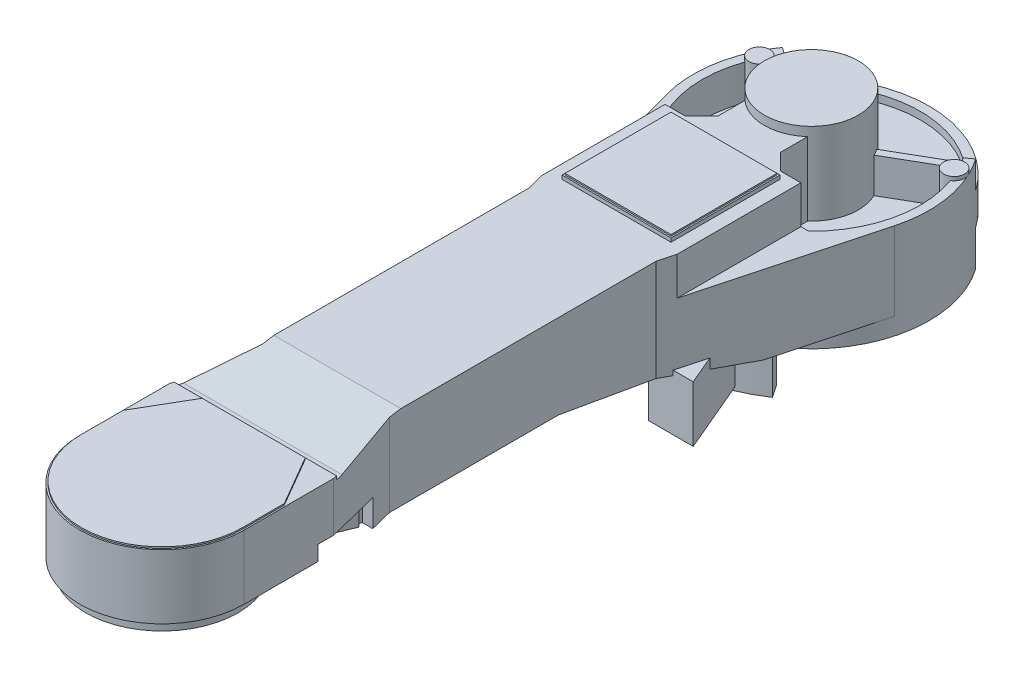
ISO-10303-21;
HEADER;
FILE_DESCRIPTION(('STEP AP214'),'2;1');
FILE_NAME('part.step','',(''),(''),'','','');
FILE_SCHEMA(('AUTOMOTIVE_DESIGN { 1 0 10303 214 1 1 1 1 }'));
ENDSEC;
DATA;
#1=APPLICATION_CONTEXT('core data for automotive mechanical design processes');
#2=APPLICATION_PROTOCOL_DEFINITION('international standard','automotive_design',2000,#1);
#3=PRODUCT_CONTEXT('',#1,'mechanical');
#4=PRODUCT('Part','Part','',(#3));
#5=PRODUCT_RELATED_PRODUCT_CATEGORY('part','',(#4));
#6=PRODUCT_DEFINITION_FORMATION('','',#4);
#7=PRODUCT_DEFINITION_CONTEXT('part definition',#1,'design');
#8=PRODUCT_DEFINITION('design','',#6,#7);
#9=PRODUCT_DEFINITION_SHAPE('','',#8);
#10=(LENGTH_UNIT() NAMED_UNIT(*) SI_UNIT(.MILLI.,.METRE.));
#11=(NAMED_UNIT(*) PLANE_ANGLE_UNIT() SI_UNIT($,.RADIAN.));
#12=(NAMED_UNIT(*) SI_UNIT($,.STERADIAN.) SOLID_ANGLE_UNIT());
#13=UNCERTAINTY_MEASURE_WITH_UNIT(LENGTH_MEASURE(1.E-05),#10,'distance_accuracy_value','');
#14=(GEOMETRIC_REPRESENTATION_CONTEXT(3) GLOBAL_UNCERTAINTY_ASSIGNED_CONTEXT((#13)) GLOBAL_UNIT_ASSIGNED_CONTEXT((#10,
#11,#12)) REPRESENTATION_CONTEXT('',''));
#15=CARTESIAN_POINT('',(0.,0.,0.));
#16=DIRECTION('',(0.,0.,1.));
#17=DIRECTION('',(1.,0.,0.));
#18=AXIS2_PLACEMENT_3D('',#15,#16,#17);
#19=CARTESIAN_POINT('',(206.637147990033,165.5,1298.26582918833));
#20=DIRECTION('',(0.923879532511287,0.,0.38268343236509));
#21=DIRECTION('',(0.38268343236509,0.,-0.923879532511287));
#22=AXIS2_PLACEMENT_3D('',#19,#20,#21);
#23=PLANE('',#22);
#24=DIRECTION('',(-0.38268343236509,0.,0.923879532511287));
#25=VECTOR('',#24,1.);
#26=CARTESIAN_POINT('',(206.637147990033,129.5,1298.26582918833));
#27=LINE('',#26,#25);
#28=CARTESIAN_POINT('',(228.700576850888,129.5,1245.));
#29=VERTEX_POINT('',#28);
#30=CARTESIAN_POINT('',(206.637147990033,129.5,1298.26582918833));
#31=VERTEX_POINT('',#30);
#32=EDGE_CURVE('E4016',#29,#31,#27,.T.);
#33=ORIENTED_EDGE('',*,*,#32,.F.);
#34=DIRECTION('',(0.,-1.,0.));
#35=VECTOR('',#34,1.);
#36=CARTESIAN_POINT('',(228.700576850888,165.5,1245.));
#37=LINE('',#36,#35);
#38=CARTESIAN_POINT('',(228.700576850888,165.5,1245.));
#39=VERTEX_POINT('',#38);
#40=EDGE_CURVE('E4032',#39,#29,#37,.T.);
#41=ORIENTED_EDGE('',*,*,#40,.F.);
#42=DIRECTION('',(-0.38268343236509,0.,0.923879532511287));
#43=VECTOR('',#42,1.);
#44=CARTESIAN_POINT('',(206.637147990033,165.5,1298.26582918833));
#45=LINE('',#44,#43);
#46=CARTESIAN_POINT('',(206.637147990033,165.5,1298.26582918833));
#47=VERTEX_POINT('',#46);
#48=EDGE_CURVE('E4026',#39,#47,#45,.T.);
#49=ORIENTED_EDGE('',*,*,#48,.T.);
#50=DIRECTION('',(0.,-1.,0.));
#51=VECTOR('',#50,1.);
#52=CARTESIAN_POINT('',(206.637147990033,165.5,1298.26582918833));
#53=LINE('',#52,#51);
#54=EDGE_CURVE('E4030',#47,#31,#53,.T.);
#55=ORIENTED_EDGE('',*,*,#54,.T.);
#56=EDGE_LOOP('',(#33,#41,#49,#55));
#57=FACE_BOUND('',#56,.T.);
#58=DIRECTION('',(0.,1.,0.));
#59=VECTOR('',#58,1.);
#60=CARTESIAN_POINT('',(225.508655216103,156.5,1252.70598050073));
#61=LINE('',#60,#59);
#62=CARTESIAN_POINT('',(225.508655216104,156.5,1252.70598050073));
#63=VERTEX_POINT('',#62);
#64=CARTESIAN_POINT('',(225.508655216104,134.5,1252.70598050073));
#65=VERTEX_POINT('',#64);
#66=EDGE_CURVE('E1026',#63,#65,#61,.F.);
#67=ORIENTED_EDGE('',*,*,#66,.T.);
#68=DIRECTION('',(0.38268343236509,0.,-0.923879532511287));
#69=VECTOR('',#68,1.);
#70=CARTESIAN_POINT('',(224.743288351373,134.5,1254.55373956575));
#71=LINE('',#70,#69);
#72=CARTESIAN_POINT('',(210.966684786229,134.5,1287.81340273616));
#73=VERTEX_POINT('',#72);
#74=EDGE_CURVE('E1010',#73,#65,#71,.T.);
#75=ORIENTED_EDGE('',*,*,#74,.F.);
#76=DIRECTION('',(0.,-1.,0.));
#77=VECTOR('',#76,1.);
#78=CARTESIAN_POINT('',(210.966684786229,156.5,1287.81340273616));
#79=LINE('',#78,#77);
#80=CARTESIAN_POINT('',(210.966684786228,156.5,1287.81340273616));
#81=VERTEX_POINT('',#80);
#82=EDGE_CURVE('E1007',#81,#73,#79,.T.);
#83=ORIENTED_EDGE('',*,*,#82,.F.);
#84=DIRECTION('',(-0.38268343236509,0.,0.923879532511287));
#85=VECTOR('',#84,1.);
#86=CARTESIAN_POINT('',(224.743288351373,156.5,1254.55373956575));
#87=LINE('',#86,#85);
#88=EDGE_CURVE('E994',#63,#81,#87,.T.);
#89=ORIENTED_EDGE('',*,*,#88,.F.);
#90=EDGE_LOOP('',(#67,#75,#83,#89));
#91=FACE_BOUND('',#90,.T.);
#92=ADVANCED_FACE('F17',(#57,#91),#23,.T.);
#93=CARTESIAN_POINT('',(79.,249.5,824.));
#94=DIRECTION('',(0.,0.,-1.));
#95=DIRECTION('',(1.,0.,0.));
#96=AXIS2_PLACEMENT_3D('',#93,#94,#95);
#97=PLANE('',#96);
#98=DIRECTION('',(1.,0.,0.));
#99=VECTOR('',#98,1.);
#100=CARTESIAN_POINT('',(79.,247.5,824.));
#101=LINE('',#100,#99);
#102=CARTESIAN_POINT('',(79.,247.5,824.));
#103=VERTEX_POINT('',#102);
#104=CARTESIAN_POINT('',(221.,247.5,824.));
#105=VERTEX_POINT('',#104);
#106=EDGE_CURVE('E40',#103,#105,#101,.T.);
#107=ORIENTED_EDGE('',*,*,#106,.T.);
#108=DIRECTION('',(0.,1.,0.));
#109=VECTOR('',#108,1.);
#110=CARTESIAN_POINT('',(221.,-952.799884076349,824.));
#111=LINE('',#110,#109);
#112=CARTESIAN_POINT('',(221.,249.5,824.));
#113=VERTEX_POINT('',#112);
#114=EDGE_CURVE('E666',#105,#113,#111,.T.);
#115=ORIENTED_EDGE('',*,*,#114,.T.);
#116=DIRECTION('',(1.,0.,0.));
#117=VECTOR('',#116,1.);
#118=CARTESIAN_POINT('',(79.,249.5,824.));
#119=LINE('',#118,#117);
#120=CARTESIAN_POINT('',(79.,249.5,824.));
#121=VERTEX_POINT('',#120);
#122=EDGE_CURVE('E21',#121,#113,#119,.T.);
#123=ORIENTED_EDGE('',*,*,#122,.F.);
#124=DIRECTION('',(0.,1.,0.));
#125=VECTOR('',#124,1.);
#126=CARTESIAN_POINT('',(79.,-952.799884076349,824.));
#127=LINE('',#126,#125);
#128=EDGE_CURVE('E649',#103,#121,#127,.T.);
#129=ORIENTED_EDGE('',*,*,#128,.F.);
#130=EDGE_LOOP('',(#107,#115,#123,#129));
#131=FACE_BOUND('',#130,.T.);
#132=ADVANCED_FACE('F19',(#131),#97,.F.);
#133=CARTESIAN_POINT('',(221.,249.5,824.));
#134=DIRECTION('',(-1.,0.,0.));
#135=DIRECTION('',(0.,0.,-1.));
#136=AXIS2_PLACEMENT_3D('',#133,#134,#135);
#137=PLANE('',#136);
#138=DIRECTION('',(0.,0.,-1.));
#139=VECTOR('',#138,1.);
#140=CARTESIAN_POINT('',(221.,247.5,824.));
#141=LINE('',#140,#139);
#142=CARTESIAN_POINT('',(221.,247.5,682.));
#143=VERTEX_POINT('',#142);
#144=EDGE_CURVE('E1088',#105,#143,#141,.T.);
#145=ORIENTED_EDGE('',*,*,#144,.T.);
#146=DIRECTION('',(0.,1.,0.));
#147=VECTOR('',#146,1.);
#148=CARTESIAN_POINT('',(221.,-952.799884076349,682.));
#149=LINE('',#148,#147);
#150=CARTESIAN_POINT('',(221.,249.5,682.));
#151=VERTEX_POINT('',#150);
#152=EDGE_CURVE('E664',#143,#151,#149,.T.);
#153=ORIENTED_EDGE('',*,*,#152,.T.);
#154=DIRECTION('',(0.,0.,-1.));
#155=VECTOR('',#154,1.);
#156=CARTESIAN_POINT('',(221.,249.5,824.));
#157=LINE('',#156,#155);
#158=EDGE_CURVE('E655',#113,#151,#157,.T.);
#159=ORIENTED_EDGE('',*,*,#158,.F.);
#160=ORIENTED_EDGE('',*,*,#114,.F.);
#161=EDGE_LOOP('',(#145,#153,#159,#160));
#162=FACE_BOUND('',#161,.T.);
#163=ADVANCED_FACE('F1099',(#162),#137,.F.);
#164=CARTESIAN_POINT('',(221.,249.5,682.));
#165=DIRECTION('',(0.,0.,1.));
#166=DIRECTION('',(-1.,0.,0.));
#167=AXIS2_PLACEMENT_3D('',#164,#165,#166);
#168=PLANE('',#167);
#169=DIRECTION('',(-1.,0.,0.));
#170=VECTOR('',#169,1.);
#171=CARTESIAN_POINT('',(221.,249.5,682.));
#172=LINE('',#171,#170);
#173=CARTESIAN_POINT('',(79.,249.5,682.));
#174=VERTEX_POINT('',#173);
#175=EDGE_CURVE('E26',#151,#174,#172,.T.);
#176=ORIENTED_EDGE('',*,*,#175,.F.);
#177=ORIENTED_EDGE('',*,*,#152,.F.);
#178=DIRECTION('',(-1.,0.,0.));
#179=VECTOR('',#178,1.);
#180=CARTESIAN_POINT('',(221.,247.5,682.));
#181=LINE('',#180,#179);
#182=CARTESIAN_POINT('',(79.,247.5,682.));
#183=VERTEX_POINT('',#182);
#184=EDGE_CURVE('E663',#143,#183,#181,.T.);
#185=ORIENTED_EDGE('',*,*,#184,.T.);
#186=DIRECTION('',(0.,1.,0.));
#187=VECTOR('',#186,1.);
#188=CARTESIAN_POINT('',(79.,-952.799884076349,682.));
#189=LINE('',#188,#187);
#190=EDGE_CURVE('E648',#183,#174,#189,.T.);
#191=ORIENTED_EDGE('',*,*,#190,.T.);
#192=EDGE_LOOP('',(#176,#177,#185,#191));
#193=FACE_BOUND('',#192,.T.);
#194=ADVANCED_FACE('F661',(#193),#168,.F.);
#195=CARTESIAN_POINT('',(79.,249.5,682.));
#196=DIRECTION('',(1.,0.,0.));
#197=DIRECTION('',(0.,0.,1.));
#198=AXIS2_PLACEMENT_3D('',#195,#196,#197);
#199=PLANE('',#198);
#200=DIRECTION('',(0.,0.,1.));
#201=VECTOR('',#200,1.);
#202=CARTESIAN_POINT('',(79.,249.5,682.));
#203=LINE('',#202,#201);
#204=EDGE_CURVE('E11',#174,#121,#203,.T.);
#205=ORIENTED_EDGE('',*,*,#204,.F.);
#206=ORIENTED_EDGE('',*,*,#190,.F.);
#207=DIRECTION('',(0.,0.,1.));
#208=VECTOR('',#207,1.);
#209=CARTESIAN_POINT('',(79.,247.5,682.));
#210=LINE('',#209,#208);
#211=EDGE_CURVE('E33',#183,#103,#210,.T.);
#212=ORIENTED_EDGE('',*,*,#211,.T.);
#213=ORIENTED_EDGE('',*,*,#128,.T.);
#214=EDGE_LOOP('',(#205,#206,#212,#213));
#215=FACE_BOUND('',#214,.T.);
#216=ADVANCED_FACE('F646',(#215),#199,.F.);
#217=CARTESIAN_POINT('',(221.,249.5,824.));
#218=DIRECTION('',(0.,1.,0.));
#219=DIRECTION('',(1.,0.,0.));
#220=AXIS2_PLACEMENT_3D('',#217,#218,#219);
#221=PLANE('',#220);
#222=ORIENTED_EDGE('',*,*,#158,.T.);
#223=ORIENTED_EDGE('',*,*,#175,.T.);
#224=ORIENTED_EDGE('',*,*,#204,.T.);
#225=ORIENTED_EDGE('',*,*,#122,.T.);
#226=EDGE_LOOP('',(#222,#223,#224,#225));
#227=FACE_BOUND('',#226,.T.);
#228=ADVANCED_FACE('F653',(#227),#221,.T.);
#229=CARTESIAN_POINT('',(150.,145.5,1424.25));
#230=DIRECTION('',(0.,-1.,0.));
#231=DIRECTION('',(1.,0.,0.));
#232=AXIS2_PLACEMENT_3D('',#229,#230,#231);
#233=PLANE('',#232);
#234=CARTESIAN_POINT('',(88.5987988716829,145.5,1470.45));
#235=DIRECTION('',(0.,-1.,0.));
#236=DIRECTION('',(1.,0.,0.));
#237=AXIS2_PLACEMENT_3D('',#234,#235,#236);
#238=CIRCLE('',#237,18.);
#239=CARTESIAN_POINT('',(92.7427802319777,145.5,1452.93351009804));
#240=VERTEX_POINT('',#239);
#241=CARTESIAN_POINT('',(105.840514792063,145.5,1475.61945182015));
#242=VERTEX_POINT('',#241);
#243=EDGE_CURVE('E677',#240,#242,#238,.T.);
#244=ORIENTED_EDGE('',*,*,#243,.F.);
#245=CARTESIAN_POINT('',(150.,145.5,1435.));
#246=DIRECTION('',(0.,-1.,0.));
#247=DIRECTION('',(1.,0.,0.));
#248=AXIS2_PLACEMENT_3D('',#245,#246,#247);
#249=CIRCLE('',#248,60.);
#250=EDGE_CURVE('E680',#240,#242,#249,.T.);
#251=ORIENTED_EDGE('',*,*,#250,.T.);
#252=EDGE_LOOP('',(#244,#251));
#253=FACE_BOUND('',#252,.T.);
#254=ADVANCED_FACE('F1333',(#253),#233,.T.);
#255=CARTESIAN_POINT('',(150.,133.5,1435.));
#256=DIRECTION('',(0.,1.,0.));
#257=DIRECTION('',(-1.,0.,0.));
#258=AXIS2_PLACEMENT_3D('',#255,#256,#257);
#259=CONICAL_SURFACE('',#258,126.5,0.785398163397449);
#260=DIRECTION('',(-0.353553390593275,0.707106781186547,-0.612372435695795));
#261=VECTOR('',#260,1.);
#262=CARTESIAN_POINT('',(150.,6.99999999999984,1435.));
#263=LINE('',#262,#261);
#264=CARTESIAN_POINT('',(84.25,138.5,1321.11765940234));
#265=VERTEX_POINT('',#264);
#266=CARTESIAN_POINT('',(86.75,133.5,1325.44778642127));
#267=VERTEX_POINT('',#266);
#268=EDGE_CURVE('E968',#265,#267,#263,.F.);
#269=ORIENTED_EDGE('',*,*,#268,.F.);
#270=CARTESIAN_POINT('',(150.,138.5,1435.));
#271=DIRECTION('',(0.,1.,0.));
#272=DIRECTION('',(-1.,0.,0.));
#273=AXIS2_PLACEMENT_3D('',#270,#271,#272);
#274=CIRCLE('',#273,131.5);
#275=CARTESIAN_POINT('',(46.3765859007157,138.5,1354.04051599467));
#276=VERTEX_POINT('',#275);
#277=EDGE_CURVE('E719',#265,#276,#274,.T.);
#278=ORIENTED_EDGE('',*,*,#277,.T.);
#279=DIRECTION('',(0.557207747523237,-0.707106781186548,0.435338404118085));
#280=VECTOR('',#279,1.);
#281=CARTESIAN_POINT('',(150.,6.99999999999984,1435.));
#282=LINE('',#281,#280);
#283=CARTESIAN_POINT('',(50.3166396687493,133.5,1357.1188233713));
#284=VERTEX_POINT('',#283);
#285=EDGE_CURVE('E965',#284,#276,#282,.F.);
#286=ORIENTED_EDGE('',*,*,#285,.F.);
#287=CARTESIAN_POINT('',(150.,133.5,1435.));
#288=DIRECTION('',(0.,1.,0.));
#289=DIRECTION('',(-1.,0.,0.));
#290=AXIS2_PLACEMENT_3D('',#287,#288,#289);
#291=CIRCLE('',#290,126.5);
#292=EDGE_CURVE('E962',#267,#284,#291,.T.);
#293=ORIENTED_EDGE('',*,*,#292,.F.);
#294=EDGE_LOOP('',(#269,#278,#286,#293));
#295=FACE_BOUND('',#294,.T.);
#296=ADVANCED_FACE('F1358',(#295),#259,.F.);
#297=CARTESIAN_POINT('',(150.,126.,1435.));
#298=DIRECTION('',(0.,1.,0.));
#299=DIRECTION('',(-1.,0.,0.));
#300=AXIS2_PLACEMENT_3D('',#297,#298,#299);
#301=PLANE('',#300);
#302=CARTESIAN_POINT('',(150.,126.,1435.));
#303=DIRECTION('',(0.,1.,0.));
#304=DIRECTION('',(1.,0.,0.));
#305=AXIS2_PLACEMENT_3D('',#302,#303,#304);
#306=CIRCLE('',#305,126.5);
#307=CARTESIAN_POINT('',(86.75,126.,1325.44778642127));
#308=VERTEX_POINT('',#307);
#309=CARTESIAN_POINT('',(50.3166396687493,126.,1357.1188233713));
#310=VERTEX_POINT('',#309);
#311=EDGE_CURVE('E687',#308,#310,#306,.T.);
#312=ORIENTED_EDGE('',*,*,#311,.T.);
#313=DIRECTION('',(-0.788010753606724,0.,-0.615661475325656));
#314=VECTOR('',#313,1.);
#315=CARTESIAN_POINT('',(50.3166396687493,126.,1357.1188233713));
#316=LINE('',#315,#314);
#317=CARTESIAN_POINT('',(40.,126.,1349.05858108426));
#318=VERTEX_POINT('',#317);
#319=EDGE_CURVE('E688',#310,#318,#316,.T.);
#320=ORIENTED_EDGE('',*,*,#319,.T.);
#321=DIRECTION('',(0.,0.,-1.));
#322=VECTOR('',#321,1.);
#323=CARTESIAN_POINT('',(40.,126.,1349.05858108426));
#324=LINE('',#323,#322);
#325=CARTESIAN_POINT('',(40.,126.,1345.99297780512));
#326=VERTEX_POINT('',#325);
#327=EDGE_CURVE('E692',#318,#326,#324,.T.);
#328=ORIENTED_EDGE('',*,*,#327,.T.);
#329=CARTESIAN_POINT('',(150.,126.,1435.));
#330=DIRECTION('',(0.,-1.,0.));
#331=DIRECTION('',(1.,0.,0.));
#332=AXIS2_PLACEMENT_3D('',#329,#330,#331);
#333=CIRCLE('',#332,141.5);
#334=CARTESIAN_POINT('',(79.25,126.,1312.4574053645));
#335=VERTEX_POINT('',#334);
#336=EDGE_CURVE('E696',#326,#335,#333,.T.);
#337=ORIENTED_EDGE('',*,*,#336,.T.);
#338=DIRECTION('',(0.5,0.,0.866025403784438));
#339=VECTOR('',#338,1.);
#340=CARTESIAN_POINT('',(86.75,126.,1325.44778642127));
#341=LINE('',#340,#339);
#342=EDGE_CURVE('E700',#335,#308,#341,.T.);
#343=ORIENTED_EDGE('',*,*,#342,.T.);
#344=EDGE_LOOP('',(#312,#320,#328,#337,#343));
#345=FACE_BOUND('',#344,.T.);
#346=ADVANCED_FACE('F1367',(#345),#301,.F.);
#347=CARTESIAN_POINT('',(86.75,138.5,1325.44778642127));
#348=DIRECTION('',(0.866025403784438,0.,-0.5));
#349=DIRECTION('',(-0.5,0.,-0.866025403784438));
#350=AXIS2_PLACEMENT_3D('',#347,#348,#349);
#351=PLANE('',#350);
#352=DIRECTION('',(0.,1.,0.));
#353=VECTOR('',#352,1.);
#354=CARTESIAN_POINT('',(84.25,129.5,1321.11765940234));
#355=LINE('',#354,#353);
#356=CARTESIAN_POINT('',(84.25,131.5,1321.11765940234));
#357=VERTEX_POINT('',#356);
#358=EDGE_CURVE('E717',#357,#265,#355,.T.);
#359=ORIENTED_EDGE('',*,*,#358,.T.);
#360=ORIENTED_EDGE('',*,*,#268,.T.);
#361=DIRECTION('',(0.,-1.,0.));
#362=VECTOR('',#361,1.);
#363=CARTESIAN_POINT('',(86.75,138.5,1325.44778642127));
#364=LINE('',#363,#362);
#365=EDGE_CURVE('E704',#267,#308,#364,.T.);
#366=ORIENTED_EDGE('',*,*,#365,.T.);
#367=ORIENTED_EDGE('',*,*,#342,.F.);
#368=DIRECTION('',(0.,-1.,0.));
#369=VECTOR('',#368,1.);
#370=CARTESIAN_POINT('',(79.25,138.5,1312.4574053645));
#371=LINE('',#370,#369);
#372=CARTESIAN_POINT('',(79.25,131.5,1312.4574053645));
#373=VERTEX_POINT('',#372);
#374=EDGE_CURVE('E709',#373,#335,#371,.T.);
#375=ORIENTED_EDGE('',*,*,#374,.F.);
#376=DIRECTION('',(-0.5,0.,-0.866025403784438));
#377=VECTOR('',#376,1.);
#378=CARTESIAN_POINT('',(150.,131.5,1435.));
#379=LINE('',#378,#377);
#380=EDGE_CURVE('E956',#357,#373,#379,.T.);
#381=ORIENTED_EDGE('',*,*,#380,.F.);
#382=EDGE_LOOP('',(#359,#360,#366,#367,#375,#381));
#383=FACE_BOUND('',#382,.T.);
#384=ADVANCED_FACE('F1375',(#383),#351,.T.);
#385=CARTESIAN_POINT('',(50.3166396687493,138.5,1357.1188233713));
#386=DIRECTION('',(-0.615661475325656,0.,0.788010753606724));
#387=DIRECTION('',(0.788010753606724,0.,0.615661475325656));
#388=AXIS2_PLACEMENT_3D('',#385,#386,#387);
#389=PLANE('',#388);
#390=DIRECTION('',(0.,-1.,0.));
#391=VECTOR('',#390,1.);
#392=CARTESIAN_POINT('',(50.3166396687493,138.5,1357.1188233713));
#393=LINE('',#392,#391);
#394=EDGE_CURVE('E715',#284,#310,#393,.T.);
#395=ORIENTED_EDGE('',*,*,#394,.F.);
#396=ORIENTED_EDGE('',*,*,#285,.T.);
#397=DIRECTION('',(0.,-1.,0.));
#398=VECTOR('',#397,1.);
#399=CARTESIAN_POINT('',(46.3765859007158,1333.79988407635,1354.04051599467));
#400=LINE('',#399,#398);
#401=CARTESIAN_POINT('',(46.3765859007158,145.5,1354.04051599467));
#402=VERTEX_POINT('',#401);
#403=EDGE_CURVE('E685',#402,#276,#400,.T.);
#404=ORIENTED_EDGE('',*,*,#403,.F.);
#405=DIRECTION('',(-0.788010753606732,0.,-0.615661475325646));
#406=VECTOR('',#405,1.);
#407=CARTESIAN_POINT('',(39.9999999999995,145.5,1349.05858108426));
#408=LINE('',#407,#406);
#409=CARTESIAN_POINT('',(39.9999999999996,145.5,1349.05858108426));
#410=VERTEX_POINT('',#409);
#411=EDGE_CURVE('E682',#402,#410,#408,.T.);
#412=ORIENTED_EDGE('',*,*,#411,.T.);
#413=DIRECTION('',(0.,-1.,0.));
#414=VECTOR('',#413,1.);
#415=CARTESIAN_POINT('',(40.,138.5,1349.05858108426));
#416=LINE('',#415,#414);
#417=EDGE_CURVE('E713',#410,#318,#416,.T.);
#418=ORIENTED_EDGE('',*,*,#417,.T.);
#419=ORIENTED_EDGE('',*,*,#319,.F.);
#420=EDGE_LOOP('',(#395,#396,#404,#412,#418,#419));
#421=FACE_BOUND('',#420,.T.);
#422=ADVANCED_FACE('F1384',(#421),#389,.T.);
#423=CARTESIAN_POINT('',(150.,138.5,1435.));
#424=DIRECTION('',(0.,-1.,0.));
#425=DIRECTION('',(1.,0.,0.));
#426=AXIS2_PLACEMENT_3D('',#423,#424,#425);
#427=CYLINDRICAL_SURFACE('',#426,126.5);
#428=ORIENTED_EDGE('',*,*,#365,.F.);
#429=ORIENTED_EDGE('',*,*,#292,.T.);
#430=ORIENTED_EDGE('',*,*,#394,.T.);
#431=ORIENTED_EDGE('',*,*,#311,.F.);
#432=EDGE_LOOP('',(#428,#429,#430,#431));
#433=FACE_BOUND('',#432,.T.);
#434=ADVANCED_FACE('F1393',(#433),#427,.F.);
#435=CARTESIAN_POINT('',(150.,138.5,1435.));
#436=DIRECTION('',(0.,-1.,0.));
#437=DIRECTION('',(1.,0.,0.));
#438=AXIS2_PLACEMENT_3D('',#435,#436,#437);
#439=CYLINDRICAL_SURFACE('',#438,141.5);
#440=CARTESIAN_POINT('',(150.,131.5,1435.));
#441=DIRECTION('',(0.,1.,0.));
#442=DIRECTION('',(-1.,0.,0.));
#443=AXIS2_PLACEMENT_3D('',#440,#441,#442);
#444=CIRCLE('',#443,141.5);
#445=CARTESIAN_POINT('',(40.,131.5,1345.99297780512));
#446=VERTEX_POINT('',#445);
#447=EDGE_CURVE('E959',#373,#446,#444,.T.);
#448=ORIENTED_EDGE('',*,*,#447,.F.);
#449=ORIENTED_EDGE('',*,*,#374,.T.);
#450=ORIENTED_EDGE('',*,*,#336,.F.);
#451=DIRECTION('',(0.,-1.,0.));
#452=VECTOR('',#451,1.);
#453=CARTESIAN_POINT('',(40.,138.5,1345.99297780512));
#454=LINE('',#453,#452);
#455=EDGE_CURVE('E711',#446,#326,#454,.T.);
#456=ORIENTED_EDGE('',*,*,#455,.F.);
#457=EDGE_LOOP('',(#448,#449,#450,#456));
#458=FACE_BOUND('',#457,.T.);
#459=ADVANCED_FACE('F1401',(#458),#439,.T.);
#460=CARTESIAN_POINT('',(150.,131.5,1435.));
#461=DIRECTION('',(0.,1.,0.));
#462=DIRECTION('',(-1.,0.,0.));
#463=AXIS2_PLACEMENT_3D('',#460,#461,#462);
#464=PLANE('',#463);
#465=ORIENTED_EDGE('',*,*,#380,.T.);
#466=ORIENTED_EDGE('',*,*,#447,.T.);
#467=DIRECTION('',(0.,0.,1.));
#468=VECTOR('',#467,1.);
#469=CARTESIAN_POINT('',(39.9999999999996,131.5,1335.98484964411));
#470=LINE('',#469,#468);
#471=CARTESIAN_POINT('',(39.9999999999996,131.5,1335.98484964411));
#472=VERTEX_POINT('',#471);
#473=EDGE_CURVE('E729',#472,#446,#470,.T.);
#474=ORIENTED_EDGE('',*,*,#473,.F.);
#475=CARTESIAN_POINT('',(150.,131.5,1435.));
#476=DIRECTION('',(0.,1.,0.));
#477=DIRECTION('',(1.,0.,0.));
#478=AXIS2_PLACEMENT_3D('',#475,#476,#477);
#479=CIRCLE('',#478,148.);
#480=CARTESIAN_POINT('',(93.3628520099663,131.5,1298.26582918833));
#481=VERTEX_POINT('',#480);
#482=EDGE_CURVE('E728',#481,#472,#479,.T.);
#483=ORIENTED_EDGE('',*,*,#482,.F.);
#484=DIRECTION('',(-0.38268343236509,0.,-0.923879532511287));
#485=VECTOR('',#484,1.);
#486=CARTESIAN_POINT('',(99.6771286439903,131.5,1313.50984147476));
#487=LINE('',#486,#485);
#488=CARTESIAN_POINT('',(99.6771286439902,131.5,1313.50984147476));
#489=VERTEX_POINT('',#488);
#490=EDGE_CURVE('E734',#489,#481,#487,.T.);
#491=ORIENTED_EDGE('',*,*,#490,.F.);
#492=CARTESIAN_POINT('',(150.,131.5,1435.));
#493=DIRECTION('',(0.,-1.,0.));
#494=DIRECTION('',(1.,0.,0.));
#495=AXIS2_PLACEMENT_3D('',#492,#493,#494);
#496=CIRCLE('',#495,131.5);
#497=EDGE_CURVE('E732',#357,#489,#496,.T.);
#498=ORIENTED_EDGE('',*,*,#497,.F.);
#499=EDGE_LOOP('',(#465,#466,#474,#483,#491,#498));
#500=FACE_BOUND('',#499,.T.);
#501=ADVANCED_FACE('F1409',(#500),#464,.F.);
#502=CARTESIAN_POINT('',(225.425301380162,131.5,1327.281506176));
#503=DIRECTION('',(0.819152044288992,0.,0.573576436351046));
#504=DIRECTION('',(0.573576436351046,0.,-0.819152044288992));
#505=AXIS2_PLACEMENT_3D('',#502,#503,#504);
#506=PLANE('',#505);
#507=DIRECTION('',(-0.573576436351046,0.,0.819152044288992));
#508=VECTOR('',#507,1.);
#509=CARTESIAN_POINT('',(225.425301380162,129.5,1327.281506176));
#510=LINE('',#509,#508);
#511=CARTESIAN_POINT('',(234.889312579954,129.5,1313.76549744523));
#512=VERTEX_POINT('',#511);
#513=CARTESIAN_POINT('',(225.425301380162,129.5,1327.281506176));
#514=VERTEX_POINT('',#513);
#515=EDGE_CURVE('E742',#512,#514,#510,.T.);
#516=ORIENTED_EDGE('',*,*,#515,.F.);
#517=DIRECTION('',(0.,-1.,0.));
#518=VECTOR('',#517,1.);
#519=CARTESIAN_POINT('',(234.889312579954,131.5,1313.76549744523));
#520=LINE('',#519,#518);
#521=CARTESIAN_POINT('',(234.889312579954,145.5,1313.76549744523));
#522=VERTEX_POINT('',#521);
#523=EDGE_CURVE('E746',#522,#512,#520,.T.);
#524=ORIENTED_EDGE('',*,*,#523,.F.);
#525=DIRECTION('',(0.573576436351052,0.,-0.819152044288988));
#526=VECTOR('',#525,1.);
#527=CARTESIAN_POINT('',(234.889312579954,145.5,1313.76549744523));
#528=LINE('',#527,#526);
#529=CARTESIAN_POINT('',(225.425301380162,145.5,1327.281506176));
#530=VERTEX_POINT('',#529);
#531=EDGE_CURVE('E725',#530,#522,#528,.T.);
#532=ORIENTED_EDGE('',*,*,#531,.F.);
#533=DIRECTION('',(0.,-1.,0.));
#534=VECTOR('',#533,1.);
#535=CARTESIAN_POINT('',(225.425301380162,131.5,1327.281506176));
#536=LINE('',#535,#534);
#537=EDGE_CURVE('E749',#530,#514,#536,.T.);
#538=ORIENTED_EDGE('',*,*,#537,.T.);
#539=EDGE_LOOP('',(#516,#524,#532,#538));
#540=FACE_BOUND('',#539,.T.);
#541=ADVANCED_FACE('F1417',(#540),#506,.T.);
#542=CARTESIAN_POINT('',(280.508321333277,196.5,504.142970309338));
#543=DIRECTION('',(0.,-1.,0.));
#544=DIRECTION('',(1.,0.,0.));
#545=AXIS2_PLACEMENT_3D('',#542,#543,#544);
#546=PLANE('',#545);
#547=CARTESIAN_POINT('',(280.508321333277,196.5,504.142970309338));
#548=DIRECTION('',(0.,-1.,0.));
#549=DIRECTION('',(-1.,0.,0.));
#550=AXIS2_PLACEMENT_3D('',#547,#548,#549);
#551=CIRCLE('',#550,14.);
#552=CARTESIAN_POINT('',(266.508321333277,196.5,504.142970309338));
#553=VERTEX_POINT('',#552);
#554=EDGE_CURVE('E752',#553,#553,#551,.T.);
#555=ORIENTED_EDGE('',*,*,#554,.F.);
#556=EDGE_LOOP('',(#555));
#557=FACE_BOUND('',#556,.T.);
#558=ADVANCED_FACE('F1425',(#557),#546,.F.);
#559=CARTESIAN_POINT('',(280.508321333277,-1005.79988407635,504.142970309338));
#560=DIRECTION('',(0.,1.,0.));
#561=DIRECTION('',(0.,0.,-1.));
#562=AXIS2_PLACEMENT_3D('',#559,#560,#561);
#563=CYLINDRICAL_SURFACE('',#562,14.);
#564=ORIENTED_EDGE('',*,*,#554,.T.);
#565=EDGE_LOOP('',(#564));
#566=FACE_BOUND('',#565,.T.);
#567=CARTESIAN_POINT('',(280.508321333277,144.5,504.142970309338));
#568=DIRECTION('',(0.,-1.,0.));
#569=DIRECTION('',(1.,0.,0.));
#570=AXIS2_PLACEMENT_3D('',#567,#568,#569);
#571=CIRCLE('',#570,14.);
#572=CARTESIAN_POINT('',(266.523147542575,144.5,503.498832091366));
#573=VERTEX_POINT('',#572);
#574=CARTESIAN_POINT('',(287.606493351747,144.5,516.210113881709));
#575=VERTEX_POINT('',#574);
#576=EDGE_CURVE('E759',#573,#575,#571,.F.);
#577=ORIENTED_EDGE('',*,*,#576,.T.);
#578=DIRECTION('',(0.,1.,0.));
#579=VECTOR('',#578,1.);
#580=CARTESIAN_POINT('',(287.606493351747,-404.649942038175,516.210113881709));
#581=LINE('',#580,#579);
#582=CARTESIAN_POINT('',(287.606493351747,191.5,516.210113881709));
#583=VERTEX_POINT('',#582);
#584=EDGE_CURVE('E762',#575,#583,#581,.T.);
#585=ORIENTED_EDGE('',*,*,#584,.T.);
#586=CARTESIAN_POINT('',(280.508321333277,191.5,504.142970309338));
#587=DIRECTION('',(0.,1.,0.));
#588=DIRECTION('',(0.,0.,-1.));
#589=AXIS2_PLACEMENT_3D('',#586,#587,#588);
#590=CIRCLE('',#589,14.);
#591=CARTESIAN_POINT('',(293.19663035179,191.5,498.226314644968));
#592=VERTEX_POINT('',#591);
#593=EDGE_CURVE('E758',#592,#583,#590,.F.);
#594=ORIENTED_EDGE('',*,*,#593,.F.);
#595=CARTESIAN_POINT('',(266.523147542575,191.5,503.498832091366));
#596=VERTEX_POINT('',#595);
#597=EDGE_CURVE('E756',#596,#592,#590,.F.);
#598=ORIENTED_EDGE('',*,*,#597,.F.);
#599=DIRECTION('',(0.,1.,0.));
#600=VECTOR('',#599,1.);
#601=CARTESIAN_POINT('',(266.523147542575,-1005.79988407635,503.498832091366));
#602=LINE('',#601,#600);
#603=EDGE_CURVE('E954',#573,#596,#602,.T.);
#604=ORIENTED_EDGE('',*,*,#603,.F.);
#605=EDGE_LOOP('',(#577,#585,#594,#598,#604));
#606=FACE_BOUND('',#605,.T.);
#607=ADVANCED_FACE('F1433',(#566,#606),#563,.T.);
#608=CARTESIAN_POINT('',(19.491678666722,196.5,504.142970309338));
#609=DIRECTION('',(0.,1.,0.));
#610=DIRECTION('',(-1.,0.,0.));
#611=AXIS2_PLACEMENT_3D('',#608,#609,#610);
#612=PLANE('',#611);
#613=CARTESIAN_POINT('',(19.491678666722,196.5,504.142970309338));
#614=DIRECTION('',(0.,1.,0.));
#615=DIRECTION('',(-1.,0.,0.));
#616=AXIS2_PLACEMENT_3D('',#613,#614,#615);
#617=CIRCLE('',#616,14.);
#618=CARTESIAN_POINT('',(5.491678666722,196.5,504.142970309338));
#619=VERTEX_POINT('',#618);
#620=EDGE_CURVE('E765',#619,#619,#617,.T.);
#621=ORIENTED_EDGE('',*,*,#620,.T.);
#622=EDGE_LOOP('',(#621));
#623=FACE_BOUND('',#622,.T.);
#624=ADVANCED_FACE('F1441',(#623),#612,.T.);
#625=CARTESIAN_POINT('',(19.4916786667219,-1005.79988407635,504.142970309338));
#626=DIRECTION('',(0.,1.,0.));
#627=DIRECTION('',(0.,0.,-1.));
#628=AXIS2_PLACEMENT_3D('',#625,#626,#627);
#629=CYLINDRICAL_SURFACE('',#628,14.);
#630=ORIENTED_EDGE('',*,*,#620,.F.);
#631=EDGE_LOOP('',(#630));
#632=FACE_BOUND('',#631,.T.);
#633=DIRECTION('',(0.,1.,0.));
#634=VECTOR('',#633,1.);
#635=CARTESIAN_POINT('',(12.3935066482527,-404.649942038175,516.210113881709));
#636=LINE('',#635,#634);
#637=CARTESIAN_POINT('',(12.3935066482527,144.5,516.210113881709));
#638=VERTEX_POINT('',#637);
#639=CARTESIAN_POINT('',(12.3935066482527,191.5,516.210113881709));
#640=VERTEX_POINT('',#639);
#641=EDGE_CURVE('E775',#638,#640,#636,.T.);
#642=ORIENTED_EDGE('',*,*,#641,.F.);
#643=CARTESIAN_POINT('',(19.491678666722,144.5,504.142970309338));
#644=DIRECTION('',(0.,-1.,0.));
#645=DIRECTION('',(1.,0.,0.));
#646=AXIS2_PLACEMENT_3D('',#643,#644,#645);
#647=CIRCLE('',#646,14.);
#648=CARTESIAN_POINT('',(33.4768524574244,144.5,503.498832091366));
#649=VERTEX_POINT('',#648);
#650=EDGE_CURVE('E772',#649,#638,#647,.T.);
#651=ORIENTED_EDGE('',*,*,#650,.F.);
#652=DIRECTION('',(0.,1.,0.));
#653=VECTOR('',#652,1.);
#654=CARTESIAN_POINT('',(33.4768524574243,-1005.79988407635,503.498832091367));
#655=LINE('',#654,#653);
#656=CARTESIAN_POINT('',(33.4768524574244,191.5,503.498832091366));
#657=VERTEX_POINT('',#656);
#658=EDGE_CURVE('E946',#657,#649,#655,.F.);
#659=ORIENTED_EDGE('',*,*,#658,.F.);
#660=CARTESIAN_POINT('',(19.491678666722,191.5,504.142970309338));
#661=DIRECTION('',(0.,1.,0.));
#662=DIRECTION('',(0.,0.,-1.));
#663=AXIS2_PLACEMENT_3D('',#660,#661,#662);
#664=CIRCLE('',#663,14.);
#665=CARTESIAN_POINT('',(6.80336964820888,191.5,498.226314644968));
#666=VERTEX_POINT('',#665);
#667=EDGE_CURVE('E769',#657,#666,#664,.T.);
#668=ORIENTED_EDGE('',*,*,#667,.T.);
#669=EDGE_CURVE('E771',#666,#640,#664,.T.);
#670=ORIENTED_EDGE('',*,*,#669,.T.);
#671=EDGE_LOOP('',(#642,#651,#659,#668,#670));
#672=FACE_BOUND('',#671,.T.);
#673=ADVANCED_FACE('F1449',(#632,#672),#629,.T.);
#674=CARTESIAN_POINT('',(201.887498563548,191.5,529.269236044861));
#675=DIRECTION('',(-0.5,0.,-0.866025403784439));
#676=DIRECTION('',(-0.866025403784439,0.,0.5));
#677=AXIS2_PLACEMENT_3D('',#674,#675,#676);
#678=PLANE('',#677);
#679=DIRECTION('',(0.866025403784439,0.,-0.5));
#680=VECTOR('',#679,1.);
#681=CARTESIAN_POINT('',(201.887498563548,144.5,529.269236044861));
#682=LINE('',#681,#680);
#683=CARTESIAN_POINT('',(201.887498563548,144.5,529.269236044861));
#684=VERTEX_POINT('',#683);
#685=CARTESIAN_POINT('',(273.865541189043,144.5,487.712693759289));
#686=VERTEX_POINT('',#685);
#687=EDGE_CURVE('E778',#684,#686,#682,.T.);
#688=ORIENTED_EDGE('',*,*,#687,.F.);
#689=DIRECTION('',(0.,-1.,0.));
#690=VECTOR('',#689,1.);
#691=CARTESIAN_POINT('',(201.887498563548,191.5,529.269236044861));
#692=LINE('',#691,#690);
#693=CARTESIAN_POINT('',(201.887498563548,191.5,529.269236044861));
#694=VERTEX_POINT('',#693);
#695=EDGE_CURVE('E791',#694,#684,#692,.T.);
#696=ORIENTED_EDGE('',*,*,#695,.F.);
#697=DIRECTION('',(0.866025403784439,0.,-0.5));
#698=VECTOR('',#697,1.);
#699=CARTESIAN_POINT('',(201.887498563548,191.5,529.269236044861));
#700=LINE('',#699,#698);
#701=CARTESIAN_POINT('',(273.865541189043,191.5,487.712693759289));
#702=VERTEX_POINT('',#701);
#703=EDGE_CURVE('E782',#694,#702,#700,.T.);
#704=ORIENTED_EDGE('',*,*,#703,.T.);
#705=DIRECTION('',(0.,-1.,0.));
#706=VECTOR('',#705,1.);
#707=CARTESIAN_POINT('',(273.865541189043,191.5,487.712693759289));
#708=LINE('',#707,#706);
#709=EDGE_CURVE('E798',#702,#686,#708,.T.);
#710=ORIENTED_EDGE('',*,*,#709,.T.);
#711=EDGE_LOOP('',(#688,#696,#704,#710));
#712=FACE_BOUND('',#711,.T.);
#713=ADVANCED_FACE('F1457',(#712),#678,.T.);
#714=CARTESIAN_POINT('',(93.112501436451,191.5,537.929490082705));
#715=DIRECTION('',(0.5,0.,-0.866025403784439));
#716=DIRECTION('',(-0.866025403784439,0.,-0.5));
#717=AXIS2_PLACEMENT_3D('',#714,#715,#716);
#718=PLANE('',#717);
#719=DIRECTION('',(0.866025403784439,0.,0.5));
#720=VECTOR('',#719,1.);
#721=CARTESIAN_POINT('',(93.112501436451,191.5,537.929490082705));
#722=LINE('',#721,#720);
#723=CARTESIAN_POINT('',(93.112501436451,191.5,537.929490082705));
#724=VERTEX_POINT('',#723);
#725=EDGE_CURVE('E808',#657,#724,#722,.T.);
#726=ORIENTED_EDGE('',*,*,#725,.F.);
#727=ORIENTED_EDGE('',*,*,#658,.T.);
#728=DIRECTION('',(0.866025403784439,0.,0.5));
#729=VECTOR('',#728,1.);
#730=CARTESIAN_POINT('',(93.112501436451,144.5,537.929490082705));
#731=LINE('',#730,#729);
#732=CARTESIAN_POINT('',(93.112501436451,144.5,537.929490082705));
#733=VERTEX_POINT('',#732);
#734=EDGE_CURVE('E801',#649,#733,#731,.T.);
#735=ORIENTED_EDGE('',*,*,#734,.T.);
#736=DIRECTION('',(0.,-1.,0.));
#737=VECTOR('',#736,1.);
#738=CARTESIAN_POINT('',(93.112501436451,191.5,537.929490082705));
#739=LINE('',#738,#737);
#740=EDGE_CURVE('E818',#724,#733,#739,.T.);
#741=ORIENTED_EDGE('',*,*,#740,.F.);
#742=EDGE_LOOP('',(#726,#727,#735,#741));
#743=FACE_BOUND('',#742,.T.);
#744=ADVANCED_FACE('F1465',(#743),#718,.F.);
#745=CARTESIAN_POINT('',(98.112501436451,191.5,529.269236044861));
#746=DIRECTION('',(-0.5,0.,0.866025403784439));
#747=DIRECTION('',(0.866025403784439,0.,0.5));
#748=AXIS2_PLACEMENT_3D('',#745,#746,#747);
#749=PLANE('',#748);
#750=DIRECTION('',(-0.866025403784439,0.,-0.5));
#751=VECTOR('',#750,1.);
#752=CARTESIAN_POINT('',(98.112501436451,144.5,529.269236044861));
#753=LINE('',#752,#751);
#754=CARTESIAN_POINT('',(98.112501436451,144.5,529.269236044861));
#755=VERTEX_POINT('',#754);
#756=CARTESIAN_POINT('',(26.1344588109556,144.5,487.712693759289));
#757=VERTEX_POINT('',#756);
#758=EDGE_CURVE('E800',#755,#757,#753,.T.);
#759=ORIENTED_EDGE('',*,*,#758,.T.);
#760=DIRECTION('',(0.,-1.,0.));
#761=VECTOR('',#760,1.);
#762=CARTESIAN_POINT('',(26.1344588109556,191.5,487.712693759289));
#763=LINE('',#762,#761);
#764=CARTESIAN_POINT('',(26.1344588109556,191.5,487.712693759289));
#765=VERTEX_POINT('',#764);
#766=EDGE_CURVE('E821',#765,#757,#763,.T.);
#767=ORIENTED_EDGE('',*,*,#766,.F.);
#768=DIRECTION('',(-0.866025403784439,0.,-0.5));
#769=VECTOR('',#768,1.);
#770=CARTESIAN_POINT('',(98.112501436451,191.5,529.269236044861));
#771=LINE('',#770,#769);
#772=CARTESIAN_POINT('',(98.112501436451,191.5,529.269236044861));
#773=VERTEX_POINT('',#772);
#774=EDGE_CURVE('E804',#773,#765,#771,.T.);
#775=ORIENTED_EDGE('',*,*,#774,.F.);
#776=DIRECTION('',(0.,-1.,0.));
#777=VECTOR('',#776,1.);
#778=CARTESIAN_POINT('',(98.112501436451,191.5,529.269236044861));
#779=LINE('',#778,#777);
#780=EDGE_CURVE('E813',#773,#755,#779,.T.);
#781=ORIENTED_EDGE('',*,*,#780,.T.);
#782=EDGE_LOOP('',(#759,#767,#775,#781));
#783=FACE_BOUND('',#782,.T.);
#784=ADVANCED_FACE('F1473',(#783),#749,.F.);
#785=CARTESIAN_POINT('',(269.596198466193,-1090.79988407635,481.257840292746));
#786=DIRECTION('',(0.57357643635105,0.,0.819152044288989));
#787=DIRECTION('',(0.819152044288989,0.,-0.57357643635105));
#788=AXIS2_PLACEMENT_3D('',#785,#786,#787);
#789=PLANE('',#788);
#790=DIRECTION('',(0.,1.,0.));
#791=VECTOR('',#790,1.);
#792=CARTESIAN_POINT('',(272.053654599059,63.5,479.537110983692));
#793=LINE('',#792,#791);
#794=CARTESIAN_POINT('',(272.053654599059,63.5,479.537110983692));
#795=VERTEX_POINT('',#794);
#796=CARTESIAN_POINT('',(272.053654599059,111.5,479.537110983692));
#797=VERTEX_POINT('',#796);
#798=EDGE_CURVE('E839',#795,#797,#793,.T.);
#799=ORIENTED_EDGE('',*,*,#798,.T.);
#800=DIRECTION('',(0.819152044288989,0.,-0.57357643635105));
#801=VECTOR('',#800,1.);
#802=CARTESIAN_POINT('',(269.596198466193,111.5,481.257840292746));
#803=LINE('',#802,#801);
#804=CARTESIAN_POINT('',(279.42602299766,111.5,474.374923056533));
#805=VERTEX_POINT('',#804);
#806=EDGE_CURVE('E828',#797,#805,#803,.T.);
#807=ORIENTED_EDGE('',*,*,#806,.T.);
#808=DIRECTION('',(0.,1.,0.));
#809=VECTOR('',#808,1.);
#810=CARTESIAN_POINT('',(279.42602299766,-1090.79988407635,474.374923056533));
#811=LINE('',#810,#809);
#812=CARTESIAN_POINT('',(279.42602299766,63.5,474.374923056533));
#813=VERTEX_POINT('',#812);
#814=EDGE_CURVE('E831',#813,#805,#811,.T.);
#815=ORIENTED_EDGE('',*,*,#814,.F.);
#816=DIRECTION('',(-0.819152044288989,0.,0.57357643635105));
#817=VECTOR('',#816,1.);
#818=CARTESIAN_POINT('',(150.,63.5,565.));
#819=LINE('',#818,#817);
#820=EDGE_CURVE('E950',#813,#795,#819,.T.);
#821=ORIENTED_EDGE('',*,*,#820,.T.);
#822=EDGE_LOOP('',(#799,#807,#815,#821));
#823=FACE_BOUND('',#822,.T.);
#824=ADVANCED_FACE('F1481',(#823),#789,.F.);
#825=CARTESIAN_POINT('',(20.5739770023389,-1090.79988407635,474.374923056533));
#826=DIRECTION('',(-0.573576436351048,0.,0.819152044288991));
#827=DIRECTION('',(0.819152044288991,0.,0.573576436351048));
#828=AXIS2_PLACEMENT_3D('',#825,#826,#827);
#829=PLANE('',#828);
#830=DIRECTION('',(0.,1.,0.));
#831=VECTOR('',#830,1.);
#832=CARTESIAN_POINT('',(27.9463454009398,63.5,479.537110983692));
#833=LINE('',#832,#831);
#834=CARTESIAN_POINT('',(27.9463454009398,111.5,479.537110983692));
#835=VERTEX_POINT('',#834);
#836=CARTESIAN_POINT('',(27.9463454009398,63.5,479.537110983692));
#837=VERTEX_POINT('',#836);
#838=EDGE_CURVE('E841',#835,#837,#833,.F.);
#839=ORIENTED_EDGE('',*,*,#838,.T.);
#840=DIRECTION('',(-0.819152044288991,0.,-0.573576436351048));
#841=VECTOR('',#840,1.);
#842=CARTESIAN_POINT('',(150.,63.5,565.));
#843=LINE('',#842,#841);
#844=CARTESIAN_POINT('',(20.5739770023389,63.5,474.374923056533));
#845=VERTEX_POINT('',#844);
#846=EDGE_CURVE('E947',#837,#845,#843,.T.);
#847=ORIENTED_EDGE('',*,*,#846,.T.);
#848=DIRECTION('',(0.,1.,0.));
#849=VECTOR('',#848,1.);
#850=CARTESIAN_POINT('',(20.5739770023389,-1090.79988407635,474.374923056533));
#851=LINE('',#850,#849);
#852=CARTESIAN_POINT('',(20.5739770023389,111.5,474.374923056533));
#853=VERTEX_POINT('',#852);
#854=EDGE_CURVE('E837',#845,#853,#851,.T.);
#855=ORIENTED_EDGE('',*,*,#854,.T.);
#856=DIRECTION('',(0.819152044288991,0.,0.573576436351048));
#857=VECTOR('',#856,1.);
#858=CARTESIAN_POINT('',(20.5739770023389,111.5,474.374923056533));
#859=LINE('',#858,#857);
#860=EDGE_CURVE('E824',#853,#835,#859,.T.);
#861=ORIENTED_EDGE('',*,*,#860,.T.);
#862=EDGE_LOOP('',(#839,#847,#855,#861));
#863=FACE_BOUND('',#862,.T.);
#864=ADVANCED_FACE('F1489',(#863),#829,.F.);
#865=CARTESIAN_POINT('',(150.,111.5,565.));
#866=DIRECTION('',(0.,1.,0.));
#867=DIRECTION('',(-1.,0.,0.));
#868=AXIS2_PLACEMENT_3D('',#865,#866,#867);
#869=PLANE('',#868);
#870=CARTESIAN_POINT('',(150.,111.5,565.));
#871=DIRECTION('',(0.,1.,0.));
#872=DIRECTION('',(-1.,0.,0.));
#873=AXIS2_PLACEMENT_3D('',#870,#871,#872);
#874=CIRCLE('',#873,149.);
#875=EDGE_CURVE('E944',#797,#835,#874,.T.);
#876=ORIENTED_EDGE('',*,*,#875,.T.);
#877=ORIENTED_EDGE('',*,*,#860,.F.);
#878=CARTESIAN_POINT('',(150.,111.5,565.));
#879=DIRECTION('',(0.,1.,0.));
#880=DIRECTION('',(-1.,0.,0.));
#881=AXIS2_PLACEMENT_3D('',#878,#879,#880);
#882=CIRCLE('',#881,158.);
#883=EDGE_CURVE('E823',#805,#853,#882,.T.);
#884=ORIENTED_EDGE('',*,*,#883,.F.);
#885=ORIENTED_EDGE('',*,*,#806,.F.);
#886=EDGE_LOOP('',(#876,#877,#884,#885));
#887=FACE_BOUND('',#886,.T.);
#888=ADVANCED_FACE('F1497',(#887),#869,.F.);
#889=CARTESIAN_POINT('',(150.,154.5,565.));
#890=DIRECTION('',(0.,-1.,0.));
#891=DIRECTION('',(0.,0.,1.));
#892=AXIS2_PLACEMENT_3D('',#889,#890,#891);
#893=PLANE('',#892);
#894=CARTESIAN_POINT('',(150.,154.5,565.));
#895=DIRECTION('',(0.,-1.,0.));
#896=DIRECTION('',(0.,0.,1.));
#897=AXIS2_PLACEMENT_3D('',#894,#895,#896);
#898=CIRCLE('',#897,146.);
#899=CARTESIAN_POINT('',(30.4038015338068,154.5,481.257840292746));
#900=VERTEX_POINT('',#899);
#901=CARTESIAN_POINT('',(269.596198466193,154.5,481.257840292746));
#902=VERTEX_POINT('',#901);
#903=EDGE_CURVE('E851',#900,#902,#898,.T.);
#904=ORIENTED_EDGE('',*,*,#903,.T.);
#905=DIRECTION('',(0.819152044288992,0.,-0.573576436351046));
#906=VECTOR('',#905,1.);
#907=CARTESIAN_POINT('',(269.596198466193,154.5,481.257840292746));
#908=LINE('',#907,#906);
#909=CARTESIAN_POINT('',(279.42602299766,154.5,474.374923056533));
#910=VERTEX_POINT('',#909);
#911=EDGE_CURVE('E852',#902,#910,#908,.T.);
#912=ORIENTED_EDGE('',*,*,#911,.T.);
#913=CARTESIAN_POINT('',(150.,154.5,565.));
#914=DIRECTION('',(0.,1.,0.));
#915=DIRECTION('',(0.,0.,1.));
#916=AXIS2_PLACEMENT_3D('',#913,#914,#915);
#917=CIRCLE('',#916,158.);
#918=CARTESIAN_POINT('',(20.5739770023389,154.5,474.374923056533));
#919=VERTEX_POINT('',#918);
#920=EDGE_CURVE('E855',#910,#919,#917,.T.);
#921=ORIENTED_EDGE('',*,*,#920,.T.);
#922=DIRECTION('',(0.819152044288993,0.,0.573576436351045));
#923=VECTOR('',#922,1.);
#924=CARTESIAN_POINT('',(30.4038015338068,154.5,481.257840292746));
#925=LINE('',#924,#923);
#926=EDGE_CURVE('E857',#919,#900,#925,.T.);
#927=ORIENTED_EDGE('',*,*,#926,.T.);
#928=EDGE_LOOP('',(#904,#912,#921,#927));
#929=FACE_BOUND('',#928,.T.);
#930=ADVANCED_FACE('F1505',(#929),#893,.F.);
#931=CARTESIAN_POINT('',(30.4038015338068,154.5,481.257840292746));
#932=DIRECTION('',(-0.573576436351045,0.,0.819152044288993));
#933=DIRECTION('',(0.819152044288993,0.,0.573576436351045));
#934=AXIS2_PLACEMENT_3D('',#931,#932,#933);
#935=PLANE('',#934);
#936=DIRECTION('',(0.819152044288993,0.,0.573576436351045));
#937=VECTOR('',#936,1.);
#938=CARTESIAN_POINT('',(30.4038015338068,191.5,481.257840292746));
#939=LINE('',#938,#937);
#940=CARTESIAN_POINT('',(20.5739770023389,191.5,474.374923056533));
#941=VERTEX_POINT('',#940);
#942=CARTESIAN_POINT('',(30.4038015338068,191.5,481.257840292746));
#943=VERTEX_POINT('',#942);
#944=EDGE_CURVE('E847',#941,#943,#939,.T.);
#945=ORIENTED_EDGE('',*,*,#944,.T.);
#946=DIRECTION('',(0.,1.,0.));
#947=VECTOR('',#946,1.);
#948=CARTESIAN_POINT('',(30.4038015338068,154.5,481.257840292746));
#949=LINE('',#948,#947);
#950=EDGE_CURVE('E860',#900,#943,#949,.T.);
#951=ORIENTED_EDGE('',*,*,#950,.F.);
#952=ORIENTED_EDGE('',*,*,#926,.F.);
#953=DIRECTION('',(0.,1.,0.));
#954=VECTOR('',#953,1.);
#955=CARTESIAN_POINT('',(20.5739770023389,154.5,474.374923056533));
#956=LINE('',#955,#954);
#957=EDGE_CURVE('E865',#919,#941,#956,.T.);
#958=ORIENTED_EDGE('',*,*,#957,.T.);
#959=EDGE_LOOP('',(#945,#951,#952,#958));
#960=FACE_BOUND('',#959,.T.);
#961=ADVANCED_FACE('F1513',(#960),#935,.F.);
#962=CARTESIAN_POINT('',(269.596198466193,154.5,481.257840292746));
#963=DIRECTION('',(0.573576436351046,0.,0.819152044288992));
#964=DIRECTION('',(0.819152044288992,0.,-0.573576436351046));
#965=AXIS2_PLACEMENT_3D('',#962,#963,#964);
#966=PLANE('',#965);
#967=DIRECTION('',(0.819152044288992,0.,-0.573576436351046));
#968=VECTOR('',#967,1.);
#969=CARTESIAN_POINT('',(269.596198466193,191.5,481.257840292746));
#970=LINE('',#969,#968);
#971=CARTESIAN_POINT('',(269.596198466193,191.5,481.257840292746));
#972=VERTEX_POINT('',#971);
#973=CARTESIAN_POINT('',(279.42602299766,191.5,474.374923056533));
#974=VERTEX_POINT('',#973);
#975=EDGE_CURVE('E844',#972,#974,#970,.T.);
#976=ORIENTED_EDGE('',*,*,#975,.T.);
#977=DIRECTION('',(0.,1.,0.));
#978=VECTOR('',#977,1.);
#979=CARTESIAN_POINT('',(279.42602299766,154.5,474.374923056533));
#980=LINE('',#979,#978);
#981=EDGE_CURVE('E868',#910,#974,#980,.T.);
#982=ORIENTED_EDGE('',*,*,#981,.F.);
#983=ORIENTED_EDGE('',*,*,#911,.F.);
#984=DIRECTION('',(0.,1.,0.));
#985=VECTOR('',#984,1.);
#986=CARTESIAN_POINT('',(269.596198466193,154.5,481.257840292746));
#987=LINE('',#986,#985);
#988=EDGE_CURVE('E871',#902,#972,#987,.T.);
#989=ORIENTED_EDGE('',*,*,#988,.T.);
#990=EDGE_LOOP('',(#976,#982,#983,#989));
#991=FACE_BOUND('',#990,.T.);
#992=ADVANCED_FACE('F1521',(#991),#966,.F.);
#993=CARTESIAN_POINT('',(239.887608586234,109.5,840.));
#994=DIRECTION('',(0.,-1.,0.));
#995=DIRECTION('',(0.,0.,1.));
#996=AXIS2_PLACEMENT_3D('',#993,#994,#995);
#997=PLANE('',#996);
#998=DIRECTION('',(-1.,0.,0.));
#999=VECTOR('',#998,1.);
#1000=CARTESIAN_POINT('',(239.887608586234,109.5,840.));
#1001=LINE('',#1000,#999);
#1002=CARTESIAN_POINT('',(266.730574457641,109.5,840.));
#1003=VERTEX_POINT('',#1002);
#1004=CARTESIAN_POINT('',(239.887608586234,109.5,840.));
#1005=VERTEX_POINT('',#1004);
#1006=EDGE_CURVE('E873',#1003,#1005,#1001,.T.);
#1007=ORIENTED_EDGE('',*,*,#1006,.F.);
#1008=DIRECTION('',(0.390731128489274,0.,0.92050485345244));
#1009=VECTOR('',#1008,1.);
#1010=CARTESIAN_POINT('',(266.730574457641,109.5,840.));
#1011=LINE('',#1010,#1009);
#1012=CARTESIAN_POINT('',(250.275103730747,109.5,801.233340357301));
#1013=VERTEX_POINT('',#1012);
#1014=EDGE_CURVE('E876',#1013,#1003,#1011,.T.);
#1015=ORIENTED_EDGE('',*,*,#1014,.F.);
#1016=DIRECTION('',(0.258819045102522,0.,-0.965925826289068));
#1017=VECTOR('',#1016,1.);
#1018=CARTESIAN_POINT('',(239.887608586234,109.5,840.));
#1019=LINE('',#1018,#1017);
#1020=EDGE_CURVE('E874',#1005,#1013,#1019,.T.);
#1021=ORIENTED_EDGE('',*,*,#1020,.F.);
#1022=EDGE_LOOP('',(#1007,#1015,#1021));
#1023=FACE_BOUND('',#1022,.T.);
#1024=ADVANCED_FACE('F1529',(#1023),#997,.F.);
#1025=CARTESIAN_POINT('',(150.,29.4999999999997,565.));
#1026=DIRECTION('',(0.,-1.,0.));
#1027=DIRECTION('',(0.,0.,1.));
#1028=AXIS2_PLACEMENT_3D('',#1025,#1026,#1027);
#1029=PLANE('',#1028);
#1030=DIRECTION('',(-0.559192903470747,0.,-0.829037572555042));
#1031=VECTOR('',#1030,1.);
#1032=CARTESIAN_POINT('',(257.924230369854,29.4999999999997,725.004251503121));
#1033=LINE('',#1032,#1031);
#1034=CARTESIAN_POINT('',(257.924230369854,29.4999999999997,725.004251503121));
#1035=VERTEX_POINT('',#1034);
#1036=CARTESIAN_POINT('',(246.740372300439,29.4999999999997,708.423500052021));
#1037=VERTEX_POINT('',#1036);
#1038=EDGE_CURVE('E912',#1035,#1037,#1033,.T.);
#1039=ORIENTED_EDGE('',*,*,#1038,.F.);
#1040=CARTESIAN_POINT('',(150.,29.4999999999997,565.));
#1041=DIRECTION('',(0.,1.,0.));
#1042=DIRECTION('',(1.,0.,0.));
#1043=AXIS2_PLACEMENT_3D('',#1040,#1041,#1042);
#1044=CIRCLE('',#1043,193.);
#1045=CARTESIAN_POINT('',(206.427739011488,29.5,749.566817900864));
#1046=VERTEX_POINT('',#1045);
#1047=EDGE_CURVE('E941',#1046,#1035,#1044,.T.);
#1048=ORIENTED_EDGE('',*,*,#1047,.F.);
#1049=DIRECTION('',(0.292371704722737,0.,0.956304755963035));
#1050=VECTOR('',#1049,1.);
#1051=CARTESIAN_POINT('',(200.580304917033,29.5,730.440722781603));
#1052=LINE('',#1051,#1050);
#1053=CARTESIAN_POINT('',(200.580304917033,29.5,730.440722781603));
#1054=VERTEX_POINT('',#1053);
#1055=EDGE_CURVE('E4573',#1054,#1046,#1052,.T.);
#1056=ORIENTED_EDGE('',*,*,#1055,.F.);
#1057=CARTESIAN_POINT('',(150.,29.4999999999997,565.));
#1058=DIRECTION('',(0.,-1.,0.));
#1059=DIRECTION('',(1.,0.,0.));
#1060=AXIS2_PLACEMENT_3D('',#1057,#1058,#1059);
#1061=CIRCLE('',#1060,173.);
#1062=EDGE_CURVE('E906',#1037,#1054,#1061,.T.);
#1063=ORIENTED_EDGE('',*,*,#1062,.F.);
#1064=EDGE_LOOP('',(#1039,#1048,#1056,#1063));
#1065=FACE_BOUND('',#1064,.T.);
#1066=ADVANCED_FACE('F1538',(#1065),#1029,.T.);
#1067=CARTESIAN_POINT('',(207.,1235.87421314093,840.));
#1068=DIRECTION('',(1.,0.,0.));
#1069=DIRECTION('',(0.,0.,-1.));
#1070=AXIS2_PLACEMENT_3D('',#1067,#1068,#1069);
#1071=PLANE('',#1070);
#1072=DIRECTION('',(0.,-1.,0.));
#1073=VECTOR('',#1072,1.);
#1074=CARTESIAN_POINT('',(207.,1235.87421314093,840.));
#1075=LINE('',#1074,#1073);
#1076=CARTESIAN_POINT('',(207.,103.251063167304,840.));
#1077=VERTEX_POINT('',#1076);
#1078=CARTESIAN_POINT('',(207.,34.5,840.));
#1079=VERTEX_POINT('',#1078);
#1080=EDGE_CURVE('E929',#1077,#1079,#1075,.T.);
#1081=ORIENTED_EDGE('',*,*,#1080,.F.);
#1082=DIRECTION('',(0.,-0.17364817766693,-0.984807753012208));
#1083=VECTOR('',#1082,1.);
#1084=CARTESIAN_POINT('',(207.,86.5,745.));
#1085=LINE('',#1084,#1083);
#1086=CARTESIAN_POINT('',(207.,87.635298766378,751.438599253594));
#1087=VERTEX_POINT('',#1086);
#1088=EDGE_CURVE('E4556',#1077,#1087,#1085,.T.);
#1089=ORIENTED_EDGE('',*,*,#1088,.T.);
#1090=DIRECTION('',(0.,-1.,0.));
#1091=VECTOR('',#1090,1.);
#1092=CARTESIAN_POINT('',(207.,1235.87421314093,751.438599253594));
#1093=LINE('',#1092,#1091);
#1094=CARTESIAN_POINT('',(207.,34.4999999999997,751.438599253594));
#1095=VERTEX_POINT('',#1094);
#1096=EDGE_CURVE('E4454',#1087,#1095,#1093,.T.);
#1097=ORIENTED_EDGE('',*,*,#1096,.T.);
#1098=DIRECTION('',(0.,0.,1.));
#1099=VECTOR('',#1098,1.);
#1100=CARTESIAN_POINT('',(207.,34.5,840.));
#1101=LINE('',#1100,#1099);
#1102=EDGE_CURVE('E916',#1095,#1079,#1101,.T.);
#1103=ORIENTED_EDGE('',*,*,#1102,.T.);
#1104=EDGE_LOOP('',(#1081,#1089,#1097,#1103));
#1105=FACE_BOUND('',#1104,.T.);
#1106=ADVANCED_FACE('F1546',(#1105),#1071,.F.);
#1107=CARTESIAN_POINT('',(207.,1235.87421314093,840.));
#1108=DIRECTION('',(0.,0.,-1.));
#1109=DIRECTION('',(0.,-1.,0.));
#1110=AXIS2_PLACEMENT_3D('',#1107,#1108,#1109);
#1111=PLANE('',#1110);
#1112=DIRECTION('',(1.,0.,0.));
#1113=VECTOR('',#1112,1.);
#1114=CARTESIAN_POINT('',(207.,34.5,840.));
#1115=LINE('',#1114,#1113);
#1116=CARTESIAN_POINT('',(266.730574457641,34.5,840.));
#1117=VERTEX_POINT('',#1116);
#1118=EDGE_CURVE('E937',#1079,#1117,#1115,.T.);
#1119=ORIENTED_EDGE('',*,*,#1118,.T.);
#1120=DIRECTION('',(0.,-1.,0.));
#1121=VECTOR('',#1120,1.);
#1122=CARTESIAN_POINT('',(266.730574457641,109.5,840.));
#1123=LINE('',#1122,#1121);
#1124=EDGE_CURVE('E879',#1003,#1117,#1123,.T.);
#1125=ORIENTED_EDGE('',*,*,#1124,.F.);
#1126=ORIENTED_EDGE('',*,*,#1006,.T.);
#1127=DIRECTION('',(0.,-1.,0.));
#1128=VECTOR('',#1127,1.);
#1129=CARTESIAN_POINT('',(239.887608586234,109.5,840.));
#1130=LINE('',#1129,#1128);
#1131=CARTESIAN_POINT('',(239.887608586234,103.251063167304,840.));
#1132=VERTEX_POINT('',#1131);
#1133=EDGE_CURVE('E886',#1005,#1132,#1130,.T.);
#1134=ORIENTED_EDGE('',*,*,#1133,.T.);
#1135=DIRECTION('',(-1.,0.,0.));
#1136=VECTOR('',#1135,1.);
#1137=CARTESIAN_POINT('',(438.925,103.251063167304,840.));
#1138=LINE('',#1137,#1136);
#1139=EDGE_CURVE('E4547',#1132,#1077,#1138,.T.);
#1140=ORIENTED_EDGE('',*,*,#1139,.T.);
#1141=ORIENTED_EDGE('',*,*,#1080,.T.);
#1142=EDGE_LOOP('',(#1119,#1125,#1126,#1134,#1140,#1141));
#1143=FACE_BOUND('',#1142,.T.);
#1144=ADVANCED_FACE('F1554',(#1143),#1111,.F.);
#1145=CARTESIAN_POINT('',(150.,1235.87421314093,565.));
#1146=DIRECTION('',(0.,-1.,0.));
#1147=DIRECTION('',(1.,0.,0.));
#1148=AXIS2_PLACEMENT_3D('',#1145,#1146,#1147);
#1149=CYLINDRICAL_SURFACE('',#1148,193.);
#1150=DIRECTION('',(0.,-1.,0.));
#1151=VECTOR('',#1150,1.);
#1152=CARTESIAN_POINT('',(257.924230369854,1235.87421314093,725.004251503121));
#1153=LINE('',#1152,#1151);
#1154=CARTESIAN_POINT('',(257.924230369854,86.5,725.004251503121));
#1155=VERTEX_POINT('',#1154);
#1156=EDGE_CURVE('E930',#1155,#1035,#1153,.T.);
#1157=ORIENTED_EDGE('',*,*,#1156,.F.);
#1158=CARTESIAN_POINT('',(150.,86.5,565.));
#1159=DIRECTION('',(0.,1.,0.));
#1160=DIRECTION('',(0.,0.,-1.));
#1161=AXIS2_PLACEMENT_3D('',#1158,#1159,#1160);
#1162=CIRCLE('',#1161,193.);
#1163=CARTESIAN_POINT('',(225.411107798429,86.5,742.657436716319));
#1164=VERTEX_POINT('',#1163);
#1165=EDGE_CURVE('E4551',#1155,#1164,#1162,.F.);
#1166=ORIENTED_EDGE('',*,*,#1165,.T.);
#1167=DIRECTION('',(0.,-1.,0.));
#1168=VECTOR('',#1167,1.);
#1169=CARTESIAN_POINT('',(225.411107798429,1235.87421314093,742.657436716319));
#1170=LINE('',#1169,#1168);
#1171=CARTESIAN_POINT('',(225.411107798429,34.4999999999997,742.657436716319));
#1172=VERTEX_POINT('',#1171);
#1173=EDGE_CURVE('E926',#1164,#1172,#1170,.T.);
#1174=ORIENTED_EDGE('',*,*,#1173,.T.);
#1175=CARTESIAN_POINT('',(150.,34.4999999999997,565.));
#1176=DIRECTION('',(0.,1.,0.));
#1177=DIRECTION('',(1.,0.,0.));
#1178=AXIS2_PLACEMENT_3D('',#1175,#1176,#1177);
#1179=CIRCLE('',#1178,193.);
#1180=CARTESIAN_POINT('',(206.427739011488,34.5,749.566817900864));
#1181=VERTEX_POINT('',#1180);
#1182=EDGE_CURVE('E903',#1181,#1172,#1179,.T.);
#1183=ORIENTED_EDGE('',*,*,#1182,.F.);
#1184=DIRECTION('',(0.,1.,0.));
#1185=VECTOR('',#1184,1.);
#1186=CARTESIAN_POINT('',(206.427739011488,29.5,749.566817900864));
#1187=LINE('',#1186,#1185);
#1188=EDGE_CURVE('E923',#1046,#1181,#1187,.T.);
#1189=ORIENTED_EDGE('',*,*,#1188,.F.);
#1190=ORIENTED_EDGE('',*,*,#1047,.T.);
#1191=EDGE_LOOP('',(#1157,#1166,#1174,#1183,#1189,#1190));
#1192=FACE_BOUND('',#1191,.T.);
#1193=ADVANCED_FACE('F1562',(#1192),#1149,.T.);
#1194=CARTESIAN_POINT('',(225.411107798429,1235.87421314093,742.657436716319));
#1195=DIRECTION('',(-0.92050485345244,0.,0.390731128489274));
#1196=DIRECTION('',(0.390731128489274,0.,0.92050485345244));
#1197=AXIS2_PLACEMENT_3D('',#1194,#1195,#1196);
#1198=PLANE('',#1197);
#1199=ORIENTED_EDGE('',*,*,#1173,.F.);
#1200=DIRECTION('',(0.390731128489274,0.,0.92050485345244));
#1201=VECTOR('',#1200,1.);
#1202=CARTESIAN_POINT('',(150.,86.5,565.));
#1203=LINE('',#1202,#1201);
#1204=CARTESIAN_POINT('',(226.405466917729,86.5,745.));
#1205=VERTEX_POINT('',#1204);
#1206=EDGE_CURVE('E4455',#1164,#1205,#1203,.T.);
#1207=ORIENTED_EDGE('',*,*,#1206,.T.);
#1208=DIRECTION('',(0.385683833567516,0.160213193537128,0.908614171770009));
#1209=VECTOR('',#1208,1.);
#1210=CARTESIAN_POINT('',(258.018176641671,99.631930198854,819.47487699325));
#1211=LINE('',#1210,#1209);
#1212=CARTESIAN_POINT('',(250.275103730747,96.4154551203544,801.233340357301));
#1213=VERTEX_POINT('',#1212);
#1214=EDGE_CURVE('E4461',#1205,#1213,#1211,.T.);
#1215=ORIENTED_EDGE('',*,*,#1214,.T.);
#1216=DIRECTION('',(0.,-1.,0.));
#1217=VECTOR('',#1216,1.);
#1218=CARTESIAN_POINT('',(250.275103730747,109.5,801.233340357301));
#1219=LINE('',#1218,#1217);
#1220=EDGE_CURVE('E884',#1013,#1213,#1219,.T.);
#1221=ORIENTED_EDGE('',*,*,#1220,.F.);
#1222=ORIENTED_EDGE('',*,*,#1014,.T.);
#1223=ORIENTED_EDGE('',*,*,#1124,.T.);
#1224=DIRECTION('',(-0.390731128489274,0.,-0.92050485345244));
#1225=VECTOR('',#1224,1.);
#1226=CARTESIAN_POINT('',(225.411107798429,34.4999999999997,742.657436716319));
#1227=LINE('',#1226,#1225);
#1228=EDGE_CURVE('E933',#1117,#1172,#1227,.T.);
#1229=ORIENTED_EDGE('',*,*,#1228,.T.);
#1230=EDGE_LOOP('',(#1199,#1207,#1215,#1221,#1222,#1223,#1229));
#1231=FACE_BOUND('',#1230,.T.);
#1232=ADVANCED_FACE('F1569',(#1231),#1198,.F.);
#1233=CARTESIAN_POINT('',(200.580304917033,1235.87421314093,730.440722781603));
#1234=DIRECTION('',(0.956304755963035,0.,-0.292371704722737));
#1235=DIRECTION('',(-0.292371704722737,0.,-0.956304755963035));
#1236=AXIS2_PLACEMENT_3D('',#1233,#1234,#1235);
#1237=PLANE('',#1236);
#1238=DIRECTION('',(-0.288301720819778,-0.166275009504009,-0.94299243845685));
#1239=VECTOR('',#1238,1.);
#1240=CARTESIAN_POINT('',(224.472253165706,97.7122384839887,808.587764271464));
#1241=LINE('',#1240,#1239);
#1242=CARTESIAN_POINT('',(205.031522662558,86.5,745.));
#1243=VERTEX_POINT('',#1242);
#1244=EDGE_CURVE('E4449',#1087,#1243,#1241,.T.);
#1245=ORIENTED_EDGE('',*,*,#1244,.T.);
#1246=DIRECTION('',(-0.292371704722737,0.,-0.956304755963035));
#1247=VECTOR('',#1246,1.);
#1248=CARTESIAN_POINT('',(150.,86.5,565.));
#1249=LINE('',#1248,#1247);
#1250=CARTESIAN_POINT('',(196.194729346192,86.5,716.096151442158));
#1251=VERTEX_POINT('',#1250);
#1252=EDGE_CURVE('E4452',#1243,#1251,#1249,.T.);
#1253=ORIENTED_EDGE('',*,*,#1252,.T.);
#1254=DIRECTION('',(0.,1.,0.));
#1255=VECTOR('',#1254,1.);
#1256=CARTESIAN_POINT('',(196.194729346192,63.5,716.096151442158));
#1257=LINE('',#1256,#1255);
#1258=CARTESIAN_POINT('',(196.194729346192,63.5,716.096151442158));
#1259=VERTEX_POINT('',#1258);
#1260=EDGE_CURVE('E895',#1259,#1251,#1257,.T.);
#1261=ORIENTED_EDGE('',*,*,#1260,.F.);
#1262=DIRECTION('',(0.292371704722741,0.,0.956304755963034));
#1263=VECTOR('',#1262,1.);
#1264=CARTESIAN_POINT('',(200.580304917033,63.5,730.440722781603));
#1265=LINE('',#1264,#1263);
#1266=CARTESIAN_POINT('',(200.580304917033,63.5,730.440722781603));
#1267=VERTEX_POINT('',#1266);
#1268=EDGE_CURVE('E889',#1259,#1267,#1265,.T.);
#1269=ORIENTED_EDGE('',*,*,#1268,.T.);
#1270=DIRECTION('',(0.,-1.,0.));
#1271=VECTOR('',#1270,1.);
#1272=CARTESIAN_POINT('',(200.580304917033,1235.87421314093,730.440722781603));
#1273=LINE('',#1272,#1271);
#1274=EDGE_CURVE('E4560',#1267,#1054,#1273,.T.);
#1275=ORIENTED_EDGE('',*,*,#1274,.T.);
#1276=ORIENTED_EDGE('',*,*,#1055,.T.);
#1277=ORIENTED_EDGE('',*,*,#1188,.T.);
#1278=DIRECTION('',(0.292371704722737,0.,0.956304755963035));
#1279=VECTOR('',#1278,1.);
#1280=CARTESIAN_POINT('',(200.580304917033,34.4999999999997,730.440722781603));
#1281=LINE('',#1280,#1279);
#1282=EDGE_CURVE('E919',#1181,#1095,#1281,.T.);
#1283=ORIENTED_EDGE('',*,*,#1282,.T.);
#1284=ORIENTED_EDGE('',*,*,#1096,.F.);
#1285=EDGE_LOOP('',(#1245,#1253,#1261,#1269,#1275,#1276,#1277,#1283,#1284));
#1286=FACE_BOUND('',#1285,.T.);
#1287=ADVANCED_FACE('F1578',(#1286),#1237,.F.);
#1288=CARTESIAN_POINT('',(246.740372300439,1235.87421314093,708.423500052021));
#1289=DIRECTION('',(-0.829037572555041,0.,0.559192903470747));
#1290=DIRECTION('',(0.559192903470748,0.,0.829037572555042));
#1291=AXIS2_PLACEMENT_3D('',#1288,#1289,#1290);
#1292=PLANE('',#1291);
#1293=DIRECTION('',(0.,-1.,0.));
#1294=VECTOR('',#1293,1.);
#1295=CARTESIAN_POINT('',(246.740372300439,1235.87421314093,708.423500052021));
#1296=LINE('',#1295,#1294);
#1297=CARTESIAN_POINT('',(246.740372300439,63.5,708.423500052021));
#1298=VERTEX_POINT('',#1297);
#1299=EDGE_CURVE('E4558',#1298,#1037,#1296,.T.);
#1300=ORIENTED_EDGE('',*,*,#1299,.F.);
#1301=DIRECTION('',(-0.559192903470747,0.,-0.829037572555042));
#1302=VECTOR('',#1301,1.);
#1303=CARTESIAN_POINT('',(238.352478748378,63.5,695.987936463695));
#1304=LINE('',#1303,#1302);
#1305=CARTESIAN_POINT('',(238.352478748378,63.5,695.987936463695));
#1306=VERTEX_POINT('',#1305);
#1307=EDGE_CURVE('E892',#1298,#1306,#1304,.T.);
#1308=ORIENTED_EDGE('',*,*,#1307,.T.);
#1309=DIRECTION('',(0.,1.,0.));
#1310=VECTOR('',#1309,1.);
#1311=CARTESIAN_POINT('',(238.352478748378,63.5,695.987936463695));
#1312=LINE('',#1311,#1310);
#1313=CARTESIAN_POINT('',(238.352478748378,86.5,695.987936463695));
#1314=VERTEX_POINT('',#1313);
#1315=EDGE_CURVE('E900',#1306,#1314,#1312,.T.);
#1316=ORIENTED_EDGE('',*,*,#1315,.T.);
#1317=DIRECTION('',(0.559192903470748,0.,0.829037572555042));
#1318=VECTOR('',#1317,1.);
#1319=CARTESIAN_POINT('',(150.,86.5,565.));
#1320=LINE('',#1319,#1318);
#1321=EDGE_CURVE('E4458',#1314,#1155,#1320,.T.);
#1322=ORIENTED_EDGE('',*,*,#1321,.T.);
#1323=ORIENTED_EDGE('',*,*,#1156,.T.);
#1324=ORIENTED_EDGE('',*,*,#1038,.T.);
#1325=EDGE_LOOP('',(#1300,#1308,#1316,#1322,#1323,#1324));
#1326=FACE_BOUND('',#1325,.T.);
#1327=ADVANCED_FACE('F1588',(#1326),#1292,.F.);
#1328=CARTESIAN_POINT('',(223.,247.5,826.));
#1329=DIRECTION('',(0.,-1.,0.));
#1330=DIRECTION('',(0.,0.,1.));
#1331=AXIS2_PLACEMENT_3D('',#1328,#1329,#1330);
#1332=PLANE('',#1331);
#1333=ORIENTED_EDGE('',*,*,#106,.F.);
#1334=ORIENTED_EDGE('',*,*,#211,.F.);
#1335=ORIENTED_EDGE('',*,*,#184,.F.);
#1336=ORIENTED_EDGE('',*,*,#144,.F.);
#1337=EDGE_LOOP('',(#1333,#1334,#1335,#1336));
#1338=FACE_BOUND('',#1337,.T.);
#1339=DIRECTION('',(1.,0.,0.));
#1340=VECTOR('',#1339,1.);
#1341=CARTESIAN_POINT('',(77.,247.5,826.));
#1342=LINE('',#1341,#1340);
#1343=CARTESIAN_POINT('',(77.,247.5,826.));
#1344=VERTEX_POINT('',#1343);
#1345=CARTESIAN_POINT('',(223.,247.5,826.));
#1346=VERTEX_POINT('',#1345);
#1347=EDGE_CURVE('E4486',#1344,#1346,#1342,.T.);
#1348=ORIENTED_EDGE('',*,*,#1347,.T.);
#1349=DIRECTION('',(0.,0.,-1.));
#1350=VECTOR('',#1349,1.);
#1351=CARTESIAN_POINT('',(223.,247.5,826.));
#1352=LINE('',#1351,#1350);
#1353=CARTESIAN_POINT('',(223.,247.5,680.));
#1354=VERTEX_POINT('',#1353);
#1355=EDGE_CURVE('E4479',#1346,#1354,#1352,.T.);
#1356=ORIENTED_EDGE('',*,*,#1355,.T.);
#1357=DIRECTION('',(-1.,0.,0.));
#1358=VECTOR('',#1357,1.);
#1359=CARTESIAN_POINT('',(223.,247.5,680.));
#1360=LINE('',#1359,#1358);
#1361=CARTESIAN_POINT('',(77.,247.5,680.));
#1362=VERTEX_POINT('',#1361);
#1363=EDGE_CURVE('E4482',#1354,#1362,#1360,.T.);
#1364=ORIENTED_EDGE('',*,*,#1363,.T.);
#1365=DIRECTION('',(0.,0.,1.));
#1366=VECTOR('',#1365,1.);
#1367=CARTESIAN_POINT('',(77.,247.5,680.));
#1368=LINE('',#1367,#1366);
#1369=EDGE_CURVE('E4484',#1362,#1344,#1368,.T.);
#1370=ORIENTED_EDGE('',*,*,#1369,.T.);
#1371=EDGE_LOOP('',(#1348,#1356,#1364,#1370));
#1372=FACE_BOUND('',#1371,.T.);
#1373=ADVANCED_FACE('F1596',(#1338,#1372),#1332,.F.);
#1374=CARTESIAN_POINT('',(77.,247.5,826.));
#1375=DIRECTION('',(0.,0.,-1.));
#1376=DIRECTION('',(-1.,0.,0.));
#1377=AXIS2_PLACEMENT_3D('',#1374,#1375,#1376);
#1378=PLANE('',#1377);
#1379=DIRECTION('',(0.,-1.,0.));
#1380=VECTOR('',#1379,1.);
#1381=CARTESIAN_POINT('',(223.,247.5,826.));
#1382=LINE('',#1381,#1380);
#1383=CARTESIAN_POINT('',(223.,242.5,826.));
#1384=VERTEX_POINT('',#1383);
#1385=EDGE_CURVE('E4488',#1346,#1384,#1382,.T.);
#1386=ORIENTED_EDGE('',*,*,#1385,.F.);
#1387=ORIENTED_EDGE('',*,*,#1347,.F.);
#1388=DIRECTION('',(0.,-1.,0.));
#1389=VECTOR('',#1388,1.);
#1390=CARTESIAN_POINT('',(77.,247.5,826.));
#1391=LINE('',#1390,#1389);
#1392=CARTESIAN_POINT('',(77.,242.5,826.));
#1393=VERTEX_POINT('',#1392);
#1394=EDGE_CURVE('E4492',#1344,#1393,#1391,.T.);
#1395=ORIENTED_EDGE('',*,*,#1394,.T.);
#1396=DIRECTION('',(1.,0.,0.));
#1397=VECTOR('',#1396,1.);
#1398=CARTESIAN_POINT('',(77.,242.5,826.));
#1399=LINE('',#1398,#1397);
#1400=EDGE_CURVE('E4476',#1393,#1384,#1399,.T.);
#1401=ORIENTED_EDGE('',*,*,#1400,.T.);
#1402=EDGE_LOOP('',(#1386,#1387,#1395,#1401));
#1403=FACE_BOUND('',#1402,.T.);
#1404=ADVANCED_FACE('F1603',(#1403),#1378,.F.);
#1405=CARTESIAN_POINT('',(77.,247.5,680.));
#1406=DIRECTION('',(1.,0.,0.));
#1407=DIRECTION('',(0.,0.,-1.));
#1408=AXIS2_PLACEMENT_3D('',#1405,#1406,#1407);
#1409=PLANE('',#1408);
#1410=DIRECTION('',(0.,0.,1.));
#1411=VECTOR('',#1410,1.);
#1412=CARTESIAN_POINT('',(77.,242.5,680.));
#1413=LINE('',#1412,#1411);
#1414=CARTESIAN_POINT('',(77.,242.5,680.));
#1415=VERTEX_POINT('',#1414);
#1416=EDGE_CURVE('E4473',#1415,#1393,#1413,.T.);
#1417=ORIENTED_EDGE('',*,*,#1416,.T.);
#1418=ORIENTED_EDGE('',*,*,#1394,.F.);
#1419=ORIENTED_EDGE('',*,*,#1369,.F.);
#1420=DIRECTION('',(0.,-1.,0.));
#1421=VECTOR('',#1420,1.);
#1422=CARTESIAN_POINT('',(77.,247.5,680.));
#1423=LINE('',#1422,#1421);
#1424=EDGE_CURVE('E4254',#1362,#1415,#1423,.T.);
#1425=ORIENTED_EDGE('',*,*,#1424,.T.);
#1426=EDGE_LOOP('',(#1417,#1418,#1419,#1425));
#1427=FACE_BOUND('',#1426,.T.);
#1428=ADVANCED_FACE('F1611',(#1427),#1409,.F.);
#1429=CARTESIAN_POINT('',(223.,247.5,680.));
#1430=DIRECTION('',(0.,0.,1.));
#1431=DIRECTION('',(0.,1.,0.));
#1432=AXIS2_PLACEMENT_3D('',#1429,#1430,#1431);
#1433=PLANE('',#1432);
#1434=DIRECTION('',(-1.,0.,0.));
#1435=VECTOR('',#1434,1.);
#1436=CARTESIAN_POINT('',(223.,242.5,680.));
#1437=LINE('',#1436,#1435);
#1438=CARTESIAN_POINT('',(223.,242.5,680.));
#1439=VERTEX_POINT('',#1438);
#1440=EDGE_CURVE('E4469',#1439,#1415,#1437,.T.);
#1441=ORIENTED_EDGE('',*,*,#1440,.T.);
#1442=ORIENTED_EDGE('',*,*,#1424,.F.);
#1443=ORIENTED_EDGE('',*,*,#1363,.F.);
#1444=DIRECTION('',(0.,-1.,0.));
#1445=VECTOR('',#1444,1.);
#1446=CARTESIAN_POINT('',(223.,247.5,680.));
#1447=LINE('',#1446,#1445);
#1448=EDGE_CURVE('E4251',#1354,#1439,#1447,.T.);
#1449=ORIENTED_EDGE('',*,*,#1448,.T.);
#1450=EDGE_LOOP('',(#1441,#1442,#1443,#1449));
#1451=FACE_BOUND('',#1450,.T.);
#1452=ADVANCED_FACE('F1620',(#1451),#1433,.F.);
#1453=CARTESIAN_POINT('',(223.,247.5,826.));
#1454=DIRECTION('',(-1.,0.,0.));
#1455=DIRECTION('',(0.,0.,1.));
#1456=AXIS2_PLACEMENT_3D('',#1453,#1454,#1455);
#1457=PLANE('',#1456);
#1458=DIRECTION('',(0.,0.,-1.));
#1459=VECTOR('',#1458,1.);
#1460=CARTESIAN_POINT('',(223.,242.5,826.));
#1461=LINE('',#1460,#1459);
#1462=EDGE_CURVE('E4468',#1384,#1439,#1461,.T.);
#1463=ORIENTED_EDGE('',*,*,#1462,.T.);
#1464=ORIENTED_EDGE('',*,*,#1448,.F.);
#1465=ORIENTED_EDGE('',*,*,#1355,.F.);
#1466=ORIENTED_EDGE('',*,*,#1385,.T.);
#1467=EDGE_LOOP('',(#1463,#1464,#1465,#1466));
#1468=FACE_BOUND('',#1467,.T.);
#1469=ADVANCED_FACE('F1628',(#1468),#1457,.F.);
#1470=CARTESIAN_POINT('',(108.,-953.903360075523,648.));
#1471=DIRECTION('',(-1.,0.,0.));
#1472=DIRECTION('',(0.,0.,1.));
#1473=AXIS2_PLACEMENT_3D('',#1470,#1471,#1472);
#1474=PLANE('',#1473);
#1475=DIRECTION('',(0.,1.,0.));
#1476=VECTOR('',#1475,1.);
#1477=CARTESIAN_POINT('',(108.,-953.903360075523,648.));
#1478=LINE('',#1477,#1476);
#1479=CARTESIAN_POINT('',(108.,144.5,648.));
#1480=VERTEX_POINT('',#1479);
#1481=CARTESIAN_POINT('',(108.,242.5,648.));
#1482=VERTEX_POINT('',#1481);
#1483=EDGE_CURVE('E4347',#1480,#1482,#1478,.T.);
#1484=ORIENTED_EDGE('',*,*,#1483,.T.);
#1485=DIRECTION('',(0.,0.,1.));
#1486=VECTOR('',#1485,1.);
#1487=CARTESIAN_POINT('',(108.,242.5,648.));
#1488=LINE('',#1487,#1486);
#1489=CARTESIAN_POINT('',(108.,242.5,611.957427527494));
#1490=VERTEX_POINT('',#1489);
#1491=EDGE_CURVE('E4321',#1490,#1482,#1488,.T.);
#1492=ORIENTED_EDGE('',*,*,#1491,.F.);
#1493=DIRECTION('',(0.,-1.,0.));
#1494=VECTOR('',#1493,1.);
#1495=CARTESIAN_POINT('',(108.,254.5,611.957427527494));
#1496=LINE('',#1495,#1494);
#1497=CARTESIAN_POINT('',(108.,144.5,611.957427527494));
#1498=VERTEX_POINT('',#1497);
#1499=EDGE_CURVE('E4197',#1490,#1498,#1496,.T.);
#1500=ORIENTED_EDGE('',*,*,#1499,.T.);
#1501=DIRECTION('',(0.,0.,-1.));
#1502=VECTOR('',#1501,1.);
#1503=CARTESIAN_POINT('',(108.,144.5,565.));
#1504=LINE('',#1503,#1502);
#1505=EDGE_CURVE('E4351',#1480,#1498,#1504,.T.);
#1506=ORIENTED_EDGE('',*,*,#1505,.F.);
#1507=EDGE_LOOP('',(#1484,#1492,#1500,#1506));
#1508=FACE_BOUND('',#1507,.T.);
#1509=ADVANCED_FACE('F1636',(#1508),#1474,.T.);
#1510=CARTESIAN_POINT('',(192.,-953.903360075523,648.));
#1511=DIRECTION('',(1.,0.,0.));
#1512=DIRECTION('',(0.,0.,-1.));
#1513=AXIS2_PLACEMENT_3D('',#1510,#1511,#1512);
#1514=PLANE('',#1513);
#1515=DIRECTION('',(0.,-1.,0.));
#1516=VECTOR('',#1515,1.);
#1517=CARTESIAN_POINT('',(192.,254.5,611.957427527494));
#1518=LINE('',#1517,#1516);
#1519=CARTESIAN_POINT('',(192.,144.5,611.957427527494));
#1520=VERTEX_POINT('',#1519);
#1521=CARTESIAN_POINT('',(192.,242.5,611.957427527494));
#1522=VERTEX_POINT('',#1521);
#1523=EDGE_CURVE('E4205',#1520,#1522,#1518,.F.);
#1524=ORIENTED_EDGE('',*,*,#1523,.T.);
#1525=DIRECTION('',(0.,0.,-1.));
#1526=VECTOR('',#1525,1.);
#1527=CARTESIAN_POINT('',(192.,242.5,648.));
#1528=LINE('',#1527,#1526);
#1529=CARTESIAN_POINT('',(192.,242.5,648.));
#1530=VERTEX_POINT('',#1529);
#1531=EDGE_CURVE('E4313',#1530,#1522,#1528,.T.);
#1532=ORIENTED_EDGE('',*,*,#1531,.F.);
#1533=DIRECTION('',(0.,1.,0.));
#1534=VECTOR('',#1533,1.);
#1535=CARTESIAN_POINT('',(192.,-953.903360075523,648.));
#1536=LINE('',#1535,#1534);
#1537=CARTESIAN_POINT('',(192.,144.5,648.));
#1538=VERTEX_POINT('',#1537);
#1539=EDGE_CURVE('E4349',#1538,#1530,#1536,.T.);
#1540=ORIENTED_EDGE('',*,*,#1539,.F.);
#1541=DIRECTION('',(0.,0.,1.));
#1542=VECTOR('',#1541,1.);
#1543=CARTESIAN_POINT('',(192.,144.5,565.));
#1544=LINE('',#1543,#1542);
#1545=EDGE_CURVE('E4354',#1520,#1538,#1544,.T.);
#1546=ORIENTED_EDGE('',*,*,#1545,.F.);
#1547=EDGE_LOOP('',(#1524,#1532,#1540,#1546));
#1548=FACE_BOUND('',#1547,.T.);
#1549=ADVANCED_FACE('F1644',(#1548),#1514,.T.);
#1550=CARTESIAN_POINT('',(108.,-953.903360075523,648.));
#1551=DIRECTION('',(-0.70710678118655,0.,-0.707106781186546));
#1552=DIRECTION('',(-0.707106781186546,0.,0.70710678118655));
#1553=AXIS2_PLACEMENT_3D('',#1550,#1551,#1552);
#1554=PLANE('',#1553);
#1555=DIRECTION('',(0.,1.,0.));
#1556=VECTOR('',#1555,1.);
#1557=CARTESIAN_POINT('',(86.,-953.903360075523,670.));
#1558=LINE('',#1557,#1556);
#1559=CARTESIAN_POINT('',(86.,144.5,670.));
#1560=VERTEX_POINT('',#1559);
#1561=CARTESIAN_POINT('',(86.,242.5,670.));
#1562=VERTEX_POINT('',#1561);
#1563=EDGE_CURVE('E4345',#1560,#1562,#1558,.T.);
#1564=ORIENTED_EDGE('',*,*,#1563,.T.);
#1565=DIRECTION('',(-0.707106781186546,0.,0.70710678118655));
#1566=VECTOR('',#1565,1.);
#1567=CARTESIAN_POINT('',(108.,242.5,648.));
#1568=LINE('',#1567,#1566);
#1569=EDGE_CURVE('E4325',#1482,#1562,#1568,.T.);
#1570=ORIENTED_EDGE('',*,*,#1569,.F.);
#1571=ORIENTED_EDGE('',*,*,#1483,.F.);
#1572=DIRECTION('',(0.707106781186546,0.,-0.70710678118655));
#1573=VECTOR('',#1572,1.);
#1574=CARTESIAN_POINT('',(170.5,144.5,585.5));
#1575=LINE('',#1574,#1573);
#1576=EDGE_CURVE('E4210',#1560,#1480,#1575,.T.);
#1577=ORIENTED_EDGE('',*,*,#1576,.F.);
#1578=EDGE_LOOP('',(#1564,#1570,#1571,#1577));
#1579=FACE_BOUND('',#1578,.T.);
#1580=ADVANCED_FACE('F1652',(#1579),#1554,.T.);
#1581=CARTESIAN_POINT('',(192.,-953.903360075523,648.));
#1582=DIRECTION('',(0.707106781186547,0.,-0.707106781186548));
#1583=DIRECTION('',(-0.707106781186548,0.,-0.707106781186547));
#1584=AXIS2_PLACEMENT_3D('',#1581,#1582,#1583);
#1585=PLANE('',#1584);
#1586=ORIENTED_EDGE('',*,*,#1539,.T.);
#1587=DIRECTION('',(-0.707106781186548,0.,-0.707106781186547));
#1588=VECTOR('',#1587,1.);
#1589=CARTESIAN_POINT('',(192.,242.5,648.));
#1590=LINE('',#1589,#1588);
#1591=CARTESIAN_POINT('',(214.,242.5,670.));
#1592=VERTEX_POINT('',#1591);
#1593=EDGE_CURVE('E4312',#1592,#1530,#1590,.T.);
#1594=ORIENTED_EDGE('',*,*,#1593,.F.);
#1595=DIRECTION('',(0.,1.,0.));
#1596=VECTOR('',#1595,1.);
#1597=CARTESIAN_POINT('',(214.,-953.903360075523,670.));
#1598=LINE('',#1597,#1596);
#1599=CARTESIAN_POINT('',(214.,144.5,670.));
#1600=VERTEX_POINT('',#1599);
#1601=EDGE_CURVE('E4336',#1600,#1592,#1598,.T.);
#1602=ORIENTED_EDGE('',*,*,#1601,.F.);
#1603=DIRECTION('',(0.707106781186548,0.,0.707106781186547));
#1604=VECTOR('',#1603,1.);
#1605=CARTESIAN_POINT('',(129.5,144.5,585.5));
#1606=LINE('',#1605,#1604);
#1607=EDGE_CURVE('E4207',#1538,#1600,#1606,.T.);
#1608=ORIENTED_EDGE('',*,*,#1607,.F.);
#1609=EDGE_LOOP('',(#1586,#1594,#1602,#1608));
#1610=FACE_BOUND('',#1609,.T.);
#1611=ADVANCED_FACE('F1232',(#1610),#1585,.T.);
#1612=CARTESIAN_POINT('',(550.05,191.5,573.));
#1613=DIRECTION('',(0.,1.,0.));
#1614=DIRECTION('',(0.,0.,-1.));
#1615=AXIS2_PLACEMENT_3D('',#1612,#1613,#1614);
#1616=PLANE('',#1615);
#1617=ORIENTED_EDGE('',*,*,#667,.F.);
#1618=ORIENTED_EDGE('',*,*,#725,.T.);
#1619=CARTESIAN_POINT('',(150.,191.5,565.));
#1620=DIRECTION('',(0.,-1.,0.));
#1621=DIRECTION('',(0.,0.,1.));
#1622=AXIS2_PLACEMENT_3D('',#1619,#1620,#1621);
#1623=CIRCLE('',#1622,63.);
#1624=EDGE_CURVE('E810',#724,#773,#1623,.T.);
#1625=ORIENTED_EDGE('',*,*,#1624,.T.);
#1626=ORIENTED_EDGE('',*,*,#774,.T.);
#1627=CARTESIAN_POINT('',(150.,191.5,565.));
#1628=DIRECTION('',(0.,1.,0.));
#1629=DIRECTION('',(0.,0.,-1.));
#1630=AXIS2_PLACEMENT_3D('',#1627,#1628,#1629);
#1631=CIRCLE('',#1630,146.);
#1632=EDGE_CURVE('E4174',#765,#943,#1631,.F.);
#1633=ORIENTED_EDGE('',*,*,#1632,.T.);
#1634=ORIENTED_EDGE('',*,*,#944,.F.);
#1635=CARTESIAN_POINT('',(150.,191.5,565.));
#1636=DIRECTION('',(0.,1.,0.));
#1637=DIRECTION('',(0.,0.,-1.));
#1638=AXIS2_PLACEMENT_3D('',#1635,#1636,#1637);
#1639=CIRCLE('',#1638,158.);
#1640=EDGE_CURVE('E4162',#666,#941,#1639,.F.);
#1641=ORIENTED_EDGE('',*,*,#1640,.F.);
#1642=EDGE_LOOP('',(#1617,#1618,#1625,#1626,#1633,#1634,#1641));
#1643=FACE_BOUND('',#1642,.T.);
#1644=ADVANCED_FACE('F1212',(#1643),#1616,.T.);
#1645=CARTESIAN_POINT('',(150.,63.5,565.));
#1646=DIRECTION('',(0.,-1.,0.));
#1647=DIRECTION('',(1.,0.,0.));
#1648=AXIS2_PLACEMENT_3D('',#1645,#1646,#1647);
#1649=PLANE('',#1648);
#1650=ORIENTED_EDGE('',*,*,#846,.F.);
#1651=CARTESIAN_POINT('',(150.,63.5,565.));
#1652=DIRECTION('',(0.,-1.,0.));
#1653=DIRECTION('',(1.,0.,0.));
#1654=AXIS2_PLACEMENT_3D('',#1651,#1652,#1653);
#1655=CIRCLE('',#1654,149.);
#1656=EDGE_CURVE('E4145',#795,#837,#1655,.T.);
#1657=ORIENTED_EDGE('',*,*,#1656,.F.);
#1658=ORIENTED_EDGE('',*,*,#820,.F.);
#1659=CARTESIAN_POINT('',(150.,63.5,565.));
#1660=DIRECTION('',(0.,-1.,0.));
#1661=DIRECTION('',(1.,0.,0.));
#1662=AXIS2_PLACEMENT_3D('',#1659,#1660,#1661);
#1663=CIRCLE('',#1662,158.);
#1664=EDGE_CURVE('E4142',#813,#1306,#1663,.T.);
#1665=ORIENTED_EDGE('',*,*,#1664,.T.);
#1666=ORIENTED_EDGE('',*,*,#1307,.F.);
#1667=CARTESIAN_POINT('',(150.,63.5,565.));
#1668=DIRECTION('',(0.,1.,0.));
#1669=DIRECTION('',(1.,0.,0.));
#1670=AXIS2_PLACEMENT_3D('',#1667,#1668,#1669);
#1671=CIRCLE('',#1670,173.);
#1672=EDGE_CURVE('E890',#1267,#1298,#1671,.T.);
#1673=ORIENTED_EDGE('',*,*,#1672,.F.);
#1674=ORIENTED_EDGE('',*,*,#1268,.F.);
#1675=EDGE_CURVE('E4143',#1259,#845,#1663,.T.);
#1676=ORIENTED_EDGE('',*,*,#1675,.T.);
#1677=EDGE_LOOP('',(#1650,#1657,#1658,#1665,#1666,#1673,#1674,#1676));
#1678=FACE_BOUND('',#1677,.T.);
#1679=ADVANCED_FACE('F1208',(#1678),#1649,.T.);
#1680=CARTESIAN_POINT('',(150.,63.5,565.));
#1681=DIRECTION('',(0.,1.,0.));
#1682=DIRECTION('',(-1.,0.,0.));
#1683=AXIS2_PLACEMENT_3D('',#1680,#1681,#1682);
#1684=CYLINDRICAL_SURFACE('',#1683,149.);
#1685=ORIENTED_EDGE('',*,*,#1656,.T.);
#1686=ORIENTED_EDGE('',*,*,#838,.F.);
#1687=ORIENTED_EDGE('',*,*,#875,.F.);
#1688=ORIENTED_EDGE('',*,*,#798,.F.);
#1689=EDGE_LOOP('',(#1685,#1686,#1687,#1688));
#1690=FACE_BOUND('',#1689,.T.);
#1691=CARTESIAN_POINT('',(150.,121.5,565.));
#1692=DIRECTION('',(0.,-1.,0.));
#1693=DIRECTION('',(1.,0.,0.));
#1694=AXIS2_PLACEMENT_3D('',#1691,#1692,#1693);
#1695=CIRCLE('',#1694,149.);
#1696=CARTESIAN_POINT('',(299.,121.5,565.));
#1697=VERTEX_POINT('',#1696);
#1698=EDGE_CURVE('E4179',#1697,#1697,#1695,.F.);
#1699=ORIENTED_EDGE('',*,*,#1698,.T.);
#1700=EDGE_LOOP('',(#1699));
#1701=FACE_BOUND('',#1700,.T.);
#1702=ADVANCED_FACE('F1211',(#1690,#1701),#1684,.F.);
#1703=CARTESIAN_POINT('',(150.,115.5,565.));
#1704=DIRECTION('',(0.,-1.,0.));
#1705=DIRECTION('',(1.,0.,0.));
#1706=AXIS2_PLACEMENT_3D('',#1703,#1704,#1705);
#1707=PLANE('',#1706);
#1708=CARTESIAN_POINT('',(150.,115.5,565.));
#1709=DIRECTION('',(0.,-1.,0.));
#1710=DIRECTION('',(-1.,0.,0.));
#1711=AXIS2_PLACEMENT_3D('',#1708,#1709,#1710);
#1712=CIRCLE('',#1711,130.);
#1713=CARTESIAN_POINT('',(20.,115.5,565.));
#1714=VERTEX_POINT('',#1713);
#1715=EDGE_CURVE('E4151',#1714,#1714,#1712,.T.);
#1716=ORIENTED_EDGE('',*,*,#1715,.T.);
#1717=EDGE_LOOP('',(#1716));
#1718=FACE_BOUND('',#1717,.T.);
#1719=CARTESIAN_POINT('',(150.,115.5,565.));
#1720=DIRECTION('',(0.,-1.,0.));
#1721=DIRECTION('',(-1.,0.,0.));
#1722=AXIS2_PLACEMENT_3D('',#1719,#1720,#1721);
#1723=CIRCLE('',#1722,122.5);
#1724=CARTESIAN_POINT('',(27.5,115.5,565.));
#1725=VERTEX_POINT('',#1724);
#1726=EDGE_CURVE('E4154',#1725,#1725,#1723,.T.);
#1727=ORIENTED_EDGE('',*,*,#1726,.F.);
#1728=EDGE_LOOP('',(#1727));
#1729=FACE_BOUND('',#1728,.T.);
#1730=ADVANCED_FACE('F1216',(#1718,#1729),#1707,.T.);
#1731=CARTESIAN_POINT('',(150.,115.5,565.));
#1732=DIRECTION('',(0.,1.,0.));
#1733=DIRECTION('',(0.,0.,-1.));
#1734=AXIS2_PLACEMENT_3D('',#1731,#1732,#1733);
#1735=CYLINDRICAL_SURFACE('',#1734,130.);
#1736=CARTESIAN_POINT('',(150.,121.5,565.));
#1737=DIRECTION('',(0.,-1.,0.));
#1738=DIRECTION('',(-1.,0.,0.));
#1739=AXIS2_PLACEMENT_3D('',#1736,#1737,#1738);
#1740=CIRCLE('',#1739,130.);
#1741=CARTESIAN_POINT('',(20.,121.5,565.));
#1742=VERTEX_POINT('',#1741);
#1743=EDGE_CURVE('E4147',#1742,#1742,#1740,.T.);
#1744=ORIENTED_EDGE('',*,*,#1743,.T.);
#1745=EDGE_LOOP('',(#1744));
#1746=FACE_BOUND('',#1745,.T.);
#1747=ORIENTED_EDGE('',*,*,#1715,.F.);
#1748=EDGE_LOOP('',(#1747));
#1749=FACE_BOUND('',#1748,.T.);
#1750=ADVANCED_FACE('F1220',(#1746,#1749),#1735,.T.);
#1751=CARTESIAN_POINT('',(150.,115.5,565.));
#1752=DIRECTION('',(0.,1.,0.));
#1753=DIRECTION('',(0.,0.,-1.));
#1754=AXIS2_PLACEMENT_3D('',#1751,#1752,#1753);
#1755=CYLINDRICAL_SURFACE('',#1754,122.5);
#1756=CARTESIAN_POINT('',(150.,121.5,565.));
#1757=DIRECTION('',(0.,-1.,0.));
#1758=DIRECTION('',(1.,0.,0.));
#1759=AXIS2_PLACEMENT_3D('',#1756,#1757,#1758);
#1760=CIRCLE('',#1759,122.5);
#1761=CARTESIAN_POINT('',(272.5,121.5,565.));
#1762=VERTEX_POINT('',#1761);
#1763=EDGE_CURVE('E4173',#1762,#1762,#1760,.F.);
#1764=ORIENTED_EDGE('',*,*,#1763,.T.);
#1765=EDGE_LOOP('',(#1764));
#1766=FACE_BOUND('',#1765,.T.);
#1767=ORIENTED_EDGE('',*,*,#1726,.T.);
#1768=EDGE_LOOP('',(#1767));
#1769=FACE_BOUND('',#1768,.T.);
#1770=ADVANCED_FACE('F1222',(#1766,#1769),#1755,.F.);
#1771=CARTESIAN_POINT('',(150.,121.5,565.));
#1772=DIRECTION('',(0.,-1.,0.));
#1773=DIRECTION('',(1.,0.,0.));
#1774=AXIS2_PLACEMENT_3D('',#1771,#1772,#1773);
#1775=PLANE('',#1774);
#1776=ORIENTED_EDGE('',*,*,#1698,.F.);
#1777=EDGE_LOOP('',(#1776));
#1778=FACE_BOUND('',#1777,.T.);
#1779=ORIENTED_EDGE('',*,*,#1743,.F.);
#1780=EDGE_LOOP('',(#1779));
#1781=FACE_BOUND('',#1780,.T.);
#1782=ADVANCED_FACE('F1225',(#1778,#1781),#1775,.T.);
#1783=ORIENTED_EDGE('',*,*,#1763,.F.);
#1784=EDGE_LOOP('',(#1783));
#1785=FACE_BOUND('',#1784,.T.);
#1786=ADVANCED_FACE('F1248',(#1785),#1775,.T.);
#1787=CARTESIAN_POINT('',(150.,254.5,565.));
#1788=DIRECTION('',(0.,-1.,0.));
#1789=DIRECTION('',(1.,0.,0.));
#1790=AXIS2_PLACEMENT_3D('',#1787,#1788,#1789);
#1791=PLANE('',#1790);
#1792=CARTESIAN_POINT('',(150.,254.5,565.));
#1793=DIRECTION('',(0.,-1.,0.));
#1794=DIRECTION('',(-1.,0.,0.));
#1795=AXIS2_PLACEMENT_3D('',#1792,#1793,#1794);
#1796=CIRCLE('',#1795,63.);
#1797=CARTESIAN_POINT('',(87.,254.5,565.));
#1798=VERTEX_POINT('',#1797);
#1799=EDGE_CURVE('E4363',#1798,#1798,#1796,.T.);
#1800=ORIENTED_EDGE('',*,*,#1799,.F.);
#1801=EDGE_LOOP('',(#1800));
#1802=FACE_BOUND('',#1801,.T.);
#1803=ADVANCED_FACE('F1251',(#1802),#1791,.F.);
#1804=CARTESIAN_POINT('',(88.5987988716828,-963.046357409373,1470.45));
#1805=DIRECTION('',(0.,1.,0.));
#1806=DIRECTION('',(0.,0.,-1.));
#1807=AXIS2_PLACEMENT_3D('',#1804,#1805,#1806);
#1808=CYLINDRICAL_SURFACE('',#1807,18.);
#1809=DIRECTION('',(0.,1.,0.));
#1810=VECTOR('',#1809,1.);
#1811=CARTESIAN_POINT('',(92.7427802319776,-365.773178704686,1452.93351009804));
#1812=LINE('',#1811,#1810);
#1813=CARTESIAN_POINT('',(92.7427802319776,140.5,1452.93351009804));
#1814=VERTEX_POINT('',#1813);
#1815=EDGE_CURVE('E4006',#240,#1814,#1812,.F.);
#1816=ORIENTED_EDGE('',*,*,#1815,.F.);
#1817=ORIENTED_EDGE('',*,*,#243,.T.);
#1818=DIRECTION('',(0.,1.,0.));
#1819=VECTOR('',#1818,1.);
#1820=CARTESIAN_POINT('',(105.840514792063,-365.773178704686,1475.61945182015));
#1821=LINE('',#1820,#1819);
#1822=CARTESIAN_POINT('',(105.840514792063,140.5,1475.61945182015));
#1823=VERTEX_POINT('',#1822);
#1824=EDGE_CURVE('E4201',#1823,#242,#1821,.T.);
#1825=ORIENTED_EDGE('',*,*,#1824,.F.);
#1826=CARTESIAN_POINT('',(88.5987988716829,140.5,1470.45));
#1827=DIRECTION('',(0.,1.,0.));
#1828=DIRECTION('',(0.,0.,-1.));
#1829=AXIS2_PLACEMENT_3D('',#1826,#1827,#1828);
#1830=CIRCLE('',#1829,18.);
#1831=EDGE_CURVE('E4194',#1814,#1823,#1830,.F.);
#1832=ORIENTED_EDGE('',*,*,#1831,.F.);
#1833=EDGE_LOOP('',(#1816,#1817,#1825,#1832));
#1834=FACE_BOUND('',#1833,.T.);
#1835=ADVANCED_FACE('F1708',(#1834),#1808,.T.);
#1836=CARTESIAN_POINT('',(258.75,208.5,1310.));
#1837=DIRECTION('',(0.,0.,1.));
#1838=DIRECTION('',(0.,1.,0.));
#1839=AXIS2_PLACEMENT_3D('',#1836,#1837,#1838);
#1840=PLANE('',#1839);
#1841=DIRECTION('',(0.,1.,0.));
#1842=VECTOR('',#1841,1.);
#1843=CARTESIAN_POINT('',(258.75,208.5,1310.));
#1844=LINE('',#1843,#1842);
#1845=CARTESIAN_POINT('',(258.75,226.5,1310.));
#1846=VERTEX_POINT('',#1845);
#1847=CARTESIAN_POINT('',(258.75,231.5,1310.));
#1848=VERTEX_POINT('',#1847);
#1849=EDGE_CURVE('E4002',#1846,#1848,#1844,.T.);
#1850=ORIENTED_EDGE('',*,*,#1849,.F.);
#1851=DIRECTION('',(-1.,0.,0.));
#1852=VECTOR('',#1851,1.);
#1853=CARTESIAN_POINT('',(150.,226.5,1310.));
#1854=LINE('',#1853,#1852);
#1855=CARTESIAN_POINT('',(41.25,226.5,1310.));
#1856=VERTEX_POINT('',#1855);
#1857=EDGE_CURVE('E4010',#1846,#1856,#1854,.T.);
#1858=ORIENTED_EDGE('',*,*,#1857,.T.);
#1859=DIRECTION('',(0.,1.,0.));
#1860=VECTOR('',#1859,1.);
#1861=CARTESIAN_POINT('',(41.25,208.5,1310.));
#1862=LINE('',#1861,#1860);
#1863=CARTESIAN_POINT('',(41.25,231.5,1310.));
#1864=VERTEX_POINT('',#1863);
#1865=EDGE_CURVE('E4008',#1856,#1864,#1862,.T.);
#1866=ORIENTED_EDGE('',*,*,#1865,.T.);
#1867=DIRECTION('',(1.,0.,0.));
#1868=VECTOR('',#1867,1.);
#1869=CARTESIAN_POINT('',(258.75,231.5,1310.));
#1870=LINE('',#1869,#1868);
#1871=EDGE_CURVE('E3984',#1864,#1848,#1870,.T.);
#1872=ORIENTED_EDGE('',*,*,#1871,.T.);
#1873=EDGE_LOOP('',(#1850,#1858,#1866,#1872));
#1874=FACE_BOUND('',#1873,.T.);
#1875=ADVANCED_FACE('F1716',(#1874),#1840,.F.);
#1876=CARTESIAN_POINT('',(150.,165.5,1435.));
#1877=DIRECTION('',(0.,1.,0.));
#1878=DIRECTION('',(-1.,0.,0.));
#1879=AXIS2_PLACEMENT_3D('',#1876,#1877,#1878);
#1880=PLANE('',#1879);
#1881=DIRECTION('',(0.,0.,-1.));
#1882=VECTOR('',#1881,1.);
#1883=CARTESIAN_POINT('',(260.,165.5,1435.));
#1884=LINE('',#1883,#1882);
#1885=CARTESIAN_POINT('',(260.,165.5,1335.98484964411));
#1886=VERTEX_POINT('',#1885);
#1887=CARTESIAN_POINT('',(260.,165.5,1315.));
#1888=VERTEX_POINT('',#1887);
#1889=EDGE_CURVE('E4186',#1886,#1888,#1884,.T.);
#1890=ORIENTED_EDGE('',*,*,#1889,.F.);
#1891=CARTESIAN_POINT('',(150.,165.5,1435.));
#1892=DIRECTION('',(0.,-1.,0.));
#1893=DIRECTION('',(1.,0.,0.));
#1894=AXIS2_PLACEMENT_3D('',#1891,#1892,#1893);
#1895=CIRCLE('',#1894,148.);
#1896=EDGE_CURVE('E4028',#47,#1886,#1895,.T.);
#1897=ORIENTED_EDGE('',*,*,#1896,.F.);
#1898=ORIENTED_EDGE('',*,*,#48,.F.);
#1899=DIRECTION('',(-1.,0.,0.));
#1900=VECTOR('',#1899,1.);
#1901=CARTESIAN_POINT('',(228.700576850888,165.5,1245.));
#1902=LINE('',#1901,#1900);
#1903=CARTESIAN_POINT('',(242.5,165.5,1245.));
#1904=VERTEX_POINT('',#1903);
#1905=EDGE_CURVE('E4024',#1904,#39,#1902,.T.);
#1906=ORIENTED_EDGE('',*,*,#1905,.F.);
#1907=DIRECTION('',(-0.242535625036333,0.,-0.970142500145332));
#1908=VECTOR('',#1907,1.);
#1909=CARTESIAN_POINT('',(260.,165.5,1315.));
#1910=LINE('',#1909,#1908);
#1911=EDGE_CURVE('E4034',#1888,#1904,#1910,.T.);
#1912=ORIENTED_EDGE('',*,*,#1911,.F.);
#1913=EDGE_LOOP('',(#1890,#1897,#1898,#1906,#1912));
#1914=FACE_BOUND('',#1913,.T.);
#1915=ADVANCED_FACE('F1120',(#1914),#1880,.F.);
#1916=CARTESIAN_POINT('',(228.700576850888,165.5,1245.));
#1917=DIRECTION('',(0.,0.,1.));
#1918=DIRECTION('',(0.,1.,0.));
#1919=AXIS2_PLACEMENT_3D('',#1916,#1917,#1918);
#1920=PLANE('',#1919);
#1921=DIRECTION('',(0.,1.,0.));
#1922=VECTOR('',#1921,1.);
#1923=CARTESIAN_POINT('',(242.5,229.5,1245.));
#1924=LINE('',#1923,#1922);
#1925=CARTESIAN_POINT('',(242.5,129.5,1245.));
#1926=VERTEX_POINT('',#1925);
#1927=EDGE_CURVE('E4192',#1926,#1904,#1924,.T.);
#1928=ORIENTED_EDGE('',*,*,#1927,.T.);
#1929=ORIENTED_EDGE('',*,*,#1905,.T.);
#1930=ORIENTED_EDGE('',*,*,#40,.T.);
#1931=DIRECTION('',(-1.,0.,0.));
#1932=VECTOR('',#1931,1.);
#1933=CARTESIAN_POINT('',(228.700576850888,129.5,1245.));
#1934=LINE('',#1933,#1932);
#1935=EDGE_CURVE('E4012',#1926,#29,#1934,.T.);
#1936=ORIENTED_EDGE('',*,*,#1935,.F.);
#1937=EDGE_LOOP('',(#1928,#1929,#1930,#1936));
#1938=FACE_BOUND('',#1937,.T.);
#1939=ADVANCED_FACE('F1116',(#1938),#1920,.T.);
#1940=CARTESIAN_POINT('',(93.3628520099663,165.5,1298.26582918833));
#1941=DIRECTION('',(-0.923879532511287,0.,0.38268343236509));
#1942=DIRECTION('',(0.38268343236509,0.,0.923879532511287));
#1943=AXIS2_PLACEMENT_3D('',#1940,#1941,#1942);
#1944=PLANE('',#1943);
#1945=DIRECTION('',(0.,-1.,0.));
#1946=VECTOR('',#1945,1.);
#1947=CARTESIAN_POINT('',(74.4913447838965,134.5,1252.70598050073));
#1948=LINE('',#1947,#1946);
#1949=CARTESIAN_POINT('',(74.4913447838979,134.5,1252.70598050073));
#1950=VERTEX_POINT('',#1949);
#1951=CARTESIAN_POINT('',(74.4913447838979,156.5,1252.70598050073));
#1952=VERTEX_POINT('',#1951);
#1953=EDGE_CURVE('E992',#1950,#1952,#1948,.F.);
#1954=ORIENTED_EDGE('',*,*,#1953,.T.);
#1955=DIRECTION('',(-0.38268343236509,0.,-0.923879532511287));
#1956=VECTOR('',#1955,1.);
#1957=CARTESIAN_POINT('',(75.2567116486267,156.5,1254.55373956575));
#1958=LINE('',#1957,#1956);
#1959=CARTESIAN_POINT('',(89.03331521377,156.5,1287.81340273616));
#1960=VERTEX_POINT('',#1959);
#1961=EDGE_CURVE('E976',#1960,#1952,#1958,.T.);
#1962=ORIENTED_EDGE('',*,*,#1961,.F.);
#1963=DIRECTION('',(0.,1.,0.));
#1964=VECTOR('',#1963,1.);
#1965=CARTESIAN_POINT('',(89.03331521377,134.5,1287.81340273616));
#1966=LINE('',#1965,#1964);
#1967=CARTESIAN_POINT('',(89.0333152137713,134.5,1287.81340273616));
#1968=VERTEX_POINT('',#1967);
#1969=EDGE_CURVE('E973',#1968,#1960,#1966,.T.);
#1970=ORIENTED_EDGE('',*,*,#1969,.F.);
#1971=DIRECTION('',(0.38268343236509,0.,0.923879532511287));
#1972=VECTOR('',#1971,1.);
#1973=CARTESIAN_POINT('',(75.2567116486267,134.5,1254.55373956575));
#1974=LINE('',#1973,#1972);
#1975=EDGE_CURVE('E970',#1950,#1968,#1974,.T.);
#1976=ORIENTED_EDGE('',*,*,#1975,.F.);
#1977=EDGE_LOOP('',(#1954,#1962,#1970,#1976));
#1978=FACE_BOUND('',#1977,.T.);
#1979=DIRECTION('',(-0.38268343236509,0.,-0.923879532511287));
#1980=VECTOR('',#1979,1.);
#1981=CARTESIAN_POINT('',(93.3628520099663,129.5,1298.26582918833));
#1982=LINE('',#1981,#1980);
#1983=CARTESIAN_POINT('',(99.6771286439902,129.5,1313.50984147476));
#1984=VERTEX_POINT('',#1983);
#1985=CARTESIAN_POINT('',(71.2994231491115,129.5,1245.));
#1986=VERTEX_POINT('',#1985);
#1987=EDGE_CURVE('E4037',#1984,#1986,#1982,.T.);
#1988=ORIENTED_EDGE('',*,*,#1987,.F.);
#1989=DIRECTION('',(0.,-1.,0.));
#1990=VECTOR('',#1989,1.);
#1991=CARTESIAN_POINT('',(99.6771286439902,131.5,1313.50984147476));
#1992=LINE('',#1991,#1990);
#1993=EDGE_CURVE('E737',#489,#1984,#1992,.T.);
#1994=ORIENTED_EDGE('',*,*,#1993,.F.);
#1995=ORIENTED_EDGE('',*,*,#490,.T.);
#1996=DIRECTION('',(0.,-1.,0.));
#1997=VECTOR('',#1996,1.);
#1998=CARTESIAN_POINT('',(93.3628520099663,165.5,1298.26582918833));
#1999=LINE('',#1998,#1997);
#2000=CARTESIAN_POINT('',(93.3628520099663,165.5,1298.26582918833));
#2001=VERTEX_POINT('',#2000);
#2002=EDGE_CURVE('E4054',#2001,#481,#1999,.T.);
#2003=ORIENTED_EDGE('',*,*,#2002,.F.);
#2004=DIRECTION('',(-0.38268343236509,0.,-0.923879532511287));
#2005=VECTOR('',#2004,1.);
#2006=CARTESIAN_POINT('',(93.3628520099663,165.5,1298.26582918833));
#2007=LINE('',#2006,#2005);
#2008=CARTESIAN_POINT('',(71.2994231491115,165.5,1245.));
#2009=VERTEX_POINT('',#2008);
#2010=EDGE_CURVE('E4046',#2001,#2009,#2007,.T.);
#2011=ORIENTED_EDGE('',*,*,#2010,.T.);
#2012=DIRECTION('',(0.,-1.,0.));
#2013=VECTOR('',#2012,1.);
#2014=CARTESIAN_POINT('',(71.2994231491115,165.5,1245.));
#2015=LINE('',#2014,#2013);
#2016=EDGE_CURVE('E4051',#2009,#1986,#2015,.T.);
#2017=ORIENTED_EDGE('',*,*,#2016,.T.);
#2018=EDGE_LOOP('',(#1988,#1994,#1995,#2003,#2011,#2017));
#2019=FACE_BOUND('',#2018,.T.);
#2020=ADVANCED_FACE('F1119',(#1978,#2019),#1944,.T.);
#2021=CARTESIAN_POINT('',(6.66821706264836,165.5,1245.));
#2022=DIRECTION('',(0.,0.,1.));
#2023=DIRECTION('',(0.,1.,0.));
#2024=AXIS2_PLACEMENT_3D('',#2021,#2022,#2023);
#2025=PLANE('',#2024);
#2026=DIRECTION('',(0.,-1.,0.));
#2027=VECTOR('',#2026,1.);
#2028=CARTESIAN_POINT('',(57.5,229.5,1245.));
#2029=LINE('',#2028,#2027);
#2030=CARTESIAN_POINT('',(57.5,165.5,1245.));
#2031=VERTEX_POINT('',#2030);
#2032=CARTESIAN_POINT('',(57.5,129.5,1245.));
#2033=VERTEX_POINT('',#2032);
#2034=EDGE_CURVE('E4056',#2031,#2033,#2029,.T.);
#2035=ORIENTED_EDGE('',*,*,#2034,.T.);
#2036=DIRECTION('',(-1.,0.,0.));
#2037=VECTOR('',#2036,1.);
#2038=CARTESIAN_POINT('',(6.66821706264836,129.5,1245.));
#2039=LINE('',#2038,#2037);
#2040=EDGE_CURVE('E4041',#1986,#2033,#2039,.T.);
#2041=ORIENTED_EDGE('',*,*,#2040,.F.);
#2042=ORIENTED_EDGE('',*,*,#2016,.F.);
#2043=DIRECTION('',(-1.,0.,0.));
#2044=VECTOR('',#2043,1.);
#2045=CARTESIAN_POINT('',(6.66821706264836,165.5,1245.));
#2046=LINE('',#2045,#2044);
#2047=EDGE_CURVE('E4048',#2009,#2031,#2046,.T.);
#2048=ORIENTED_EDGE('',*,*,#2047,.T.);
#2049=EDGE_LOOP('',(#2035,#2041,#2042,#2048));
#2050=FACE_BOUND('',#2049,.T.);
#2051=ADVANCED_FACE('F1128',(#2050),#2025,.T.);
#2052=CARTESIAN_POINT('',(150.,165.5,1435.));
#2053=DIRECTION('',(0.,-1.,0.));
#2054=DIRECTION('',(1.,0.,0.));
#2055=AXIS2_PLACEMENT_3D('',#2052,#2053,#2054);
#2056=CYLINDRICAL_SURFACE('',#2055,148.);
#2057=DIRECTION('',(0.,-1.,0.));
#2058=VECTOR('',#2057,1.);
#2059=CARTESIAN_POINT('',(40.,165.5,1335.98484964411));
#2060=LINE('',#2059,#2058);
#2061=CARTESIAN_POINT('',(40.,165.5,1335.98484964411));
#2062=VERTEX_POINT('',#2061);
#2063=EDGE_CURVE('E4058',#472,#2062,#2060,.F.);
#2064=ORIENTED_EDGE('',*,*,#2063,.T.);
#2065=CARTESIAN_POINT('',(150.,165.5,1435.));
#2066=DIRECTION('',(0.,-1.,0.));
#2067=DIRECTION('',(1.,0.,0.));
#2068=AXIS2_PLACEMENT_3D('',#2065,#2066,#2067);
#2069=CIRCLE('',#2068,148.);
#2070=EDGE_CURVE('E4045',#2062,#2001,#2069,.T.);
#2071=ORIENTED_EDGE('',*,*,#2070,.T.);
#2072=ORIENTED_EDGE('',*,*,#2002,.T.);
#2073=ORIENTED_EDGE('',*,*,#482,.T.);
#2074=EDGE_LOOP('',(#2064,#2071,#2072,#2073));
#2075=FACE_BOUND('',#2074,.T.);
#2076=ADVANCED_FACE('F1126',(#2075),#2056,.T.);
#2077=CARTESIAN_POINT('',(150.,165.5,1435.));
#2078=DIRECTION('',(0.,-1.,0.));
#2079=DIRECTION('',(1.,0.,0.));
#2080=AXIS2_PLACEMENT_3D('',#2077,#2078,#2079);
#2081=PLANE('',#2080);
#2082=ORIENTED_EDGE('',*,*,#2010,.F.);
#2083=ORIENTED_EDGE('',*,*,#2070,.F.);
#2084=DIRECTION('',(0.,0.,-1.));
#2085=VECTOR('',#2084,1.);
#2086=CARTESIAN_POINT('',(39.9999999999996,165.5,1435.));
#2087=LINE('',#2086,#2085);
#2088=CARTESIAN_POINT('',(40.,165.5,1315.));
#2089=VERTEX_POINT('',#2088);
#2090=EDGE_CURVE('E4183',#2062,#2089,#2087,.T.);
#2091=ORIENTED_EDGE('',*,*,#2090,.T.);
#2092=DIRECTION('',(0.242535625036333,0.,-0.970142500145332));
#2093=VECTOR('',#2092,1.);
#2094=CARTESIAN_POINT('',(65.,165.5,1215.));
#2095=LINE('',#2094,#2093);
#2096=EDGE_CURVE('E4060',#2089,#2031,#2095,.T.);
#2097=ORIENTED_EDGE('',*,*,#2096,.T.);
#2098=ORIENTED_EDGE('',*,*,#2047,.F.);
#2099=EDGE_LOOP('',(#2082,#2083,#2091,#2097,#2098));
#2100=FACE_BOUND('',#2099,.T.);
#2101=ADVANCED_FACE('F1122',(#2100),#2081,.T.);
#2102=CARTESIAN_POINT('',(438.925,226.5,1300.));
#2103=DIRECTION('',(0.,-0.987440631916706,-0.157990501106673));
#2104=DIRECTION('',(0.,-0.157990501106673,0.987440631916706));
#2105=AXIS2_PLACEMENT_3D('',#2102,#2103,#2104);
#2106=PLANE('',#2105);
#2107=DIRECTION('',(0.239665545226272,0.153385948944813,-0.958662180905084));
#2108=VECTOR('',#2107,1.);
#2109=CARTESIAN_POINT('',(64.6103299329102,239.850611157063,1216.55868026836));
#2110=LINE('',#2109,#2108);
#2111=CARTESIAN_POINT('',(43.75,226.5,1300.));
#2112=VERTEX_POINT('',#2111);
#2113=CARTESIAN_POINT('',(65.,240.1,1215.));
#2114=VERTEX_POINT('',#2113);
#2115=EDGE_CURVE('E4087',#2112,#2114,#2110,.T.);
#2116=ORIENTED_EDGE('',*,*,#2115,.F.);
#2117=DIRECTION('',(-1.,0.,0.));
#2118=VECTOR('',#2117,1.);
#2119=CARTESIAN_POINT('',(438.925,226.5,1300.));
#2120=LINE('',#2119,#2118);
#2121=CARTESIAN_POINT('',(256.25,226.5,1300.));
#2122=VERTEX_POINT('',#2121);
#2123=EDGE_CURVE('E4084',#2122,#2112,#2120,.T.);
#2124=ORIENTED_EDGE('',*,*,#2123,.F.);
#2125=DIRECTION('',(0.239665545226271,-0.153385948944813,0.958662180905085));
#2126=VECTOR('',#2125,1.);
#2127=CARTESIAN_POINT('',(259.801488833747,224.227047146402,1314.20595533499));
#2128=LINE('',#2127,#2126);
#2129=CARTESIAN_POINT('',(235.,240.1,1215.));
#2130=VERTEX_POINT('',#2129);
#2131=EDGE_CURVE('E4096',#2130,#2122,#2128,.T.);
#2132=ORIENTED_EDGE('',*,*,#2131,.F.);
#2133=DIRECTION('',(0.,-0.157990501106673,0.987440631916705));
#2134=VECTOR('',#2133,1.);
#2135=CARTESIAN_POINT('',(235.,239.835413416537,1216.65366614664));
#2136=LINE('',#2135,#2134);
#2137=CARTESIAN_POINT('',(235.,242.5,1200.));
#2138=VERTEX_POINT('',#2137);
#2139=EDGE_CURVE('E4093',#2138,#2130,#2136,.T.);
#2140=ORIENTED_EDGE('',*,*,#2139,.F.);
#2141=DIRECTION('',(-1.,0.,0.));
#2142=VECTOR('',#2141,1.);
#2143=CARTESIAN_POINT('',(438.925,242.5,1200.));
#2144=LINE('',#2143,#2142);
#2145=CARTESIAN_POINT('',(65.,242.5,1200.));
#2146=VERTEX_POINT('',#2145);
#2147=EDGE_CURVE('E4082',#2138,#2146,#2144,.T.);
#2148=ORIENTED_EDGE('',*,*,#2147,.T.);
#2149=DIRECTION('',(0.,0.157990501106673,-0.987440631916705));
#2150=VECTOR('',#2149,1.);
#2151=CARTESIAN_POINT('',(65.,239.835413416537,1216.65366614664));
#2152=LINE('',#2151,#2150);
#2153=EDGE_CURVE('E4090',#2114,#2146,#2152,.T.);
#2154=ORIENTED_EDGE('',*,*,#2153,.F.);
#2155=EDGE_LOOP('',(#2116,#2124,#2132,#2140,#2148,#2154));
#2156=FACE_BOUND('',#2155,.T.);
#2157=ADVANCED_FACE('F1125',(#2156),#2106,.F.);
#2158=CARTESIAN_POINT('',(150.,145.5,1435.));
#2159=DIRECTION('',(0.,-1.,0.));
#2160=DIRECTION('',(1.,0.,0.));
#2161=AXIS2_PLACEMENT_3D('',#2158,#2159,#2160);
#2162=CYLINDRICAL_SURFACE('',#2161,102.);
#2163=CARTESIAN_POINT('',(150.,145.5,1435.));
#2164=DIRECTION('',(0.,1.,0.));
#2165=DIRECTION('',(1.,0.,0.));
#2166=AXIS2_PLACEMENT_3D('',#2163,#2164,#2165);
#2167=CIRCLE('',#2166,102.);
#2168=CARTESIAN_POINT('',(252.,145.5,1435.));
#2169=VERTEX_POINT('',#2168);
#2170=EDGE_CURVE('E4120',#2169,#2169,#2167,.T.);
#2171=ORIENTED_EDGE('',*,*,#2170,.F.);
#2172=EDGE_LOOP('',(#2171));
#2173=FACE_BOUND('',#2172,.T.);
#2174=CARTESIAN_POINT('',(150.,131.5,1435.));
#2175=DIRECTION('',(0.,1.,0.));
#2176=DIRECTION('',(1.,0.,0.));
#2177=AXIS2_PLACEMENT_3D('',#2174,#2175,#2176);
#2178=CIRCLE('',#2177,102.);
#2179=CARTESIAN_POINT('',(252.,131.5,1435.));
#2180=VERTEX_POINT('',#2179);
#2181=EDGE_CURVE('E4113',#2180,#2180,#2178,.T.);
#2182=ORIENTED_EDGE('',*,*,#2181,.T.);
#2183=EDGE_LOOP('',(#2182));
#2184=FACE_BOUND('',#2183,.T.);
#2185=ADVANCED_FACE('F1167',(#2173,#2184),#2162,.T.);
#2186=CARTESIAN_POINT('',(150.,145.5,1435.));
#2187=DIRECTION('',(0.,-1.,0.));
#2188=DIRECTION('',(1.,0.,0.));
#2189=AXIS2_PLACEMENT_3D('',#2186,#2187,#2188);
#2190=PLANE('',#2189);
#2191=CARTESIAN_POINT('',(150.,145.5,1435.));
#2192=DIRECTION('',(0.,-1.,0.));
#2193=DIRECTION('',(1.,0.,0.));
#2194=AXIS2_PLACEMENT_3D('',#2191,#2192,#2193);
#2195=CIRCLE('',#2194,110.);
#2196=CARTESIAN_POINT('',(260.,145.5,1435.));
#2197=VERTEX_POINT('',#2196);
#2198=CARTESIAN_POINT('',(40.,145.5,1435.));
#2199=VERTEX_POINT('',#2198);
#2200=EDGE_CURVE('E4117',#2197,#2199,#2195,.T.);
#2201=ORIENTED_EDGE('',*,*,#2200,.T.);
#2202=DIRECTION('',(0.,0.,1.));
#2203=VECTOR('',#2202,1.);
#2204=CARTESIAN_POINT('',(39.9999999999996,145.5,1435.));
#2205=LINE('',#2204,#2203);
#2206=EDGE_CURVE('E4123',#410,#2199,#2205,.T.);
#2207=ORIENTED_EDGE('',*,*,#2206,.F.);
#2208=ORIENTED_EDGE('',*,*,#411,.F.);
#2209=CARTESIAN_POINT('',(150.,145.5,1435.));
#2210=DIRECTION('',(0.,-1.,0.));
#2211=DIRECTION('',(1.,0.,0.));
#2212=AXIS2_PLACEMENT_3D('',#2209,#2210,#2211);
#2213=CIRCLE('',#2212,131.5);
#2214=EDGE_CURVE('E4071',#402,#530,#2213,.T.);
#2215=ORIENTED_EDGE('',*,*,#2214,.T.);
#2216=ORIENTED_EDGE('',*,*,#531,.T.);
#2217=CARTESIAN_POINT('',(150.,145.5,1435.));
#2218=DIRECTION('',(0.,-1.,0.));
#2219=DIRECTION('',(1.,0.,0.));
#2220=AXIS2_PLACEMENT_3D('',#2217,#2218,#2219);
#2221=CIRCLE('',#2220,148.);
#2222=CARTESIAN_POINT('',(260.,145.5,1335.98484964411));
#2223=VERTEX_POINT('',#2222);
#2224=EDGE_CURVE('E722',#522,#2223,#2221,.T.);
#2225=ORIENTED_EDGE('',*,*,#2224,.T.);
#2226=DIRECTION('',(0.,0.,-1.));
#2227=VECTOR('',#2226,1.);
#2228=CARTESIAN_POINT('',(260.,145.5,1435.));
#2229=LINE('',#2228,#2227);
#2230=EDGE_CURVE('E4126',#2197,#2223,#2229,.T.);
#2231=ORIENTED_EDGE('',*,*,#2230,.F.);
#2232=EDGE_LOOP('',(#2201,#2207,#2208,#2215,#2216,#2225,#2231));
#2233=FACE_BOUND('',#2232,.T.);
#2234=ORIENTED_EDGE('',*,*,#2170,.T.);
#2235=EDGE_LOOP('',(#2234));
#2236=FACE_BOUND('',#2235,.T.);
#2237=ADVANCED_FACE('F1171',(#2233,#2236),#2190,.T.);
#2238=CARTESIAN_POINT('',(65.,229.5,1215.));
#2239=DIRECTION('',(1.,0.,0.));
#2240=DIRECTION('',(0.,0.,-1.));
#2241=AXIS2_PLACEMENT_3D('',#2238,#2239,#2240);
#2242=PLANE('',#2241);
#2243=DIRECTION('',(0.,0.17364817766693,0.984807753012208));
#2244=VECTOR('',#2243,1.);
#2245=CARTESIAN_POINT('',(65.,171.18671129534,1225.28220613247));
#2246=LINE('',#2245,#2244);
#2247=CARTESIAN_POINT('',(65.,106.467408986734,858.240803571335));
#2248=VERTEX_POINT('',#2247);
#2249=CARTESIAN_POINT('',(64.9999999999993,129.5,988.86511824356));
#2250=VERTEX_POINT('',#2249);
#2251=EDGE_CURVE('E4276',#2248,#2250,#2246,.T.);
#2252=ORIENTED_EDGE('',*,*,#2251,.T.);
#2253=DIRECTION('',(0.,0.,1.));
#2254=VECTOR('',#2253,1.);
#2255=CARTESIAN_POINT('',(65.,129.5,1185.));
#2256=LINE('',#2255,#2254);
#2257=CARTESIAN_POINT('',(65.,129.5,1215.));
#2258=VERTEX_POINT('',#2257);
#2259=EDGE_CURVE('E4085',#2250,#2258,#2256,.T.);
#2260=ORIENTED_EDGE('',*,*,#2259,.T.);
#2261=DIRECTION('',(0.,-1.,0.));
#2262=VECTOR('',#2261,1.);
#2263=CARTESIAN_POINT('',(65.,229.5,1215.));
#2264=LINE('',#2263,#2262);
#2265=EDGE_CURVE('E4137',#2114,#2258,#2264,.T.);
#2266=ORIENTED_EDGE('',*,*,#2265,.F.);
#2267=ORIENTED_EDGE('',*,*,#2153,.T.);
#2268=DIRECTION('',(0.,0.,-1.));
#2269=VECTOR('',#2268,1.);
#2270=CARTESIAN_POINT('',(65.,242.5,1185.));
#2271=LINE('',#2270,#2269);
#2272=CARTESIAN_POINT('',(65.,242.5,858.240803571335));
#2273=VERTEX_POINT('',#2272);
#2274=EDGE_CURVE('E4105',#2146,#2273,#2271,.T.);
#2275=ORIENTED_EDGE('',*,*,#2274,.T.);
#2276=DIRECTION('',(0.,1.,0.));
#2277=VECTOR('',#2276,1.);
#2278=CARTESIAN_POINT('',(65.,86.5,858.240803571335));
#2279=LINE('',#2278,#2277);
#2280=EDGE_CURVE('E4310',#2248,#2273,#2279,.T.);
#2281=ORIENTED_EDGE('',*,*,#2280,.F.);
#2282=EDGE_LOOP('',(#2252,#2260,#2266,#2267,#2275,#2281));
#2283=FACE_BOUND('',#2282,.T.);
#2284=ADVANCED_FACE('F1175',(#2283),#2242,.F.);
#2285=CARTESIAN_POINT('',(235.,229.5,1215.));
#2286=DIRECTION('',(-1.,0.,0.));
#2287=DIRECTION('',(0.,-1.,0.));
#2288=AXIS2_PLACEMENT_3D('',#2285,#2286,#2287);
#2289=PLANE('',#2288);
#2290=DIRECTION('',(0.,0.,-1.));
#2291=VECTOR('',#2290,1.);
#2292=CARTESIAN_POINT('',(235.,129.5,1215.));
#2293=LINE('',#2292,#2291);
#2294=CARTESIAN_POINT('',(235.,129.5,1215.));
#2295=VERTEX_POINT('',#2294);
#2296=CARTESIAN_POINT('',(235.,129.5,988.86511824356));
#2297=VERTEX_POINT('',#2296);
#2298=EDGE_CURVE('E4079',#2295,#2297,#2293,.T.);
#2299=ORIENTED_EDGE('',*,*,#2298,.T.);
#2300=DIRECTION('',(0.,-0.17364817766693,-0.984807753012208));
#2301=VECTOR('',#2300,1.);
#2302=CARTESIAN_POINT('',(235.,171.18671129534,1225.28220613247));
#2303=LINE('',#2302,#2301);
#2304=CARTESIAN_POINT('',(235.,106.467408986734,858.240803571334));
#2305=VERTEX_POINT('',#2304);
#2306=EDGE_CURVE('E4283',#2297,#2305,#2303,.T.);
#2307=ORIENTED_EDGE('',*,*,#2306,.T.);
#2308=DIRECTION('',(0.,1.,0.));
#2309=VECTOR('',#2308,1.);
#2310=CARTESIAN_POINT('',(235.,86.5,858.240803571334));
#2311=LINE('',#2310,#2309);
#2312=CARTESIAN_POINT('',(235.,242.5,858.240803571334));
#2313=VERTEX_POINT('',#2312);
#2314=EDGE_CURVE('E4301',#2305,#2313,#2311,.T.);
#2315=ORIENTED_EDGE('',*,*,#2314,.T.);
#2316=DIRECTION('',(0.,0.,1.));
#2317=VECTOR('',#2316,1.);
#2318=CARTESIAN_POINT('',(235.,242.5,1215.));
#2319=LINE('',#2318,#2317);
#2320=EDGE_CURVE('E4109',#2313,#2138,#2319,.T.);
#2321=ORIENTED_EDGE('',*,*,#2320,.T.);
#2322=ORIENTED_EDGE('',*,*,#2139,.T.);
#2323=DIRECTION('',(0.,-1.,0.));
#2324=VECTOR('',#2323,1.);
#2325=CARTESIAN_POINT('',(235.,229.5,1215.));
#2326=LINE('',#2325,#2324);
#2327=EDGE_CURVE('E4139',#2130,#2295,#2326,.T.);
#2328=ORIENTED_EDGE('',*,*,#2327,.T.);
#2329=EDGE_LOOP('',(#2299,#2307,#2315,#2321,#2322,#2328));
#2330=FACE_BOUND('',#2329,.T.);
#2331=ADVANCED_FACE('F1190',(#2330),#2289,.F.);
#2332=CARTESIAN_POINT('',(150.,226.5,1435.));
#2333=DIRECTION('',(0.,-1.,0.));
#2334=DIRECTION('',(0.,0.,1.));
#2335=AXIS2_PLACEMENT_3D('',#2332,#2333,#2334);
#2336=CYLINDRICAL_SURFACE('',#2335,110.);
#2337=DIRECTION('',(0.,-1.,0.));
#2338=VECTOR('',#2337,1.);
#2339=CARTESIAN_POINT('',(39.9999999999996,229.5,1435.));
#2340=LINE('',#2339,#2338);
#2341=CARTESIAN_POINT('',(40.,231.5,1435.));
#2342=VERTEX_POINT('',#2341);
#2343=EDGE_CURVE('E4133',#2342,#2199,#2340,.T.);
#2344=ORIENTED_EDGE('',*,*,#2343,.T.);
#2345=ORIENTED_EDGE('',*,*,#2200,.F.);
#2346=DIRECTION('',(0.,-1.,0.));
#2347=VECTOR('',#2346,1.);
#2348=CARTESIAN_POINT('',(260.,229.5,1435.));
#2349=LINE('',#2348,#2347);
#2350=CARTESIAN_POINT('',(260.,231.5,1435.));
#2351=VERTEX_POINT('',#2350);
#2352=EDGE_CURVE('E4131',#2351,#2197,#2349,.T.);
#2353=ORIENTED_EDGE('',*,*,#2352,.F.);
#2354=CARTESIAN_POINT('',(150.,231.5,1435.));
#2355=DIRECTION('',(0.,-1.,0.));
#2356=DIRECTION('',(1.,0.,0.));
#2357=AXIS2_PLACEMENT_3D('',#2354,#2355,#2356);
#2358=CIRCLE('',#2357,110.);
#2359=EDGE_CURVE('E3996',#2351,#2342,#2358,.T.);
#2360=ORIENTED_EDGE('',*,*,#2359,.T.);
#2361=EDGE_LOOP('',(#2344,#2345,#2353,#2360));
#2362=FACE_BOUND('',#2361,.T.);
#2363=ADVANCED_FACE('F1194',(#2362),#2336,.T.);
#2364=CARTESIAN_POINT('',(150.,131.5,1435.));
#2365=DIRECTION('',(0.,-1.,0.));
#2366=DIRECTION('',(1.,0.,0.));
#2367=AXIS2_PLACEMENT_3D('',#2364,#2365,#2366);
#2368=PLANE('',#2367);
#2369=ORIENTED_EDGE('',*,*,#2181,.F.);
#2370=EDGE_LOOP('',(#2369));
#2371=FACE_BOUND('',#2370,.T.);
#2372=CARTESIAN_POINT('',(150.,131.5,1435.));
#2373=DIRECTION('',(0.,1.,0.));
#2374=DIRECTION('',(1.,0.,0.));
#2375=AXIS2_PLACEMENT_3D('',#2372,#2373,#2374);
#2376=CIRCLE('',#2375,48.5);
#2377=CARTESIAN_POINT('',(198.5,131.5,1435.));
#2378=VERTEX_POINT('',#2377);
#2379=EDGE_CURVE('E4067',#2378,#2378,#2376,.T.);
#2380=ORIENTED_EDGE('',*,*,#2379,.T.);
#2381=EDGE_LOOP('',(#2380));
#2382=FACE_BOUND('',#2381,.T.);
#2383=ADVANCED_FACE('F1152',(#2371,#2382),#2368,.T.);
#2384=CARTESIAN_POINT('',(150.,1326.04635740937,1435.));
#2385=DIRECTION('',(0.,-1.,0.));
#2386=DIRECTION('',(1.,0.,0.));
#2387=AXIS2_PLACEMENT_3D('',#2384,#2385,#2386);
#2388=CYLINDRICAL_SURFACE('',#2387,48.5);
#2389=CARTESIAN_POINT('',(150.,140.5,1435.));
#2390=DIRECTION('',(0.,-1.,0.));
#2391=DIRECTION('',(0.,0.,1.));
#2392=AXIS2_PLACEMENT_3D('',#2389,#2390,#2391);
#2393=CIRCLE('',#2392,48.5);
#2394=CARTESIAN_POINT('',(150.,140.5,1483.5));
#2395=VERTEX_POINT('',#2394);
#2396=EDGE_CURVE('E4062',#2395,#2395,#2393,.T.);
#2397=ORIENTED_EDGE('',*,*,#2396,.F.);
#2398=EDGE_LOOP('',(#2397));
#2399=FACE_BOUND('',#2398,.T.);
#2400=ORIENTED_EDGE('',*,*,#2379,.F.);
#2401=EDGE_LOOP('',(#2400));
#2402=FACE_BOUND('',#2401,.T.);
#2403=ADVANCED_FACE('F1148',(#2399,#2402),#2388,.F.);
#2404=CARTESIAN_POINT('',(39.9999999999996,229.5,1435.));
#2405=DIRECTION('',(1.,0.,0.));
#2406=DIRECTION('',(0.,0.,-1.));
#2407=AXIS2_PLACEMENT_3D('',#2404,#2405,#2406);
#2408=PLANE('',#2407);
#2409=ORIENTED_EDGE('',*,*,#2206,.T.);
#2410=ORIENTED_EDGE('',*,*,#2343,.F.);
#2411=DIRECTION('',(0.,0.,-1.));
#2412=VECTOR('',#2411,1.);
#2413=CARTESIAN_POINT('',(40.,231.5,1435.));
#2414=LINE('',#2413,#2412);
#2415=CARTESIAN_POINT('',(40.,231.5,1315.));
#2416=VERTEX_POINT('',#2415);
#2417=EDGE_CURVE('E3981',#2342,#2416,#2414,.T.);
#2418=ORIENTED_EDGE('',*,*,#2417,.T.);
#2419=DIRECTION('',(0.,-1.,0.));
#2420=VECTOR('',#2419,1.);
#2421=CARTESIAN_POINT('',(40.,229.5,1315.));
#2422=LINE('',#2421,#2420);
#2423=EDGE_CURVE('E4135',#2416,#2089,#2422,.T.);
#2424=ORIENTED_EDGE('',*,*,#2423,.T.);
#2425=ORIENTED_EDGE('',*,*,#2090,.F.);
#2426=ORIENTED_EDGE('',*,*,#2063,.F.);
#2427=ORIENTED_EDGE('',*,*,#473,.T.);
#2428=ORIENTED_EDGE('',*,*,#455,.T.);
#2429=ORIENTED_EDGE('',*,*,#327,.F.);
#2430=ORIENTED_EDGE('',*,*,#417,.F.);
#2431=EDGE_LOOP('',(#2409,#2410,#2418,#2424,#2425,#2426,#2427,#2428,#2429,#2430));
#2432=FACE_BOUND('',#2431,.T.);
#2433=ADVANCED_FACE('F1151',(#2432),#2408,.F.);
#2434=CARTESIAN_POINT('',(65.,229.5,1215.));
#2435=DIRECTION('',(0.970142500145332,0.,0.242535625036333));
#2436=DIRECTION('',(0.242535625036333,0.,-0.970142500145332));
#2437=AXIS2_PLACEMENT_3D('',#2434,#2435,#2436);
#2438=PLANE('',#2437);
#2439=ORIENTED_EDGE('',*,*,#2423,.F.);
#2440=DIRECTION('',(0.242535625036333,0.,-0.970142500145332));
#2441=VECTOR('',#2440,1.);
#2442=CARTESIAN_POINT('',(40.,231.5,1315.));
#2443=LINE('',#2442,#2441);
#2444=EDGE_CURVE('E3963',#2416,#1864,#2443,.T.);
#2445=ORIENTED_EDGE('',*,*,#2444,.T.);
#2446=ORIENTED_EDGE('',*,*,#1865,.F.);
#2447=DIRECTION('',(0.242535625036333,0.,-0.970142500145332));
#2448=VECTOR('',#2447,1.);
#2449=CARTESIAN_POINT('',(65.,226.5,1215.));
#2450=LINE('',#2449,#2448);
#2451=EDGE_CURVE('E4102',#1856,#2112,#2450,.T.);
#2452=ORIENTED_EDGE('',*,*,#2451,.T.);
#2453=ORIENTED_EDGE('',*,*,#2115,.T.);
#2454=ORIENTED_EDGE('',*,*,#2265,.T.);
#2455=DIRECTION('',(-0.242535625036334,0.,0.970142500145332));
#2456=VECTOR('',#2455,1.);
#2457=CARTESIAN_POINT('',(65.,129.5,1215.));
#2458=LINE('',#2457,#2456);
#2459=EDGE_CURVE('E4074',#2258,#2033,#2458,.T.);
#2460=ORIENTED_EDGE('',*,*,#2459,.T.);
#2461=ORIENTED_EDGE('',*,*,#2034,.F.);
#2462=ORIENTED_EDGE('',*,*,#2096,.F.);
#2463=EDGE_LOOP('',(#2439,#2445,#2446,#2452,#2453,#2454,#2460,#2461,#2462));
#2464=FACE_BOUND('',#2463,.T.);
#2465=ADVANCED_FACE('F1182',(#2464),#2438,.F.);
#2466=CARTESIAN_POINT('',(260.,229.5,1315.));
#2467=DIRECTION('',(-0.970142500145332,0.,0.242535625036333));
#2468=DIRECTION('',(0.242535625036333,0.,0.970142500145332));
#2469=AXIS2_PLACEMENT_3D('',#2466,#2467,#2468);
#2470=PLANE('',#2469);
#2471=DIRECTION('',(0.242535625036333,0.,0.970142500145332));
#2472=VECTOR('',#2471,1.);
#2473=CARTESIAN_POINT('',(260.,226.5,1315.));
#2474=LINE('',#2473,#2472);
#2475=EDGE_CURVE('E4099',#2122,#1846,#2474,.T.);
#2476=ORIENTED_EDGE('',*,*,#2475,.T.);
#2477=ORIENTED_EDGE('',*,*,#1849,.T.);
#2478=DIRECTION('',(0.242535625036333,0.,0.970142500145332));
#2479=VECTOR('',#2478,1.);
#2480=CARTESIAN_POINT('',(260.,231.5,1315.));
#2481=LINE('',#2480,#2479);
#2482=CARTESIAN_POINT('',(260.,231.5,1315.));
#2483=VERTEX_POINT('',#2482);
#2484=EDGE_CURVE('E3993',#1848,#2483,#2481,.T.);
#2485=ORIENTED_EDGE('',*,*,#2484,.T.);
#2486=DIRECTION('',(0.,-1.,0.));
#2487=VECTOR('',#2486,1.);
#2488=CARTESIAN_POINT('',(260.,229.5,1315.));
#2489=LINE('',#2488,#2487);
#2490=EDGE_CURVE('E4129',#2483,#1888,#2489,.T.);
#2491=ORIENTED_EDGE('',*,*,#2490,.T.);
#2492=ORIENTED_EDGE('',*,*,#1911,.T.);
#2493=ORIENTED_EDGE('',*,*,#1927,.F.);
#2494=DIRECTION('',(-0.242535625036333,0.,-0.970142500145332));
#2495=VECTOR('',#2494,1.);
#2496=CARTESIAN_POINT('',(260.,129.5,1315.));
#2497=LINE('',#2496,#2495);
#2498=EDGE_CURVE('E4077',#1926,#2295,#2497,.T.);
#2499=ORIENTED_EDGE('',*,*,#2498,.T.);
#2500=ORIENTED_EDGE('',*,*,#2327,.F.);
#2501=ORIENTED_EDGE('',*,*,#2131,.T.);
#2502=EDGE_LOOP('',(#2476,#2477,#2485,#2491,#2492,#2493,#2499,#2500,#2501));
#2503=FACE_BOUND('',#2502,.T.);
#2504=ADVANCED_FACE('F1186',(#2503),#2470,.F.);
#2505=CARTESIAN_POINT('',(150.,226.5,1435.));
#2506=DIRECTION('',(0.,-1.,0.));
#2507=DIRECTION('',(1.,0.,0.));
#2508=AXIS2_PLACEMENT_3D('',#2505,#2506,#2507);
#2509=PLANE('',#2508);
#2510=ORIENTED_EDGE('',*,*,#2123,.T.);
#2511=ORIENTED_EDGE('',*,*,#2451,.F.);
#2512=ORIENTED_EDGE('',*,*,#1857,.F.);
#2513=ORIENTED_EDGE('',*,*,#2475,.F.);
#2514=EDGE_LOOP('',(#2510,#2511,#2512,#2513));
#2515=FACE_BOUND('',#2514,.T.);
#2516=ADVANCED_FACE('F1142',(#2515),#2509,.F.);
#2517=CARTESIAN_POINT('',(150.,140.5,1495.));
#2518=DIRECTION('',(0.,1.,0.));
#2519=DIRECTION('',(0.,0.,-1.));
#2520=AXIS2_PLACEMENT_3D('',#2517,#2518,#2519);
#2521=PLANE('',#2520);
#2522=ORIENTED_EDGE('',*,*,#1831,.T.);
#2523=CARTESIAN_POINT('',(150.,140.5,1435.));
#2524=DIRECTION('',(0.,-1.,0.));
#2525=DIRECTION('',(0.,0.,1.));
#2526=AXIS2_PLACEMENT_3D('',#2523,#2524,#2525);
#2527=CIRCLE('',#2526,60.);
#2528=EDGE_CURVE('E4065',#1814,#1823,#2527,.T.);
#2529=ORIENTED_EDGE('',*,*,#2528,.F.);
#2530=EDGE_LOOP('',(#2522,#2529));
#2531=FACE_BOUND('',#2530,.T.);
#2532=ORIENTED_EDGE('',*,*,#2396,.T.);
#2533=EDGE_LOOP('',(#2532));
#2534=FACE_BOUND('',#2533,.T.);
#2535=ADVANCED_FACE('F1138',(#2531,#2534),#2521,.T.);
#2536=CARTESIAN_POINT('',(150.,-60.6688601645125,1435.));
#2537=DIRECTION('',(0.,-1.,0.));
#2538=DIRECTION('',(0.,0.,1.));
#2539=AXIS2_PLACEMENT_3D('',#2536,#2537,#2538);
#2540=CYLINDRICAL_SURFACE('',#2539,60.);
#2541=ORIENTED_EDGE('',*,*,#250,.F.);
#2542=ORIENTED_EDGE('',*,*,#1815,.T.);
#2543=ORIENTED_EDGE('',*,*,#2528,.T.);
#2544=ORIENTED_EDGE('',*,*,#1824,.T.);
#2545=EDGE_LOOP('',(#2541,#2542,#2543,#2544));
#2546=FACE_BOUND('',#2545,.T.);
#2547=ADVANCED_FACE('F1141',(#2546),#2540,.F.);
#2548=CARTESIAN_POINT('',(251.444566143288,-953.903360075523,670.));
#2549=DIRECTION('',(0.,0.,-1.));
#2550=DIRECTION('',(0.,-1.,0.));
#2551=AXIS2_PLACEMENT_3D('',#2548,#2549,#2550);
#2552=PLANE('',#2551);
#2553=ORIENTED_EDGE('',*,*,#1601,.T.);
#2554=DIRECTION('',(-1.,0.,0.));
#2555=VECTOR('',#2554,1.);
#2556=CARTESIAN_POINT('',(251.444566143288,242.5,670.));
#2557=LINE('',#2556,#2555);
#2558=CARTESIAN_POINT('',(241.,242.5,670.));
#2559=VERTEX_POINT('',#2558);
#2560=EDGE_CURVE('E4332',#2559,#1592,#2557,.T.);
#2561=ORIENTED_EDGE('',*,*,#2560,.F.);
#2562=DIRECTION('',(0.,-1.,0.));
#2563=VECTOR('',#2562,1.);
#2564=CARTESIAN_POINT('',(241.,-953.903360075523,670.));
#2565=LINE('',#2564,#2563);
#2566=CARTESIAN_POINT('',(241.,191.5,670.));
#2567=VERTEX_POINT('',#2566);
#2568=EDGE_CURVE('E4226',#2559,#2567,#2565,.T.);
#2569=ORIENTED_EDGE('',*,*,#2568,.T.);
#2570=DIRECTION('',(1.,0.,0.));
#2571=VECTOR('',#2570,1.);
#2572=CARTESIAN_POINT('',(251.444566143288,191.5,670.));
#2573=LINE('',#2572,#2571);
#2574=CARTESIAN_POINT('',(251.444566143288,191.5,670.));
#2575=VERTEX_POINT('',#2574);
#2576=EDGE_CURVE('E4223',#2567,#2575,#2573,.T.);
#2577=ORIENTED_EDGE('',*,*,#2576,.T.);
#2578=DIRECTION('',(0.,1.,0.));
#2579=VECTOR('',#2578,1.);
#2580=CARTESIAN_POINT('',(251.444566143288,-953.903360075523,670.));
#2581=LINE('',#2580,#2579);
#2582=CARTESIAN_POINT('',(251.444566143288,144.5,670.));
#2583=VERTEX_POINT('',#2582);
#2584=EDGE_CURVE('E4341',#2583,#2575,#2581,.T.);
#2585=ORIENTED_EDGE('',*,*,#2584,.F.);
#2586=DIRECTION('',(1.,0.,0.));
#2587=VECTOR('',#2586,1.);
#2588=CARTESIAN_POINT('',(150.,144.5,670.));
#2589=LINE('',#2588,#2587);
#2590=EDGE_CURVE('E4357',#1600,#2583,#2589,.T.);
#2591=ORIENTED_EDGE('',*,*,#2590,.F.);
#2592=EDGE_LOOP('',(#2553,#2561,#2569,#2577,#2585,#2591));
#2593=FACE_BOUND('',#2592,.T.);
#2594=ADVANCED_FACE('F1146',(#2593),#2552,.T.);
#2595=CARTESIAN_POINT('',(302.616280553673,86.5,605.893409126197));
#2596=DIRECTION('',(-0.965925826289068,0.,-0.258819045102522));
#2597=DIRECTION('',(-0.258819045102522,0.,0.965925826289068));
#2598=AXIS2_PLACEMENT_3D('',#2595,#2596,#2597);
#2599=PLANE('',#2598);
#2600=DIRECTION('',(0.255144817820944,-0.167900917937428,-0.952213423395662));
#2601=VECTOR('',#2600,1.);
#2602=CARTESIAN_POINT('',(301.565513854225,62.6632236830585,609.814923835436));
#2603=LINE('',#2602,#2601);
#2604=EDGE_CURVE('E4280',#2305,#1132,#2603,.T.);
#2605=ORIENTED_EDGE('',*,*,#2604,.T.);
#2606=ORIENTED_EDGE('',*,*,#1133,.F.);
#2607=ORIENTED_EDGE('',*,*,#1020,.T.);
#2608=ORIENTED_EDGE('',*,*,#1220,.T.);
#2609=CARTESIAN_POINT('',(265.342781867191,86.5,745.));
#2610=VERTEX_POINT('',#2609);
#2611=EDGE_CURVE('E4279',#1213,#2610,#2603,.T.);
#2612=ORIENTED_EDGE('',*,*,#2611,.T.);
#2613=DIRECTION('',(-0.258819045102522,0.,0.965925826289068));
#2614=VECTOR('',#2613,1.);
#2615=CARTESIAN_POINT('',(302.616280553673,86.5,605.893409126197));
#2616=LINE('',#2615,#2614);
#2617=CARTESIAN_POINT('',(302.616280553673,86.5,605.893409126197));
#2618=VERTEX_POINT('',#2617);
#2619=EDGE_CURVE('E4298',#2618,#2610,#2616,.T.);
#2620=ORIENTED_EDGE('',*,*,#2619,.F.);
#2621=DIRECTION('',(0.,1.,0.));
#2622=VECTOR('',#2621,1.);
#2623=CARTESIAN_POINT('',(302.616280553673,86.5,605.893409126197));
#2624=LINE('',#2623,#2622);
#2625=CARTESIAN_POINT('',(302.616280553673,191.5,605.893409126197));
#2626=VERTEX_POINT('',#2625);
#2627=EDGE_CURVE('E4304',#2618,#2626,#2624,.T.);
#2628=ORIENTED_EDGE('',*,*,#2627,.T.);
#2629=DIRECTION('',(0.258819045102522,0.,-0.965925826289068));
#2630=VECTOR('',#2629,1.);
#2631=CARTESIAN_POINT('',(302.616280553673,191.5,605.893409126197));
#2632=LINE('',#2631,#2630);
#2633=CARTESIAN_POINT('',(241.,191.5,835.848498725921));
#2634=VERTEX_POINT('',#2633);
#2635=EDGE_CURVE('E4265',#2634,#2626,#2632,.T.);
#2636=ORIENTED_EDGE('',*,*,#2635,.F.);
#2637=DIRECTION('',(0.,-1.,0.));
#2638=VECTOR('',#2637,1.);
#2639=CARTESIAN_POINT('',(241.,86.5,835.848498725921));
#2640=LINE('',#2639,#2638);
#2641=CARTESIAN_POINT('',(241.,242.5,835.848498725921));
#2642=VERTEX_POINT('',#2641);
#2643=EDGE_CURVE('E4268',#2642,#2634,#2640,.T.);
#2644=ORIENTED_EDGE('',*,*,#2643,.F.);
#2645=DIRECTION('',(-0.258819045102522,0.,0.965925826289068));
#2646=VECTOR('',#2645,1.);
#2647=CARTESIAN_POINT('',(302.616280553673,242.5,605.893409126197));
#2648=LINE('',#2647,#2646);
#2649=EDGE_CURVE('E4289',#2642,#2313,#2648,.T.);
#2650=ORIENTED_EDGE('',*,*,#2649,.T.);
#2651=ORIENTED_EDGE('',*,*,#2314,.F.);
#2652=EDGE_LOOP('',(#2605,#2606,#2607,#2608,#2612,#2620,#2628,#2636,#2644,#2650,#2651));
#2653=FACE_BOUND('',#2652,.T.);
#2654=ADVANCED_FACE('F1811',(#2653),#2599,.F.);
#2655=CARTESIAN_POINT('',(48.5554338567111,-953.903360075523,670.));
#2656=DIRECTION('',(0.,0.,-1.));
#2657=DIRECTION('',(-1.,0.,0.));
#2658=AXIS2_PLACEMENT_3D('',#2655,#2656,#2657);
#2659=PLANE('',#2658);
#2660=DIRECTION('',(-1.,0.,0.));
#2661=VECTOR('',#2660,1.);
#2662=CARTESIAN_POINT('',(48.5554338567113,242.5,670.));
#2663=LINE('',#2662,#2661);
#2664=CARTESIAN_POINT('',(59.,242.5,670.));
#2665=VERTEX_POINT('',#2664);
#2666=EDGE_CURVE('E4329',#1562,#2665,#2663,.T.);
#2667=ORIENTED_EDGE('',*,*,#2666,.F.);
#2668=ORIENTED_EDGE('',*,*,#1563,.F.);
#2669=DIRECTION('',(1.,0.,0.));
#2670=VECTOR('',#2669,1.);
#2671=CARTESIAN_POINT('',(150.,144.5,670.));
#2672=LINE('',#2671,#2670);
#2673=CARTESIAN_POINT('',(48.5554338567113,144.5,670.));
#2674=VERTEX_POINT('',#2673);
#2675=EDGE_CURVE('E4360',#2674,#1560,#2672,.T.);
#2676=ORIENTED_EDGE('',*,*,#2675,.F.);
#2677=DIRECTION('',(0.,1.,0.));
#2678=VECTOR('',#2677,1.);
#2679=CARTESIAN_POINT('',(48.5554338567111,-953.903360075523,670.));
#2680=LINE('',#2679,#2678);
#2681=CARTESIAN_POINT('',(48.5554338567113,191.5,670.));
#2682=VERTEX_POINT('',#2681);
#2683=EDGE_CURVE('E4237',#2674,#2682,#2680,.T.);
#2684=ORIENTED_EDGE('',*,*,#2683,.T.);
#2685=DIRECTION('',(1.,0.,0.));
#2686=VECTOR('',#2685,1.);
#2687=CARTESIAN_POINT('',(48.5554338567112,191.5,670.));
#2688=LINE('',#2687,#2686);
#2689=CARTESIAN_POINT('',(59.,191.5,670.));
#2690=VERTEX_POINT('',#2689);
#2691=EDGE_CURVE('E924',#2682,#2690,#2688,.T.);
#2692=ORIENTED_EDGE('',*,*,#2691,.T.);
#2693=DIRECTION('',(0.,1.,0.));
#2694=VECTOR('',#2693,1.);
#2695=CARTESIAN_POINT('',(59.,-953.903360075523,670.));
#2696=LINE('',#2695,#2694);
#2697=EDGE_CURVE('E4228',#2690,#2665,#2696,.T.);
#2698=ORIENTED_EDGE('',*,*,#2697,.T.);
#2699=EDGE_LOOP('',(#2667,#2668,#2676,#2684,#2692,#2698));
#2700=FACE_BOUND('',#2699,.T.);
#2701=ADVANCED_FACE('F1819',(#2700),#2659,.T.);
#2702=CARTESIAN_POINT('',(-2.61628055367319,86.5,605.893409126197));
#2703=DIRECTION('',(0.965925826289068,0.,-0.258819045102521));
#2704=DIRECTION('',(-0.258819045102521,0.,-0.965925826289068));
#2705=AXIS2_PLACEMENT_3D('',#2702,#2703,#2704);
#2706=PLANE('',#2705);
#2707=DIRECTION('',(-0.258819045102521,0.,-0.965925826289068));
#2708=VECTOR('',#2707,1.);
#2709=CARTESIAN_POINT('',(-2.61628055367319,242.5,605.893409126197));
#2710=LINE('',#2709,#2708);
#2711=CARTESIAN_POINT('',(59.,242.5,835.848498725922));
#2712=VERTEX_POINT('',#2711);
#2713=EDGE_CURVE('E4286',#2273,#2712,#2710,.T.);
#2714=ORIENTED_EDGE('',*,*,#2713,.T.);
#2715=DIRECTION('',(0.,1.,0.));
#2716=VECTOR('',#2715,1.);
#2717=CARTESIAN_POINT('',(59.,86.5,835.848498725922));
#2718=LINE('',#2717,#2716);
#2719=CARTESIAN_POINT('',(59.,191.5,835.848498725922));
#2720=VERTEX_POINT('',#2719);
#2721=EDGE_CURVE('E4245',#2720,#2712,#2718,.T.);
#2722=ORIENTED_EDGE('',*,*,#2721,.F.);
#2723=DIRECTION('',(0.258819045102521,0.,0.965925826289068));
#2724=VECTOR('',#2723,1.);
#2725=CARTESIAN_POINT('',(-2.61628055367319,191.5,605.893409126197));
#2726=LINE('',#2725,#2724);
#2727=CARTESIAN_POINT('',(-2.61628055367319,191.5,605.893409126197));
#2728=VERTEX_POINT('',#2727);
#2729=EDGE_CURVE('E4242',#2728,#2720,#2726,.T.);
#2730=ORIENTED_EDGE('',*,*,#2729,.F.);
#2731=DIRECTION('',(0.,1.,0.));
#2732=VECTOR('',#2731,1.);
#2733=CARTESIAN_POINT('',(-2.61628055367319,86.5,605.893409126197));
#2734=LINE('',#2733,#2732);
#2735=CARTESIAN_POINT('',(-2.61628055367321,86.5,605.893409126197));
#2736=VERTEX_POINT('',#2735);
#2737=EDGE_CURVE('E4307',#2736,#2728,#2734,.T.);
#2738=ORIENTED_EDGE('',*,*,#2737,.F.);
#2739=DIRECTION('',(-0.258819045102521,0.,-0.965925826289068));
#2740=VECTOR('',#2739,1.);
#2741=CARTESIAN_POINT('',(-2.61628055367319,86.5,605.893409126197));
#2742=LINE('',#2741,#2740);
#2743=CARTESIAN_POINT('',(34.6572181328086,86.5,745.));
#2744=VERTEX_POINT('',#2743);
#2745=EDGE_CURVE('E4292',#2744,#2736,#2742,.T.);
#2746=ORIENTED_EDGE('',*,*,#2745,.F.);
#2747=DIRECTION('',(0.255144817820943,0.167900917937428,0.952213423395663));
#2748=VECTOR('',#2747,1.);
#2749=CARTESIAN_POINT('',(-1.56551385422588,62.6632236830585,609.814923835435));
#2750=LINE('',#2749,#2748);
#2751=EDGE_CURVE('E4213',#2744,#2248,#2750,.T.);
#2752=ORIENTED_EDGE('',*,*,#2751,.T.);
#2753=ORIENTED_EDGE('',*,*,#2280,.T.);
#2754=EDGE_LOOP('',(#2714,#2722,#2730,#2738,#2746,#2752,#2753));
#2755=FACE_BOUND('',#2754,.T.);
#2756=ADVANCED_FACE('F1260',(#2755),#2706,.F.);
#2757=CARTESIAN_POINT('',(150.,144.5,565.));
#2758=DIRECTION('',(0.,-1.,0.));
#2759=DIRECTION('',(0.,0.,1.));
#2760=AXIS2_PLACEMENT_3D('',#2757,#2758,#2759);
#2761=CYLINDRICAL_SURFACE('',#2760,158.);
#2762=EDGE_CURVE('E4163',#974,#592,#1639,.F.);
#2763=ORIENTED_EDGE('',*,*,#2762,.T.);
#2764=EDGE_CURVE('E4157',#592,#2626,#1639,.F.);
#2765=ORIENTED_EDGE('',*,*,#2764,.T.);
#2766=ORIENTED_EDGE('',*,*,#2627,.F.);
#2767=CARTESIAN_POINT('',(150.,86.5,565.));
#2768=DIRECTION('',(0.,1.,0.));
#2769=DIRECTION('',(-1.,0.,0.));
#2770=AXIS2_PLACEMENT_3D('',#2767,#2768,#2769);
#2771=CIRCLE('',#2770,158.);
#2772=EDGE_CURVE('E4294',#1314,#2618,#2771,.T.);
#2773=ORIENTED_EDGE('',*,*,#2772,.F.);
#2774=ORIENTED_EDGE('',*,*,#1315,.F.);
#2775=ORIENTED_EDGE('',*,*,#1664,.F.);
#2776=ORIENTED_EDGE('',*,*,#814,.T.);
#2777=ORIENTED_EDGE('',*,*,#883,.T.);
#2778=ORIENTED_EDGE('',*,*,#854,.F.);
#2779=ORIENTED_EDGE('',*,*,#1675,.F.);
#2780=ORIENTED_EDGE('',*,*,#1260,.T.);
#2781=EDGE_CURVE('E4295',#2736,#1251,#2771,.T.);
#2782=ORIENTED_EDGE('',*,*,#2781,.F.);
#2783=ORIENTED_EDGE('',*,*,#2737,.T.);
#2784=EDGE_CURVE('E4158',#2728,#666,#1639,.F.);
#2785=ORIENTED_EDGE('',*,*,#2784,.T.);
#2786=ORIENTED_EDGE('',*,*,#1640,.T.);
#2787=ORIENTED_EDGE('',*,*,#957,.F.);
#2788=ORIENTED_EDGE('',*,*,#920,.F.);
#2789=ORIENTED_EDGE('',*,*,#981,.T.);
#2790=EDGE_LOOP('',(#2763,#2765,#2766,#2773,#2774,#2775,#2776,#2777,#2778,#2779,#2780,#2782,
#2783,#2785,#2786,#2787,#2788,#2789));
#2791=FACE_BOUND('',#2790,.T.);
#2792=ADVANCED_FACE('F1240',(#2791),#2761,.T.);
#2793=CARTESIAN_POINT('',(150.,242.5,565.));
#2794=DIRECTION('',(0.,-1.,0.));
#2795=DIRECTION('',(1.,0.,0.));
#2796=AXIS2_PLACEMENT_3D('',#2793,#2794,#2795);
#2797=PLANE('',#2796);
#2798=DIRECTION('',(0.,0.,-1.));
#2799=VECTOR('',#2798,1.);
#2800=CARTESIAN_POINT('',(241.,242.5,858.240803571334));
#2801=LINE('',#2800,#2799);
#2802=EDGE_CURVE('E4263',#2642,#2559,#2801,.T.);
#2803=ORIENTED_EDGE('',*,*,#2802,.T.);
#2804=ORIENTED_EDGE('',*,*,#2560,.T.);
#2805=ORIENTED_EDGE('',*,*,#1593,.T.);
#2806=ORIENTED_EDGE('',*,*,#1531,.T.);
#2807=CARTESIAN_POINT('',(150.,242.5,565.));
#2808=DIRECTION('',(0.,-1.,0.));
#2809=DIRECTION('',(-1.,0.,0.));
#2810=AXIS2_PLACEMENT_3D('',#2807,#2808,#2809);
#2811=CIRCLE('',#2810,63.);
#2812=EDGE_CURVE('E4317',#1522,#1490,#2811,.T.);
#2813=ORIENTED_EDGE('',*,*,#2812,.T.);
#2814=ORIENTED_EDGE('',*,*,#1491,.T.);
#2815=ORIENTED_EDGE('',*,*,#1569,.T.);
#2816=ORIENTED_EDGE('',*,*,#2666,.T.);
#2817=DIRECTION('',(0.,0.,-1.));
#2818=VECTOR('',#2817,1.);
#2819=CARTESIAN_POINT('',(59.,242.5,858.240803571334));
#2820=LINE('',#2819,#2818);
#2821=EDGE_CURVE('E4246',#2712,#2665,#2820,.T.);
#2822=ORIENTED_EDGE('',*,*,#2821,.F.);
#2823=ORIENTED_EDGE('',*,*,#2713,.F.);
#2824=ORIENTED_EDGE('',*,*,#2274,.F.);
#2825=ORIENTED_EDGE('',*,*,#2147,.F.);
#2826=ORIENTED_EDGE('',*,*,#2320,.F.);
#2827=ORIENTED_EDGE('',*,*,#2649,.F.);
#2828=EDGE_LOOP('',(#2803,#2804,#2805,#2806,#2813,#2814,#2815,#2816,#2822,#2823,#2824,#2825,
#2826,#2827));
#2829=FACE_BOUND('',#2828,.T.);
#2830=ORIENTED_EDGE('',*,*,#1440,.F.);
#2831=ORIENTED_EDGE('',*,*,#1462,.F.);
#2832=ORIENTED_EDGE('',*,*,#1400,.F.);
#2833=ORIENTED_EDGE('',*,*,#1416,.F.);
#2834=EDGE_LOOP('',(#2830,#2831,#2832,#2833));
#2835=FACE_BOUND('',#2834,.T.);
#2836=ADVANCED_FACE('F1236',(#2829,#2835),#2797,.F.);
#2837=CARTESIAN_POINT('',(438.925,86.5,745.));
#2838=DIRECTION('',(0.,0.984807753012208,-0.17364817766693));
#2839=DIRECTION('',(0.,-0.17364817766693,-0.984807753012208));
#2840=AXIS2_PLACEMENT_3D('',#2837,#2838,#2839);
#2841=PLANE('',#2840);
#2842=ORIENTED_EDGE('',*,*,#1214,.F.);
#2843=DIRECTION('',(-1.,0.,0.));
#2844=VECTOR('',#2843,1.);
#2845=CARTESIAN_POINT('',(438.925,86.5,745.));
#2846=LINE('',#2845,#2844);
#2847=EDGE_CURVE('E4271',#2610,#1205,#2846,.T.);
#2848=ORIENTED_EDGE('',*,*,#2847,.F.);
#2849=ORIENTED_EDGE('',*,*,#2611,.F.);
#2850=EDGE_LOOP('',(#2842,#2848,#2849));
#2851=FACE_BOUND('',#2850,.T.);
#2852=ADVANCED_FACE('F1239',(#2851),#2841,.F.);
#2853=ORIENTED_EDGE('',*,*,#1244,.F.);
#2854=ORIENTED_EDGE('',*,*,#1088,.F.);
#2855=ORIENTED_EDGE('',*,*,#1139,.F.);
#2856=ORIENTED_EDGE('',*,*,#2604,.F.);
#2857=ORIENTED_EDGE('',*,*,#2306,.F.);
#2858=DIRECTION('',(-1.,0.,0.));
#2859=VECTOR('',#2858,1.);
#2860=CARTESIAN_POINT('',(438.925,129.5,988.86511824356));
#2861=LINE('',#2860,#2859);
#2862=EDGE_CURVE('E4274',#2297,#2250,#2861,.T.);
#2863=ORIENTED_EDGE('',*,*,#2862,.T.);
#2864=ORIENTED_EDGE('',*,*,#2251,.F.);
#2865=ORIENTED_EDGE('',*,*,#2751,.F.);
#2866=EDGE_CURVE('E4270',#1243,#2744,#2846,.T.);
#2867=ORIENTED_EDGE('',*,*,#2866,.F.);
#2868=EDGE_LOOP('',(#2853,#2854,#2855,#2856,#2857,#2863,#2864,#2865,#2867));
#2869=FACE_BOUND('',#2868,.T.);
#2870=ADVANCED_FACE('F1849',(#2869),#2841,.F.);
#2871=CARTESIAN_POINT('',(150.,86.5,565.));
#2872=DIRECTION('',(0.,1.,0.));
#2873=DIRECTION('',(0.,0.,-1.));
#2874=AXIS2_PLACEMENT_3D('',#2871,#2872,#2873);
#2875=PLANE('',#2874);
#2876=ORIENTED_EDGE('',*,*,#1321,.F.);
#2877=ORIENTED_EDGE('',*,*,#2772,.T.);
#2878=ORIENTED_EDGE('',*,*,#2619,.T.);
#2879=ORIENTED_EDGE('',*,*,#2847,.T.);
#2880=ORIENTED_EDGE('',*,*,#1206,.F.);
#2881=ORIENTED_EDGE('',*,*,#1165,.F.);
#2882=EDGE_LOOP('',(#2876,#2877,#2878,#2879,#2880,#2881));
#2883=FACE_BOUND('',#2882,.T.);
#2884=ADVANCED_FACE('F1857',(#2883),#2875,.F.);
#2885=CARTESIAN_POINT('',(150.,34.4999999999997,565.));
#2886=DIRECTION('',(0.,-1.,0.));
#2887=DIRECTION('',(1.,0.,0.));
#2888=AXIS2_PLACEMENT_3D('',#2885,#2886,#2887);
#2889=PLANE('',#2888);
#2890=ORIENTED_EDGE('',*,*,#1282,.F.);
#2891=ORIENTED_EDGE('',*,*,#1182,.T.);
#2892=ORIENTED_EDGE('',*,*,#1228,.F.);
#2893=ORIENTED_EDGE('',*,*,#1118,.F.);
#2894=ORIENTED_EDGE('',*,*,#1102,.F.);
#2895=EDGE_LOOP('',(#2890,#2891,#2892,#2893,#2894));
#2896=FACE_BOUND('',#2895,.T.);
#2897=ADVANCED_FACE('F1864',(#2896),#2889,.T.);
#2898=CARTESIAN_POINT('',(150.,1235.87421314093,565.));
#2899=DIRECTION('',(0.,-1.,0.));
#2900=DIRECTION('',(1.,0.,0.));
#2901=AXIS2_PLACEMENT_3D('',#2898,#2899,#2900);
#2902=CYLINDRICAL_SURFACE('',#2901,173.);
#2903=ORIENTED_EDGE('',*,*,#1672,.T.);
#2904=ORIENTED_EDGE('',*,*,#1299,.T.);
#2905=ORIENTED_EDGE('',*,*,#1062,.T.);
#2906=ORIENTED_EDGE('',*,*,#1274,.F.);
#2907=EDGE_LOOP('',(#2903,#2904,#2905,#2906));
#2908=FACE_BOUND('',#2907,.T.);
#2909=ADVANCED_FACE('F1873',(#2908),#2902,.F.);
#2910=ORIENTED_EDGE('',*,*,#2781,.T.);
#2911=ORIENTED_EDGE('',*,*,#1252,.F.);
#2912=ORIENTED_EDGE('',*,*,#2866,.T.);
#2913=ORIENTED_EDGE('',*,*,#2745,.T.);
#2914=EDGE_LOOP('',(#2910,#2911,#2912,#2913));
#2915=FACE_BOUND('',#2914,.T.);
#2916=ADVANCED_FACE('F1867',(#2915),#2875,.F.);
#2917=CARTESIAN_POINT('',(150.,254.5,565.));
#2918=DIRECTION('',(0.,-1.,0.));
#2919=DIRECTION('',(0.,0.,1.));
#2920=AXIS2_PLACEMENT_3D('',#2917,#2918,#2919);
#2921=CYLINDRICAL_SURFACE('',#2920,63.);
#2922=ORIENTED_EDGE('',*,*,#695,.T.);
#2923=CARTESIAN_POINT('',(150.,144.5,565.));
#2924=DIRECTION('',(0.,-1.,0.));
#2925=DIRECTION('',(1.,0.,0.));
#2926=AXIS2_PLACEMENT_3D('',#2923,#2924,#2925);
#2927=CIRCLE('',#2926,63.);
#2928=EDGE_CURVE('E4202',#755,#684,#2927,.T.);
#2929=ORIENTED_EDGE('',*,*,#2928,.F.);
#2930=ORIENTED_EDGE('',*,*,#780,.F.);
#2931=ORIENTED_EDGE('',*,*,#1624,.F.);
#2932=ORIENTED_EDGE('',*,*,#740,.T.);
#2933=EDGE_CURVE('E4198',#1498,#733,#2927,.T.);
#2934=ORIENTED_EDGE('',*,*,#2933,.F.);
#2935=ORIENTED_EDGE('',*,*,#1499,.F.);
#2936=ORIENTED_EDGE('',*,*,#2812,.F.);
#2937=ORIENTED_EDGE('',*,*,#1523,.F.);
#2938=CARTESIAN_POINT('',(206.887498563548,144.5,537.929490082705));
#2939=VERTEX_POINT('',#2938);
#2940=EDGE_CURVE('E4203',#2939,#1520,#2927,.T.);
#2941=ORIENTED_EDGE('',*,*,#2940,.F.);
#2942=DIRECTION('',(0.,-1.,0.));
#2943=VECTOR('',#2942,1.);
#2944=CARTESIAN_POINT('',(206.887498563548,191.5,537.929490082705));
#2945=LINE('',#2944,#2943);
#2946=CARTESIAN_POINT('',(206.887498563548,191.5,537.929490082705));
#2947=VERTEX_POINT('',#2946);
#2948=EDGE_CURVE('E795',#2947,#2939,#2945,.T.);
#2949=ORIENTED_EDGE('',*,*,#2948,.F.);
#2950=CARTESIAN_POINT('',(150.,191.5,565.));
#2951=DIRECTION('',(0.,1.,0.));
#2952=DIRECTION('',(0.,0.,1.));
#2953=AXIS2_PLACEMENT_3D('',#2950,#2951,#2952);
#2954=CIRCLE('',#2953,63.);
#2955=EDGE_CURVE('E788',#2947,#694,#2954,.T.);
#2956=ORIENTED_EDGE('',*,*,#2955,.T.);
#2957=EDGE_LOOP('',(#2922,#2929,#2930,#2931,#2932,#2934,#2935,#2936,#2937,#2941,#2949,#2956));
#2958=FACE_BOUND('',#2957,.T.);
#2959=ORIENTED_EDGE('',*,*,#1799,.T.);
#2960=EDGE_LOOP('',(#2959));
#2961=FACE_BOUND('',#2960,.T.);
#2962=ADVANCED_FACE('F1888',(#2958,#2961),#2921,.T.);
#2963=CARTESIAN_POINT('',(150.,144.5,565.));
#2964=DIRECTION('',(0.,-1.,0.));
#2965=DIRECTION('',(1.,0.,0.));
#2966=AXIS2_PLACEMENT_3D('',#2963,#2964,#2965);
#2967=PLANE('',#2966);
#2968=ORIENTED_EDGE('',*,*,#734,.F.);
#2969=ORIENTED_EDGE('',*,*,#650,.T.);
#2970=CARTESIAN_POINT('',(150.,144.5,565.));
#2971=DIRECTION('',(0.,-1.,0.));
#2972=DIRECTION('',(1.,0.,0.));
#2973=AXIS2_PLACEMENT_3D('',#2970,#2971,#2972);
#2974=CIRCLE('',#2973,146.);
#2975=EDGE_CURVE('E4164',#2674,#638,#2974,.T.);
#2976=ORIENTED_EDGE('',*,*,#2975,.F.);
#2977=ORIENTED_EDGE('',*,*,#2675,.T.);
#2978=ORIENTED_EDGE('',*,*,#1576,.T.);
#2979=ORIENTED_EDGE('',*,*,#1505,.T.);
#2980=ORIENTED_EDGE('',*,*,#2933,.T.);
#2981=EDGE_LOOP('',(#2968,#2969,#2976,#2977,#2978,#2979,#2980));
#2982=FACE_BOUND('',#2981,.T.);
#2983=ADVANCED_FACE('F1257',(#2982),#2967,.F.);
#2984=CARTESIAN_POINT('',(150.,242.5,565.));
#2985=DIRECTION('',(0.,-1.,0.));
#2986=DIRECTION('',(1.,0.,0.));
#2987=AXIS2_PLACEMENT_3D('',#2984,#2985,#2986);
#2988=CYLINDRICAL_SURFACE('',#2987,146.);
#2989=ORIENTED_EDGE('',*,*,#2975,.T.);
#2990=ORIENTED_EDGE('',*,*,#641,.T.);
#2991=EDGE_CURVE('E4170',#2682,#640,#1631,.F.);
#2992=ORIENTED_EDGE('',*,*,#2991,.F.);
#2993=ORIENTED_EDGE('',*,*,#2683,.F.);
#2994=EDGE_LOOP('',(#2989,#2990,#2992,#2993));
#2995=FACE_BOUND('',#2994,.T.);
#2996=ADVANCED_FACE('F1247',(#2995),#2988,.F.);
#2997=ORIENTED_EDGE('',*,*,#2928,.T.);
#2998=ORIENTED_EDGE('',*,*,#687,.T.);
#2999=EDGE_CURVE('E4169',#757,#686,#2974,.T.);
#3000=ORIENTED_EDGE('',*,*,#2999,.F.);
#3001=ORIENTED_EDGE('',*,*,#758,.F.);
#3002=EDGE_LOOP('',(#2997,#2998,#3000,#3001));
#3003=FACE_BOUND('',#3002,.T.);
#3004=ADVANCED_FACE('F1256',(#3003),#2967,.F.);
#3005=ORIENTED_EDGE('',*,*,#2999,.T.);
#3006=ORIENTED_EDGE('',*,*,#709,.F.);
#3007=EDGE_CURVE('E4175',#972,#702,#1631,.F.);
#3008=ORIENTED_EDGE('',*,*,#3007,.F.);
#3009=ORIENTED_EDGE('',*,*,#988,.F.);
#3010=ORIENTED_EDGE('',*,*,#903,.F.);
#3011=ORIENTED_EDGE('',*,*,#950,.T.);
#3012=ORIENTED_EDGE('',*,*,#1632,.F.);
#3013=ORIENTED_EDGE('',*,*,#766,.T.);
#3014=EDGE_LOOP('',(#3005,#3006,#3008,#3009,#3010,#3011,#3012,#3013));
#3015=FACE_BOUND('',#3014,.T.);
#3016=ADVANCED_FACE('F1246',(#3015),#2988,.F.);
#3017=CARTESIAN_POINT('',(206.887498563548,191.5,537.929490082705));
#3018=DIRECTION('',(0.5,0.,0.866025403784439));
#3019=DIRECTION('',(0.866025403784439,0.,-0.5));
#3020=AXIS2_PLACEMENT_3D('',#3017,#3018,#3019);
#3021=PLANE('',#3020);
#3022=DIRECTION('',(-0.866025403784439,0.,0.5));
#3023=VECTOR('',#3022,1.);
#3024=CARTESIAN_POINT('',(206.887498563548,144.5,537.929490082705));
#3025=LINE('',#3024,#3023);
#3026=EDGE_CURVE('E779',#573,#2939,#3025,.T.);
#3027=ORIENTED_EDGE('',*,*,#3026,.F.);
#3028=ORIENTED_EDGE('',*,*,#603,.T.);
#3029=DIRECTION('',(-0.866025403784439,0.,0.5));
#3030=VECTOR('',#3029,1.);
#3031=CARTESIAN_POINT('',(206.887498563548,191.5,537.929490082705));
#3032=LINE('',#3031,#3030);
#3033=EDGE_CURVE('E786',#596,#2947,#3032,.T.);
#3034=ORIENTED_EDGE('',*,*,#3033,.T.);
#3035=ORIENTED_EDGE('',*,*,#2948,.T.);
#3036=EDGE_LOOP('',(#3027,#3028,#3034,#3035));
#3037=FACE_BOUND('',#3036,.T.);
#3038=ADVANCED_FACE('F1920',(#3037),#3021,.T.);
#3039=ORIENTED_EDGE('',*,*,#3033,.F.);
#3040=ORIENTED_EDGE('',*,*,#597,.T.);
#3041=ORIENTED_EDGE('',*,*,#2762,.F.);
#3042=ORIENTED_EDGE('',*,*,#975,.F.);
#3043=ORIENTED_EDGE('',*,*,#3007,.T.);
#3044=ORIENTED_EDGE('',*,*,#703,.F.);
#3045=ORIENTED_EDGE('',*,*,#2955,.F.);
#3046=EDGE_LOOP('',(#3039,#3040,#3041,#3042,#3043,#3044,#3045));
#3047=FACE_BOUND('',#3046,.T.);
#3048=ADVANCED_FACE('F1235',(#3047),#1616,.T.);
#3049=ORIENTED_EDGE('',*,*,#576,.F.);
#3050=ORIENTED_EDGE('',*,*,#3026,.T.);
#3051=ORIENTED_EDGE('',*,*,#2940,.T.);
#3052=ORIENTED_EDGE('',*,*,#1545,.T.);
#3053=ORIENTED_EDGE('',*,*,#1607,.T.);
#3054=ORIENTED_EDGE('',*,*,#2590,.T.);
#3055=EDGE_CURVE('E4161',#575,#2583,#2974,.T.);
#3056=ORIENTED_EDGE('',*,*,#3055,.F.);
#3057=EDGE_LOOP('',(#3049,#3050,#3051,#3052,#3053,#3054,#3056));
#3058=FACE_BOUND('',#3057,.T.);
#3059=ADVANCED_FACE('F1244',(#3058),#2967,.F.);
#3060=ORIENTED_EDGE('',*,*,#584,.F.);
#3061=ORIENTED_EDGE('',*,*,#3055,.T.);
#3062=ORIENTED_EDGE('',*,*,#2584,.T.);
#3063=EDGE_CURVE('E4168',#583,#2575,#1631,.F.);
#3064=ORIENTED_EDGE('',*,*,#3063,.F.);
#3065=EDGE_LOOP('',(#3060,#3061,#3062,#3064));
#3066=FACE_BOUND('',#3065,.T.);
#3067=ADVANCED_FACE('F1157',(#3066),#2988,.F.);
#3068=CARTESIAN_POINT('',(150.,129.5,1435.));
#3069=DIRECTION('',(0.,-1.,0.));
#3070=DIRECTION('',(1.,0.,0.));
#3071=AXIS2_PLACEMENT_3D('',#3068,#3069,#3070);
#3072=PLANE('',#3071);
#3073=ORIENTED_EDGE('',*,*,#2259,.F.);
#3074=ORIENTED_EDGE('',*,*,#2862,.F.);
#3075=ORIENTED_EDGE('',*,*,#2298,.F.);
#3076=ORIENTED_EDGE('',*,*,#2498,.F.);
#3077=ORIENTED_EDGE('',*,*,#1935,.T.);
#3078=ORIENTED_EDGE('',*,*,#32,.T.);
#3079=CARTESIAN_POINT('',(150.,129.5,1435.));
#3080=DIRECTION('',(0.,-1.,0.));
#3081=DIRECTION('',(1.,0.,0.));
#3082=AXIS2_PLACEMENT_3D('',#3079,#3080,#3081);
#3083=CIRCLE('',#3082,148.);
#3084=EDGE_CURVE('E4020',#31,#512,#3083,.T.);
#3085=ORIENTED_EDGE('',*,*,#3084,.T.);
#3086=ORIENTED_EDGE('',*,*,#515,.T.);
#3087=CARTESIAN_POINT('',(150.,129.5,1435.));
#3088=DIRECTION('',(0.,-1.,0.));
#3089=DIRECTION('',(1.,0.,0.));
#3090=AXIS2_PLACEMENT_3D('',#3087,#3088,#3089);
#3091=CIRCLE('',#3090,131.5);
#3092=EDGE_CURVE('E4075',#1984,#514,#3091,.T.);
#3093=ORIENTED_EDGE('',*,*,#3092,.F.);
#3094=ORIENTED_EDGE('',*,*,#1987,.T.);
#3095=ORIENTED_EDGE('',*,*,#2040,.T.);
#3096=ORIENTED_EDGE('',*,*,#2459,.F.);
#3097=EDGE_LOOP('',(#3073,#3074,#3075,#3076,#3077,#3078,#3085,#3086,#3093,#3094,#3095,#3096));
#3098=FACE_BOUND('',#3097,.T.);
#3099=ADVANCED_FACE('F1154',(#3098),#3072,.T.);
#3100=CARTESIAN_POINT('',(150.,165.5,1435.));
#3101=DIRECTION('',(0.,-1.,0.));
#3102=DIRECTION('',(1.,0.,0.));
#3103=AXIS2_PLACEMENT_3D('',#3100,#3101,#3102);
#3104=CYLINDRICAL_SURFACE('',#3103,148.);
#3105=ORIENTED_EDGE('',*,*,#3084,.F.);
#3106=ORIENTED_EDGE('',*,*,#54,.F.);
#3107=ORIENTED_EDGE('',*,*,#1896,.T.);
#3108=DIRECTION('',(0.,-1.,0.));
#3109=VECTOR('',#3108,1.);
#3110=CARTESIAN_POINT('',(260.,165.5,1335.98484964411));
#3111=LINE('',#3110,#3109);
#3112=EDGE_CURVE('E4189',#1886,#2223,#3111,.T.);
#3113=ORIENTED_EDGE('',*,*,#3112,.T.);
#3114=ORIENTED_EDGE('',*,*,#2224,.F.);
#3115=ORIENTED_EDGE('',*,*,#523,.T.);
#3116=EDGE_LOOP('',(#3105,#3106,#3107,#3113,#3114,#3115));
#3117=FACE_BOUND('',#3116,.T.);
#3118=ADVANCED_FACE('F1114',(#3117),#3104,.T.);
#3119=CARTESIAN_POINT('',(260.,229.5,1435.));
#3120=DIRECTION('',(-1.,0.,0.));
#3121=DIRECTION('',(0.,-1.,0.));
#3122=AXIS2_PLACEMENT_3D('',#3119,#3120,#3121);
#3123=PLANE('',#3122);
#3124=ORIENTED_EDGE('',*,*,#2352,.T.);
#3125=ORIENTED_EDGE('',*,*,#2230,.T.);
#3126=ORIENTED_EDGE('',*,*,#3112,.F.);
#3127=ORIENTED_EDGE('',*,*,#1889,.T.);
#3128=ORIENTED_EDGE('',*,*,#2490,.F.);
#3129=DIRECTION('',(0.,0.,1.));
#3130=VECTOR('',#3129,1.);
#3131=CARTESIAN_POINT('',(260.,231.5,1315.));
#3132=LINE('',#3131,#3130);
#3133=EDGE_CURVE('E4003',#2483,#2351,#3132,.T.);
#3134=ORIENTED_EDGE('',*,*,#3133,.T.);
#3135=EDGE_LOOP('',(#3124,#3125,#3126,#3127,#3128,#3134));
#3136=FACE_BOUND('',#3135,.T.);
#3137=ADVANCED_FACE('F1163',(#3136),#3123,.F.);
#3138=CARTESIAN_POINT('',(150.,129.5,1435.));
#3139=DIRECTION('',(0.,1.,0.));
#3140=DIRECTION('',(-1.,0.,0.));
#3141=AXIS2_PLACEMENT_3D('',#3138,#3139,#3140);
#3142=CYLINDRICAL_SURFACE('',#3141,131.5);
#3143=ORIENTED_EDGE('',*,*,#403,.T.);
#3144=ORIENTED_EDGE('',*,*,#277,.F.);
#3145=ORIENTED_EDGE('',*,*,#358,.F.);
#3146=ORIENTED_EDGE('',*,*,#497,.T.);
#3147=ORIENTED_EDGE('',*,*,#1993,.T.);
#3148=ORIENTED_EDGE('',*,*,#3092,.T.);
#3149=ORIENTED_EDGE('',*,*,#537,.F.);
#3150=ORIENTED_EDGE('',*,*,#2214,.F.);
#3151=EDGE_LOOP('',(#3143,#3144,#3145,#3146,#3147,#3148,#3149,#3150));
#3152=FACE_BOUND('',#3151,.T.);
#3153=ADVANCED_FACE('F1159',(#3152),#3142,.F.);
#3154=CARTESIAN_POINT('',(59.,191.5,858.240803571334));
#3155=DIRECTION('',(-1.,0.,0.));
#3156=DIRECTION('',(0.,0.,1.));
#3157=AXIS2_PLACEMENT_3D('',#3154,#3155,#3156);
#3158=PLANE('',#3157);
#3159=ORIENTED_EDGE('',*,*,#2697,.F.);
#3160=DIRECTION('',(0.,0.,-1.));
#3161=VECTOR('',#3160,1.);
#3162=CARTESIAN_POINT('',(59.,191.5,858.240803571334));
#3163=LINE('',#3162,#3161);
#3164=EDGE_CURVE('E4240',#2720,#2690,#3163,.T.);
#3165=ORIENTED_EDGE('',*,*,#3164,.F.);
#3166=ORIENTED_EDGE('',*,*,#2721,.T.);
#3167=ORIENTED_EDGE('',*,*,#2821,.T.);
#3168=EDGE_LOOP('',(#3159,#3165,#3166,#3167));
#3169=FACE_BOUND('',#3168,.T.);
#3170=ADVANCED_FACE('F1162',(#3169),#3158,.T.);
#3171=CARTESIAN_POINT('',(241.,242.5,858.240803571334));
#3172=DIRECTION('',(1.,0.,0.));
#3173=DIRECTION('',(0.,0.,-1.));
#3174=AXIS2_PLACEMENT_3D('',#3171,#3172,#3173);
#3175=PLANE('',#3174);
#3176=DIRECTION('',(0.,0.,-1.));
#3177=VECTOR('',#3176,1.);
#3178=CARTESIAN_POINT('',(241.,191.5,858.240803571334));
#3179=LINE('',#3178,#3177);
#3180=EDGE_CURVE('E4260',#2634,#2567,#3179,.T.);
#3181=ORIENTED_EDGE('',*,*,#3180,.T.);
#3182=ORIENTED_EDGE('',*,*,#2568,.F.);
#3183=ORIENTED_EDGE('',*,*,#2802,.F.);
#3184=ORIENTED_EDGE('',*,*,#2643,.T.);
#3185=EDGE_LOOP('',(#3181,#3182,#3183,#3184));
#3186=FACE_BOUND('',#3185,.T.);
#3187=ADVANCED_FACE('F1967',(#3186),#3175,.T.);
#3188=ORIENTED_EDGE('',*,*,#3164,.T.);
#3189=ORIENTED_EDGE('',*,*,#2691,.F.);
#3190=ORIENTED_EDGE('',*,*,#2991,.T.);
#3191=ORIENTED_EDGE('',*,*,#669,.F.);
#3192=ORIENTED_EDGE('',*,*,#2784,.F.);
#3193=ORIENTED_EDGE('',*,*,#2729,.T.);
#3194=EDGE_LOOP('',(#3188,#3189,#3190,#3191,#3192,#3193));
#3195=FACE_BOUND('',#3194,.T.);
#3196=ADVANCED_FACE('F1934',(#3195),#1616,.T.);
#3197=ORIENTED_EDGE('',*,*,#2576,.F.);
#3198=ORIENTED_EDGE('',*,*,#3180,.F.);
#3199=ORIENTED_EDGE('',*,*,#2635,.T.);
#3200=ORIENTED_EDGE('',*,*,#2764,.F.);
#3201=ORIENTED_EDGE('',*,*,#593,.T.);
#3202=ORIENTED_EDGE('',*,*,#3063,.T.);
#3203=EDGE_LOOP('',(#3197,#3198,#3199,#3200,#3201,#3202));
#3204=FACE_BOUND('',#3203,.T.);
#3205=ADVANCED_FACE('F1234',(#3204),#1616,.T.);
#3206=CARTESIAN_POINT('',(77.9467608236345,134.5,1292.40560392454));
#3207=DIRECTION('',(0.923879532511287,0.,-0.38268343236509));
#3208=DIRECTION('',(0.38268343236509,0.,0.923879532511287));
#3209=AXIS2_PLACEMENT_3D('',#3206,#3207,#3208);
#3210=PLANE('',#3209);
#3211=DIRECTION('',(0.38268343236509,0.,0.923879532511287));
#3212=VECTOR('',#3211,1.);
#3213=CARTESIAN_POINT('',(77.9467608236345,134.5,1292.40560392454));
#3214=LINE('',#3213,#3212);
#3215=CARTESIAN_POINT('',(77.9467608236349,134.5,1292.40560392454));
#3216=VERTEX_POINT('',#3215);
#3217=CARTESIAN_POINT('',(63.4047903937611,134.5,1257.29818168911));
#3218=VERTEX_POINT('',#3217);
#3219=EDGE_CURVE('E991',#3216,#3218,#3214,.F.);
#3220=ORIENTED_EDGE('',*,*,#3219,.F.);
#3221=DIRECTION('',(0.,-1.,0.));
#3222=VECTOR('',#3221,1.);
#3223=CARTESIAN_POINT('',(77.9467608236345,134.5,1292.40560392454));
#3224=LINE('',#3223,#3222);
#3225=CARTESIAN_POINT('',(77.9467608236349,156.5,1292.40560392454));
#3226=VERTEX_POINT('',#3225);
#3227=EDGE_CURVE('E1000',#3216,#3226,#3224,.F.);
#3228=ORIENTED_EDGE('',*,*,#3227,.T.);
#3229=DIRECTION('',(0.38268343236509,0.,0.923879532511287));
#3230=VECTOR('',#3229,1.);
#3231=CARTESIAN_POINT('',(77.9467608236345,156.5,1292.40560392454));
#3232=LINE('',#3231,#3230);
#3233=CARTESIAN_POINT('',(63.4047903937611,156.5,1257.29818168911));
#3234=VERTEX_POINT('',#3233);
#3235=EDGE_CURVE('E985',#3226,#3234,#3232,.F.);
#3236=ORIENTED_EDGE('',*,*,#3235,.T.);
#3237=DIRECTION('',(0.,-1.,0.));
#3238=VECTOR('',#3237,1.);
#3239=CARTESIAN_POINT('',(63.4047903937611,1336.79988407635,1257.29818168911));
#3240=LINE('',#3239,#3238);
#3241=EDGE_CURVE('E674',#3234,#3218,#3240,.T.);
#3242=ORIENTED_EDGE('',*,*,#3241,.T.);
#3243=EDGE_LOOP('',(#3220,#3228,#3236,#3242));
#3244=FACE_BOUND('',#3243,.T.);
#3245=ADVANCED_FACE('F1266',(#3244),#3210,.F.);
#3246=CARTESIAN_POINT('',(65.2525494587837,134.5,1256.53281482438));
#3247=DIRECTION('',(0.38268343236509,0.,0.923879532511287));
#3248=DIRECTION('',(-0.923879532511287,0.,0.38268343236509));
#3249=AXIS2_PLACEMENT_3D('',#3246,#3247,#3248);
#3250=PLANE('',#3249);
#3251=ORIENTED_EDGE('',*,*,#1953,.F.);
#3252=DIRECTION('',(-0.923879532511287,0.,0.38268343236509));
#3253=VECTOR('',#3252,1.);
#3254=CARTESIAN_POINT('',(65.2525494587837,134.5,1256.53281482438));
#3255=LINE('',#3254,#3253);
#3256=EDGE_CURVE('E990',#3218,#1950,#3255,.F.);
#3257=ORIENTED_EDGE('',*,*,#3256,.F.);
#3258=ORIENTED_EDGE('',*,*,#3241,.F.);
#3259=DIRECTION('',(-0.923879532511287,0.,0.38268343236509));
#3260=VECTOR('',#3259,1.);
#3261=CARTESIAN_POINT('',(65.2525494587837,156.5,1256.53281482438));
#3262=LINE('',#3261,#3260);
#3263=EDGE_CURVE('E986',#3234,#1952,#3262,.F.);
#3264=ORIENTED_EDGE('',*,*,#3263,.T.);
#3265=EDGE_LOOP('',(#3251,#3257,#3258,#3264));
#3266=FACE_BOUND('',#3265,.T.);
#3267=ADVANCED_FACE('F1262',(#3266),#3250,.F.);
#3268=CARTESIAN_POINT('',(66.0205294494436,156.5,1258.38165628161));
#3269=DIRECTION('',(0.,-1.,0.));
#3270=DIRECTION('',(-0.923879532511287,0.,0.38268343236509));
#3271=AXIS2_PLACEMENT_3D('',#3268,#3269,#3270);
#3272=PLANE('',#3271);
#3273=ORIENTED_EDGE('',*,*,#1961,.T.);
#3274=ORIENTED_EDGE('',*,*,#3263,.F.);
#3275=ORIENTED_EDGE('',*,*,#3235,.F.);
#3276=DIRECTION('',(-0.923879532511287,0.,0.38268343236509));
#3277=VECTOR('',#3276,1.);
#3278=CARTESIAN_POINT('',(89.03331521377,156.5,1287.81340273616));
#3279=LINE('',#3278,#3277);
#3280=EDGE_CURVE('E979',#1960,#3226,#3279,.T.);
#3281=ORIENTED_EDGE('',*,*,#3280,.F.);
#3282=EDGE_LOOP('',(#3273,#3274,#3275,#3281));
#3283=FACE_BOUND('',#3282,.T.);
#3284=ADVANCED_FACE('F1265',(#3283),#3272,.F.);
#3285=CARTESIAN_POINT('',(66.0179163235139,134.5,1258.38057388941));
#3286=DIRECTION('',(0.,-1.,0.));
#3287=DIRECTION('',(0.923879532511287,0.,-0.38268343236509));
#3288=AXIS2_PLACEMENT_3D('',#3285,#3286,#3287);
#3289=PLANE('',#3288);
#3290=DIRECTION('',(-0.923879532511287,0.,0.38268343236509));
#3291=VECTOR('',#3290,1.);
#3292=CARTESIAN_POINT('',(89.03331521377,134.5,1287.81340273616));
#3293=LINE('',#3292,#3291);
#3294=EDGE_CURVE('E982',#1968,#3216,#3293,.T.);
#3295=ORIENTED_EDGE('',*,*,#3294,.T.);
#3296=ORIENTED_EDGE('',*,*,#3219,.T.);
#3297=ORIENTED_EDGE('',*,*,#3256,.T.);
#3298=ORIENTED_EDGE('',*,*,#1975,.T.);
#3299=EDGE_LOOP('',(#3295,#3296,#3297,#3298));
#3300=FACE_BOUND('',#3299,.T.);
#3301=ADVANCED_FACE('F1271',(#3300),#3289,.T.);
#3302=CARTESIAN_POINT('',(79.7945198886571,134.5,1291.64023705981));
#3303=DIRECTION('',(-0.38268343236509,0.,-0.923879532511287));
#3304=DIRECTION('',(0.,1.,0.));
#3305=AXIS2_PLACEMENT_3D('',#3302,#3303,#3304);
#3306=PLANE('',#3305);
#3307=ORIENTED_EDGE('',*,*,#3280,.T.);
#3308=ORIENTED_EDGE('',*,*,#3227,.F.);
#3309=ORIENTED_EDGE('',*,*,#3294,.F.);
#3310=ORIENTED_EDGE('',*,*,#1969,.T.);
#3311=EDGE_LOOP('',(#3307,#3308,#3309,#3310));
#3312=FACE_BOUND('',#3311,.T.);
#3313=ADVANCED_FACE('F1274',(#3312),#3306,.F.);
#3314=CARTESIAN_POINT('',(222.053239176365,156.5,1292.40560392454));
#3315=DIRECTION('',(-0.923879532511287,0.,-0.38268343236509));
#3316=DIRECTION('',(-0.38268343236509,0.,0.923879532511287));
#3317=AXIS2_PLACEMENT_3D('',#3314,#3315,#3316);
#3318=PLANE('',#3317);
#3319=DIRECTION('',(-0.38268343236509,0.,0.923879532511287));
#3320=VECTOR('',#3319,1.);
#3321=CARTESIAN_POINT('',(222.053239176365,156.5,1292.40560392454));
#3322=LINE('',#3321,#3320);
#3323=CARTESIAN_POINT('',(222.053239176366,156.5,1292.40560392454));
#3324=VERTEX_POINT('',#3323);
#3325=CARTESIAN_POINT('',(236.595209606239,156.5,1257.29818168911));
#3326=VERTEX_POINT('',#3325);
#3327=EDGE_CURVE('E1025',#3324,#3326,#3322,.F.);
#3328=ORIENTED_EDGE('',*,*,#3327,.F.);
#3329=DIRECTION('',(0.,1.,0.));
#3330=VECTOR('',#3329,1.);
#3331=CARTESIAN_POINT('',(222.053239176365,156.5,1292.40560392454));
#3332=LINE('',#3331,#3330);
#3333=CARTESIAN_POINT('',(222.053239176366,134.5,1292.40560392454));
#3334=VERTEX_POINT('',#3333);
#3335=EDGE_CURVE('E1034',#3324,#3334,#3332,.F.);
#3336=ORIENTED_EDGE('',*,*,#3335,.T.);
#3337=DIRECTION('',(-0.38268343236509,0.,0.923879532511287));
#3338=VECTOR('',#3337,1.);
#3339=CARTESIAN_POINT('',(222.053239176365,134.5,1292.40560392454));
#3340=LINE('',#3339,#3338);
#3341=CARTESIAN_POINT('',(236.595209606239,134.5,1257.29818168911));
#3342=VERTEX_POINT('',#3341);
#3343=EDGE_CURVE('E1019',#3334,#3342,#3340,.F.);
#3344=ORIENTED_EDGE('',*,*,#3343,.T.);
#3345=DIRECTION('',(0.,-1.,0.));
#3346=VECTOR('',#3345,1.);
#3347=CARTESIAN_POINT('',(236.595209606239,1336.79988407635,1257.29818168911));
#3348=LINE('',#3347,#3346);
#3349=EDGE_CURVE('E671',#3326,#3342,#3348,.T.);
#3350=ORIENTED_EDGE('',*,*,#3349,.F.);
#3351=EDGE_LOOP('',(#3328,#3336,#3344,#3350));
#3352=FACE_BOUND('',#3351,.T.);
#3353=ADVANCED_FACE('F1278',(#3352),#3318,.F.);
#3354=CARTESIAN_POINT('',(234.747450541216,156.5,1256.53281482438));
#3355=DIRECTION('',(-0.38268343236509,0.,0.923879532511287));
#3356=DIRECTION('',(0.923879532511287,0.,0.38268343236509));
#3357=AXIS2_PLACEMENT_3D('',#3354,#3355,#3356);
#3358=PLANE('',#3357);
#3359=ORIENTED_EDGE('',*,*,#66,.F.);
#3360=DIRECTION('',(0.923879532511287,0.,0.38268343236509));
#3361=VECTOR('',#3360,1.);
#3362=CARTESIAN_POINT('',(234.747450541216,156.5,1256.53281482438));
#3363=LINE('',#3362,#3361);
#3364=EDGE_CURVE('E1024',#3326,#63,#3363,.F.);
#3365=ORIENTED_EDGE('',*,*,#3364,.F.);
#3366=ORIENTED_EDGE('',*,*,#3349,.T.);
#3367=DIRECTION('',(0.923879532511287,0.,0.38268343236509));
#3368=VECTOR('',#3367,1.);
#3369=CARTESIAN_POINT('',(234.747450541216,134.5,1256.53281482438));
#3370=LINE('',#3369,#3368);
#3371=EDGE_CURVE('E1020',#3342,#65,#3370,.F.);
#3372=ORIENTED_EDGE('',*,*,#3371,.T.);
#3373=EDGE_LOOP('',(#3359,#3365,#3366,#3372));
#3374=FACE_BOUND('',#3373,.T.);
#3375=ADVANCED_FACE('F1283',(#3374),#3358,.F.);
#3376=CARTESIAN_POINT('',(233.979470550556,134.5,1258.38165628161));
#3377=DIRECTION('',(0.,1.,0.));
#3378=DIRECTION('',(0.923879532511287,0.,0.38268343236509));
#3379=AXIS2_PLACEMENT_3D('',#3376,#3377,#3378);
#3380=PLANE('',#3379);
#3381=ORIENTED_EDGE('',*,*,#74,.T.);
#3382=ORIENTED_EDGE('',*,*,#3371,.F.);
#3383=ORIENTED_EDGE('',*,*,#3343,.F.);
#3384=DIRECTION('',(0.923879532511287,0.,0.38268343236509));
#3385=VECTOR('',#3384,1.);
#3386=CARTESIAN_POINT('',(210.966684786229,134.5,1287.81340273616));
#3387=LINE('',#3386,#3385);
#3388=EDGE_CURVE('E1013',#73,#3334,#3387,.T.);
#3389=ORIENTED_EDGE('',*,*,#3388,.F.);
#3390=EDGE_LOOP('',(#3381,#3382,#3383,#3389));
#3391=FACE_BOUND('',#3390,.T.);
#3392=ADVANCED_FACE('F1286',(#3391),#3380,.F.);
#3393=CARTESIAN_POINT('',(233.982083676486,156.5,1258.38057388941));
#3394=DIRECTION('',(0.,1.,0.));
#3395=DIRECTION('',(-0.923879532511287,0.,-0.38268343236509));
#3396=AXIS2_PLACEMENT_3D('',#3393,#3394,#3395);
#3397=PLANE('',#3396);
#3398=DIRECTION('',(0.923879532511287,0.,0.38268343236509));
#3399=VECTOR('',#3398,1.);
#3400=CARTESIAN_POINT('',(210.966684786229,156.5,1287.81340273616));
#3401=LINE('',#3400,#3399);
#3402=EDGE_CURVE('E1016',#81,#3324,#3401,.T.);
#3403=ORIENTED_EDGE('',*,*,#3402,.T.);
#3404=ORIENTED_EDGE('',*,*,#3327,.T.);
#3405=ORIENTED_EDGE('',*,*,#3364,.T.);
#3406=ORIENTED_EDGE('',*,*,#88,.T.);
#3407=EDGE_LOOP('',(#3403,#3404,#3405,#3406));
#3408=FACE_BOUND('',#3407,.T.);
#3409=ADVANCED_FACE('F1291',(#3408),#3397,.T.);
#3410=CARTESIAN_POINT('',(220.205480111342,156.5,1291.64023705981));
#3411=DIRECTION('',(0.38268343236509,0.,-0.923879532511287));
#3412=DIRECTION('',(0.,-1.,0.));
#3413=AXIS2_PLACEMENT_3D('',#3410,#3411,#3412);
#3414=PLANE('',#3413);
#3415=ORIENTED_EDGE('',*,*,#3388,.T.);
#3416=ORIENTED_EDGE('',*,*,#3335,.F.);
#3417=ORIENTED_EDGE('',*,*,#3402,.F.);
#3418=ORIENTED_EDGE('',*,*,#82,.T.);
#3419=EDGE_LOOP('',(#3415,#3416,#3417,#3418));
#3420=FACE_BOUND('',#3419,.T.);
#3421=ADVANCED_FACE('F1294',(#3420),#3414,.F.);
#3422=CARTESIAN_POINT('',(150.,231.5,1435.));
#3423=DIRECTION('',(0.,-1.,0.));
#3424=DIRECTION('',(0.,0.,1.));
#3425=AXIS2_PLACEMENT_3D('',#3422,#3423,#3424);
#3426=PLANE('',#3425);
#3427=ORIENTED_EDGE('',*,*,#2444,.F.);
#3428=ORIENTED_EDGE('',*,*,#2417,.F.);
#3429=ORIENTED_EDGE('',*,*,#2359,.F.);
#3430=ORIENTED_EDGE('',*,*,#3133,.F.);
#3431=ORIENTED_EDGE('',*,*,#2484,.F.);
#3432=ORIENTED_EDGE('',*,*,#1871,.F.);
#3433=EDGE_LOOP('',(#3427,#3428,#3429,#3430,#3431,#3432));
#3434=FACE_BOUND('',#3433,.T.);
#3435=CARTESIAN_POINT('',(150.,231.5,1435.));
#3436=DIRECTION('',(0.,1.,0.));
#3437=DIRECTION('',(-1.,0.,0.));
#3438=AXIS2_PLACEMENT_3D('',#3435,#3436,#3437);
#3439=CIRCLE('',#3438,108.);
#3440=CARTESIAN_POINT('',(42.000000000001,231.5,1435.));
#3441=VERTEX_POINT('',#3440);
#3442=CARTESIAN_POINT('',(258.,231.5,1435.));
#3443=VERTEX_POINT('',#3442);
#3444=EDGE_CURVE('E1062',#3441,#3443,#3439,.T.);
#3445=ORIENTED_EDGE('',*,*,#3444,.F.);
#3446=DIRECTION('',(0.,0.,1.));
#3447=VECTOR('',#3446,1.);
#3448=CARTESIAN_POINT('',(42.000000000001,231.5,1435.));
#3449=LINE('',#3448,#3447);
#3450=CARTESIAN_POINT('',(42.0000000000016,231.5,1379.));
#3451=VERTEX_POINT('',#3450);
#3452=EDGE_CURVE('E1059',#3451,#3441,#3449,.T.);
#3453=ORIENTED_EDGE('',*,*,#3452,.F.);
#3454=DIRECTION('',(0.503068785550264,0.,-0.864246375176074));
#3455=VECTOR('',#3454,1.);
#3456=CARTESIAN_POINT('',(44.9850249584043,231.5,1373.87188019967));
#3457=LINE('',#3456,#3455);
#3458=CARTESIAN_POINT('',(81.0000000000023,231.5,1312.));
#3459=VERTEX_POINT('',#3458);
#3460=EDGE_CURVE('E1082',#3451,#3459,#3457,.T.);
#3461=ORIENTED_EDGE('',*,*,#3460,.T.);
#3462=DIRECTION('',(-1.,0.,0.));
#3463=VECTOR('',#3462,1.);
#3464=CARTESIAN_POINT('',(258.,231.5,1312.));
#3465=LINE('',#3464,#3463);
#3466=CARTESIAN_POINT('',(219.000000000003,231.5,1312.));
#3467=VERTEX_POINT('',#3466);
#3468=EDGE_CURVE('E1056',#3467,#3459,#3465,.T.);
#3469=ORIENTED_EDGE('',*,*,#3468,.F.);
#3470=DIRECTION('',(0.503068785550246,0.,0.864246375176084));
#3471=VECTOR('',#3470,1.);
#3472=CARTESIAN_POINT('',(255.014975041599,231.5,1373.87188019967));
#3473=LINE('',#3472,#3471);
#3474=CARTESIAN_POINT('',(258.,231.5,1379.));
#3475=VERTEX_POINT('',#3474);
#3476=EDGE_CURVE('E1085',#3467,#3475,#3473,.T.);
#3477=ORIENTED_EDGE('',*,*,#3476,.T.);
#3478=DIRECTION('',(0.,0.,-1.));
#3479=VECTOR('',#3478,1.);
#3480=CARTESIAN_POINT('',(258.,231.5,1435.));
#3481=LINE('',#3480,#3479);
#3482=EDGE_CURVE('E1055',#3443,#3475,#3481,.T.);
#3483=ORIENTED_EDGE('',*,*,#3482,.F.);
#3484=EDGE_LOOP('',(#3445,#3453,#3461,#3469,#3477,#3483));
#3485=FACE_BOUND('',#3484,.T.);
#3486=ADVANCED_FACE('F1298',(#3434,#3485),#3426,.F.);
#3487=CARTESIAN_POINT('',(258.,-82.7609681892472,1379.));
#3488=DIRECTION('',(-0.864246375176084,0.,0.503068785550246));
#3489=DIRECTION('',(-0.503068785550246,0.,-0.864246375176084));
#3490=AXIS2_PLACEMENT_3D('',#3487,#3488,#3489);
#3491=PLANE('',#3490);
#3492=DIRECTION('',(0.,1.,0.));
#3493=VECTOR('',#3492,1.);
#3494=CARTESIAN_POINT('',(219.000000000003,-82.7609681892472,1312.));
#3495=LINE('',#3494,#3493);
#3496=CARTESIAN_POINT('',(219.000000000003,233.5,1312.));
#3497=VERTEX_POINT('',#3496);
#3498=EDGE_CURVE('E1041',#3467,#3497,#3495,.T.);
#3499=ORIENTED_EDGE('',*,*,#3498,.T.);
#3500=DIRECTION('',(0.503068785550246,0.,0.864246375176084));
#3501=VECTOR('',#3500,1.);
#3502=CARTESIAN_POINT('',(258.,233.5,1379.));
#3503=LINE('',#3502,#3501);
#3504=CARTESIAN_POINT('',(258.,233.5,1379.));
#3505=VERTEX_POINT('',#3504);
#3506=EDGE_CURVE('E1028',#3497,#3505,#3503,.T.);
#3507=ORIENTED_EDGE('',*,*,#3506,.T.);
#3508=DIRECTION('',(0.,1.,0.));
#3509=VECTOR('',#3508,1.);
#3510=CARTESIAN_POINT('',(258.,-82.7609681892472,1379.));
#3511=LINE('',#3510,#3509);
#3512=EDGE_CURVE('E1043',#3475,#3505,#3511,.T.);
#3513=ORIENTED_EDGE('',*,*,#3512,.F.);
#3514=ORIENTED_EDGE('',*,*,#3476,.F.);
#3515=EDGE_LOOP('',(#3499,#3507,#3513,#3514));
#3516=FACE_BOUND('',#3515,.T.);
#3517=ADVANCED_FACE('F1303',(#3516),#3491,.F.);
#3518=CARTESIAN_POINT('',(42.0000000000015,-82.7609681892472,1379.));
#3519=DIRECTION('',(0.864246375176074,0.,0.503068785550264));
#3520=DIRECTION('',(-0.503068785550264,0.,0.864246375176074));
#3521=AXIS2_PLACEMENT_3D('',#3518,#3519,#3520);
#3522=PLANE('',#3521);
#3523=DIRECTION('',(0.,1.,0.));
#3524=VECTOR('',#3523,1.);
#3525=CARTESIAN_POINT('',(42.0000000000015,-82.7609681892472,1379.));
#3526=LINE('',#3525,#3524);
#3527=CARTESIAN_POINT('',(42.0000000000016,233.5,1379.));
#3528=VERTEX_POINT('',#3527);
#3529=EDGE_CURVE('E1053',#3451,#3528,#3526,.T.);
#3530=ORIENTED_EDGE('',*,*,#3529,.T.);
#3531=DIRECTION('',(0.503068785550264,0.,-0.864246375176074));
#3532=VECTOR('',#3531,1.);
#3533=CARTESIAN_POINT('',(42.0000000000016,233.5,1379.));
#3534=LINE('',#3533,#3532);
#3535=CARTESIAN_POINT('',(81.0000000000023,233.5,1312.));
#3536=VERTEX_POINT('',#3535);
#3537=EDGE_CURVE('E1046',#3528,#3536,#3534,.T.);
#3538=ORIENTED_EDGE('',*,*,#3537,.T.);
#3539=DIRECTION('',(0.,1.,0.));
#3540=VECTOR('',#3539,1.);
#3541=CARTESIAN_POINT('',(81.0000000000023,-82.7609681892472,1312.));
#3542=LINE('',#3541,#3540);
#3543=EDGE_CURVE('E1050',#3459,#3536,#3542,.T.);
#3544=ORIENTED_EDGE('',*,*,#3543,.F.);
#3545=ORIENTED_EDGE('',*,*,#3460,.F.);
#3546=EDGE_LOOP('',(#3530,#3538,#3544,#3545));
#3547=FACE_BOUND('',#3546,.T.);
#3548=ADVANCED_FACE('F1306',(#3547),#3522,.F.);
#3549=CARTESIAN_POINT('',(150.,233.5,1435.));
#3550=DIRECTION('',(0.,-1.,0.));
#3551=DIRECTION('',(0.,0.,1.));
#3552=AXIS2_PLACEMENT_3D('',#3549,#3550,#3551);
#3553=CYLINDRICAL_SURFACE('',#3552,108.);
#3554=ORIENTED_EDGE('',*,*,#3444,.T.);
#3555=DIRECTION('',(0.,-1.,0.));
#3556=VECTOR('',#3555,1.);
#3557=CARTESIAN_POINT('',(258.,233.5,1435.));
#3558=LINE('',#3557,#3556);
#3559=CARTESIAN_POINT('',(258.,233.5,1435.));
#3560=VERTEX_POINT('',#3559);
#3561=EDGE_CURVE('E1074',#3560,#3443,#3558,.T.);
#3562=ORIENTED_EDGE('',*,*,#3561,.F.);
#3563=CARTESIAN_POINT('',(150.,233.5,1435.));
#3564=DIRECTION('',(0.,1.,0.));
#3565=DIRECTION('',(-1.,0.,0.));
#3566=AXIS2_PLACEMENT_3D('',#3563,#3564,#3565);
#3567=CIRCLE('',#3566,108.);
#3568=CARTESIAN_POINT('',(42.000000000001,233.5,1435.));
#3569=VERTEX_POINT('',#3568);
#3570=EDGE_CURVE('E1072',#3569,#3560,#3567,.T.);
#3571=ORIENTED_EDGE('',*,*,#3570,.F.);
#3572=DIRECTION('',(0.,-1.,0.));
#3573=VECTOR('',#3572,1.);
#3574=CARTESIAN_POINT('',(42.000000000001,233.5,1435.));
#3575=LINE('',#3574,#3573);
#3576=EDGE_CURVE('E1079',#3569,#3441,#3575,.T.);
#3577=ORIENTED_EDGE('',*,*,#3576,.T.);
#3578=EDGE_LOOP('',(#3554,#3562,#3571,#3577));
#3579=FACE_BOUND('',#3578,.T.);
#3580=ADVANCED_FACE('F1310',(#3579),#3553,.T.);
#3581=CARTESIAN_POINT('',(42.000000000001,233.5,1435.));
#3582=DIRECTION('',(1.,0.,0.));
#3583=DIRECTION('',(0.,0.,1.));
#3584=AXIS2_PLACEMENT_3D('',#3581,#3582,#3583);
#3585=PLANE('',#3584);
#3586=DIRECTION('',(0.,0.,1.));
#3587=VECTOR('',#3586,1.);
#3588=CARTESIAN_POINT('',(42.000000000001,233.5,1435.));
#3589=LINE('',#3588,#3587);
#3590=EDGE_CURVE('E1070',#3528,#3569,#3589,.T.);
#3591=ORIENTED_EDGE('',*,*,#3590,.F.);
#3592=ORIENTED_EDGE('',*,*,#3529,.F.);
#3593=ORIENTED_EDGE('',*,*,#3452,.T.);
#3594=ORIENTED_EDGE('',*,*,#3576,.F.);
#3595=EDGE_LOOP('',(#3591,#3592,#3593,#3594));
#3596=FACE_BOUND('',#3595,.T.);
#3597=ADVANCED_FACE('F1319',(#3596),#3585,.F.);
#3598=CARTESIAN_POINT('',(258.,233.5,1312.));
#3599=DIRECTION('',(0.,0.,1.));
#3600=DIRECTION('',(-1.,0.,0.));
#3601=AXIS2_PLACEMENT_3D('',#3598,#3599,#3600);
#3602=PLANE('',#3601);
#3603=DIRECTION('',(-1.,0.,0.));
#3604=VECTOR('',#3603,1.);
#3605=CARTESIAN_POINT('',(258.,233.5,1312.));
#3606=LINE('',#3605,#3604);
#3607=EDGE_CURVE('E1068',#3497,#3536,#3606,.T.);
#3608=ORIENTED_EDGE('',*,*,#3607,.F.);
#3609=ORIENTED_EDGE('',*,*,#3498,.F.);
#3610=ORIENTED_EDGE('',*,*,#3468,.T.);
#3611=ORIENTED_EDGE('',*,*,#3543,.T.);
#3612=EDGE_LOOP('',(#3608,#3609,#3610,#3611));
#3613=FACE_BOUND('',#3612,.T.);
#3614=ADVANCED_FACE('F1323',(#3613),#3602,.F.);
#3615=CARTESIAN_POINT('',(258.,233.5,1435.));
#3616=DIRECTION('',(-1.,0.,0.));
#3617=DIRECTION('',(0.,0.,-1.));
#3618=AXIS2_PLACEMENT_3D('',#3615,#3616,#3617);
#3619=PLANE('',#3618);
#3620=ORIENTED_EDGE('',*,*,#3482,.T.);
#3621=ORIENTED_EDGE('',*,*,#3512,.T.);
#3622=DIRECTION('',(0.,0.,-1.));
#3623=VECTOR('',#3622,1.);
#3624=CARTESIAN_POINT('',(258.,233.5,1435.));
#3625=LINE('',#3624,#3623);
#3626=EDGE_CURVE('E1065',#3560,#3505,#3625,.T.);
#3627=ORIENTED_EDGE('',*,*,#3626,.F.);
#3628=ORIENTED_EDGE('',*,*,#3561,.T.);
#3629=EDGE_LOOP('',(#3620,#3621,#3627,#3628));
#3630=FACE_BOUND('',#3629,.T.);
#3631=ADVANCED_FACE('F1315',(#3630),#3619,.F.);
#3632=CARTESIAN_POINT('',(150.,233.5,1435.));
#3633=DIRECTION('',(0.,1.,0.));
#3634=DIRECTION('',(0.,0.,-1.));
#3635=AXIS2_PLACEMENT_3D('',#3632,#3633,#3634);
#3636=PLANE('',#3635);
#3637=ORIENTED_EDGE('',*,*,#3506,.F.);
#3638=ORIENTED_EDGE('',*,*,#3607,.T.);
#3639=ORIENTED_EDGE('',*,*,#3537,.F.);
#3640=ORIENTED_EDGE('',*,*,#3590,.T.);
#3641=ORIENTED_EDGE('',*,*,#3570,.T.);
#3642=ORIENTED_EDGE('',*,*,#3626,.T.);
#3643=EDGE_LOOP('',(#3637,#3638,#3639,#3640,#3641,#3642));
#3644=FACE_BOUND('',#3643,.T.);
#3645=ADVANCED_FACE('F1312',(#3644),#3636,.T.);
#3646=CLOSED_SHELL('',(#92,#132,#163,#194,#216,#228,#254,#296,#346,#384,#422,#434,#459,#501,
#541,#558,#607,#624,#673,#713,#744,#784,#824,#864,#888,#930,#961,#992,#1024,#1066,#1106,#1144,
#1193,#1232,#1287,#1327,#1373,#1404,#1428,#1452,#1469,#1509,#1549,#1580,#1611,#1644,#1679,#1702,
#1730,#1750,#1770,#1782,#1786,#1803,#1835,#1875,#1915,#1939,#2020,#2051,#2076,#2101,#2157,#2185,
#2237,#2284,#2331,#2363,#2383,#2403,#2433,#2465,#2504,#2516,#2535,#2547,#2594,#2654,#2701,#2756,
#2792,#2836,#2852,#2870,#2884,#2897,#2909,#2916,#2962,#2983,#2996,#3004,#3016,#3038,#3048,#3059,
#3067,#3099,#3118,#3137,#3153,#3170,#3187,#3196,#3205,#3245,#3267,#3284,#3301,#3313,#3353,#3375,
#3392,#3409,#3421,#3486,#3517,#3548,#3580,#3597,#3614,#3631,#3645));
#3647=MANIFOLD_SOLID_BREP('B1',#3646);
#3648=ADVANCED_BREP_SHAPE_REPRESENTATION('',(#18,#3647),#14);
#3649=SHAPE_DEFINITION_REPRESENTATION(#9,#3648);
ENDSEC;
END-ISO-10303-21;
